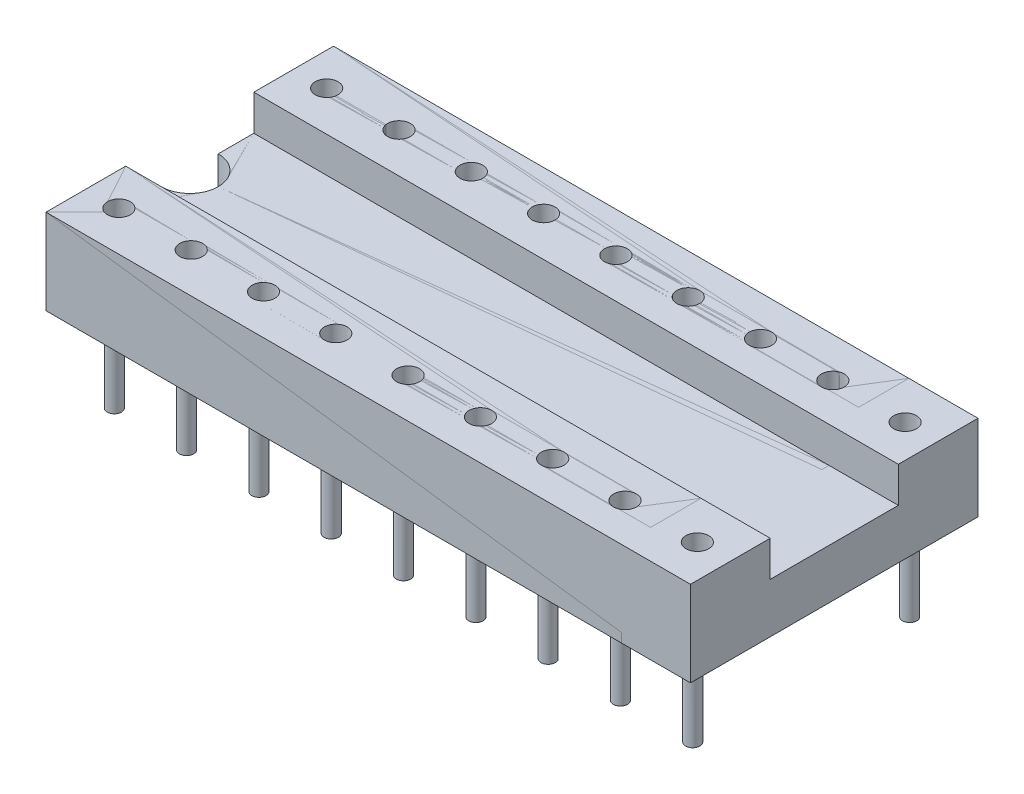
ISO-10303-21;
HEADER;
FILE_DESCRIPTION(('STEP AP214'),'2;1');
FILE_NAME('part.step','',(''),(''),'','','');
FILE_SCHEMA(('AUTOMOTIVE_DESIGN { 1 0 10303 214 1 1 1 1 }'));
ENDSEC;
DATA;
#1=APPLICATION_CONTEXT('core data for automotive mechanical design processes');
#2=APPLICATION_PROTOCOL_DEFINITION('international standard','automotive_design',2000,#1);
#3=PRODUCT_CONTEXT('',#1,'mechanical');
#4=PRODUCT('Part','Part','',(#3));
#5=PRODUCT_RELATED_PRODUCT_CATEGORY('part','',(#4));
#6=PRODUCT_DEFINITION_FORMATION('','',#4);
#7=PRODUCT_DEFINITION_CONTEXT('part definition',#1,'design');
#8=PRODUCT_DEFINITION('design','',#6,#7);
#9=PRODUCT_DEFINITION_SHAPE('','',#8);
#10=(LENGTH_UNIT() NAMED_UNIT(*) SI_UNIT(.MILLI.,.METRE.));
#11=(NAMED_UNIT(*) PLANE_ANGLE_UNIT() SI_UNIT($,.RADIAN.));
#12=(NAMED_UNIT(*) SI_UNIT($,.STERADIAN.) SOLID_ANGLE_UNIT());
#13=UNCERTAINTY_MEASURE_WITH_UNIT(LENGTH_MEASURE(1.E-05),#10,'distance_accuracy_value','');
#14=(GEOMETRIC_REPRESENTATION_CONTEXT(3) GLOBAL_UNCERTAINTY_ASSIGNED_CONTEXT((#13)) GLOBAL_UNIT_ASSIGNED_CONTEXT((#10,
#11,#12)) REPRESENTATION_CONTEXT('',''));
#15=CARTESIAN_POINT('',(0.,0.,0.));
#16=DIRECTION('',(0.,0.,1.));
#17=DIRECTION('',(1.,0.,0.));
#18=AXIS2_PLACEMENT_3D('',#15,#16,#17);
#19=CARTESIAN_POINT('',(22.64,0.,5.05));
#20=DIRECTION('',(0.,1.,0.));
#21=DIRECTION('',(0.,0.,1.));
#22=AXIS2_PLACEMENT_3D('',#19,#20,#21);
#23=PLANE('',#22);
#24=CARTESIAN_POINT('',(18.94,0.,3.81));
#25=DIRECTION('',(0.,1.,0.));
#26=DIRECTION('',(0.,0.,1.));
#27=AXIS2_PLACEMENT_3D('',#24,#25,#26);
#28=CIRCLE('',#27,0.25);
#29=CARTESIAN_POINT('',(18.94,0.,4.06));
#30=VERTEX_POINT('',#29);
#31=EDGE_CURVE('P0_E182',#30,#30,#28,.F.);
#32=ORIENTED_EDGE('',*,*,#31,.F.);
#33=EDGE_LOOP('',(#32));
#34=FACE_BOUND('',#33,.T.);
#35=CARTESIAN_POINT('',(16.4,0.,3.81));
#36=DIRECTION('',(0.,1.,0.));
#37=DIRECTION('',(0.,0.,1.));
#38=AXIS2_PLACEMENT_3D('',#35,#36,#37);
#39=CIRCLE('',#38,0.25);
#40=CARTESIAN_POINT('',(16.4,0.,4.06));
#41=VERTEX_POINT('',#40);
#42=EDGE_CURVE('P0_E176',#41,#41,#39,.F.);
#43=ORIENTED_EDGE('',*,*,#42,.F.);
#44=EDGE_LOOP('',(#43));
#45=FACE_BOUND('',#44,.T.);
#46=CARTESIAN_POINT('',(13.86,0.,3.81));
#47=DIRECTION('',(0.,1.,0.));
#48=DIRECTION('',(0.,0.,1.));
#49=AXIS2_PLACEMENT_3D('',#46,#47,#48);
#50=CIRCLE('',#49,0.25);
#51=CARTESIAN_POINT('',(13.86,0.,4.06));
#52=VERTEX_POINT('',#51);
#53=EDGE_CURVE('P0_E170',#52,#52,#50,.F.);
#54=ORIENTED_EDGE('',*,*,#53,.F.);
#55=EDGE_LOOP('',(#54));
#56=FACE_BOUND('',#55,.T.);
#57=CARTESIAN_POINT('',(11.32,0.,3.81));
#58=DIRECTION('',(0.,1.,0.));
#59=DIRECTION('',(0.,0.,1.));
#60=AXIS2_PLACEMENT_3D('',#57,#58,#59);
#61=CIRCLE('',#60,0.25);
#62=CARTESIAN_POINT('',(11.32,0.,4.06));
#63=VERTEX_POINT('',#62);
#64=EDGE_CURVE('P0_E164',#63,#63,#61,.F.);
#65=ORIENTED_EDGE('',*,*,#64,.F.);
#66=EDGE_LOOP('',(#65));
#67=FACE_BOUND('',#66,.T.);
#68=CARTESIAN_POINT('',(8.78,0.,3.81));
#69=DIRECTION('',(0.,1.,0.));
#70=DIRECTION('',(0.,0.,1.));
#71=AXIS2_PLACEMENT_3D('',#68,#69,#70);
#72=CIRCLE('',#71,0.25);
#73=CARTESIAN_POINT('',(8.78,0.,4.06));
#74=VERTEX_POINT('',#73);
#75=EDGE_CURVE('P0_E158',#74,#74,#72,.F.);
#76=ORIENTED_EDGE('',*,*,#75,.F.);
#77=EDGE_LOOP('',(#76));
#78=FACE_BOUND('',#77,.T.);
#79=CARTESIAN_POINT('',(6.24,0.,3.81));
#80=DIRECTION('',(0.,1.,0.));
#81=DIRECTION('',(0.,0.,1.));
#82=AXIS2_PLACEMENT_3D('',#79,#80,#81);
#83=CIRCLE('',#82,0.25);
#84=CARTESIAN_POINT('',(6.24,0.,4.06));
#85=VERTEX_POINT('',#84);
#86=EDGE_CURVE('P0_E152',#85,#85,#83,.F.);
#87=ORIENTED_EDGE('',*,*,#86,.F.);
#88=EDGE_LOOP('',(#87));
#89=FACE_BOUND('',#88,.T.);
#90=CARTESIAN_POINT('',(3.7,0.,3.81));
#91=DIRECTION('',(0.,1.,0.));
#92=DIRECTION('',(0.,0.,1.));
#93=AXIS2_PLACEMENT_3D('',#90,#91,#92);
#94=CIRCLE('',#93,0.25);
#95=CARTESIAN_POINT('',(3.7,0.,4.06));
#96=VERTEX_POINT('',#95);
#97=EDGE_CURVE('P0_E146',#96,#96,#94,.F.);
#98=ORIENTED_EDGE('',*,*,#97,.F.);
#99=EDGE_LOOP('',(#98));
#100=FACE_BOUND('',#99,.T.);
#101=CARTESIAN_POINT('',(1.16,0.,3.81));
#102=DIRECTION('',(0.,1.,0.));
#103=DIRECTION('',(0.,0.,1.));
#104=AXIS2_PLACEMENT_3D('',#101,#102,#103);
#105=CIRCLE('',#104,0.25);
#106=CARTESIAN_POINT('',(1.16,0.,4.06));
#107=VERTEX_POINT('',#106);
#108=EDGE_CURVE('P0_E140',#107,#107,#105,.F.);
#109=ORIENTED_EDGE('',*,*,#108,.F.);
#110=EDGE_LOOP('',(#109));
#111=FACE_BOUND('',#110,.T.);
#112=DIRECTION('',(-1.,0.,0.));
#113=VECTOR('',#112,1.);
#114=CARTESIAN_POINT('',(22.64,0.,-5.05));
#115=LINE('',#114,#113);
#116=CARTESIAN_POINT('',(20.21,0.,-5.05));
#117=VERTEX_POINT('',#116);
#118=CARTESIAN_POINT('',(0.,0.,-5.05));
#119=VERTEX_POINT('',#118);
#120=EDGE_CURVE('P0_E125',#117,#119,#115,.T.);
#121=ORIENTED_EDGE('',*,*,#120,.F.);
#122=DIRECTION('',(0.,0.,1.));
#123=VECTOR('',#122,1.);
#124=CARTESIAN_POINT('',(20.21,0.,5.05));
#125=LINE('',#124,#123);
#126=CARTESIAN_POINT('',(20.21,0.,5.05));
#127=VERTEX_POINT('',#126);
#128=EDGE_CURVE('P0_E105',#117,#127,#125,.T.);
#129=ORIENTED_EDGE('',*,*,#128,.T.);
#130=DIRECTION('',(-1.,0.,0.));
#131=VECTOR('',#130,1.);
#132=CARTESIAN_POINT('',(22.64,0.,5.05));
#133=LINE('',#132,#131);
#134=CARTESIAN_POINT('',(0.,0.,5.05));
#135=VERTEX_POINT('',#134);
#136=EDGE_CURVE('P0_E127',#127,#135,#133,.T.);
#137=ORIENTED_EDGE('',*,*,#136,.T.);
#138=DIRECTION('',(0.,0.,-1.));
#139=VECTOR('',#138,1.);
#140=CARTESIAN_POINT('',(0.,0.,5.05));
#141=LINE('',#140,#139);
#142=CARTESIAN_POINT('',(0.,0.,1.));
#143=VERTEX_POINT('',#142);
#144=EDGE_CURVE('P0_E401',#135,#143,#141,.T.);
#145=ORIENTED_EDGE('',*,*,#144,.T.);
#146=CARTESIAN_POINT('',(0.,0.,0.));
#147=DIRECTION('',(0.,1.,0.));
#148=DIRECTION('',(0.,0.,1.));
#149=AXIS2_PLACEMENT_3D('',#146,#147,#148);
#150=CIRCLE('',#149,1.);
#151=CARTESIAN_POINT('',(0.,0.,-1.));
#152=VERTEX_POINT('',#151);
#153=EDGE_CURVE('P0_E50',#143,#152,#150,.T.);
#154=ORIENTED_EDGE('',*,*,#153,.T.);
#155=EDGE_CURVE('P0_E400',#152,#119,#141,.T.);
#156=ORIENTED_EDGE('',*,*,#155,.T.);
#157=EDGE_LOOP('',(#121,#129,#137,#145,#154,#156));
#158=FACE_BOUND('',#157,.T.);
#159=CARTESIAN_POINT('',(1.16,0.,-3.81));
#160=DIRECTION('',(0.,1.,0.));
#161=DIRECTION('',(0.,0.,1.));
#162=AXIS2_PLACEMENT_3D('',#159,#160,#161);
#163=CIRCLE('',#162,0.25);
#164=CARTESIAN_POINT('',(1.16,0.,-3.56));
#165=VERTEX_POINT('',#164);
#166=EDGE_CURVE('P0_E143',#165,#165,#163,.F.);
#167=ORIENTED_EDGE('',*,*,#166,.F.);
#168=EDGE_LOOP('',(#167));
#169=FACE_BOUND('',#168,.T.);
#170=CARTESIAN_POINT('',(3.7,0.,-3.81));
#171=DIRECTION('',(0.,1.,0.));
#172=DIRECTION('',(0.,0.,1.));
#173=AXIS2_PLACEMENT_3D('',#170,#171,#172);
#174=CIRCLE('',#173,0.25);
#175=CARTESIAN_POINT('',(3.7,0.,-3.56));
#176=VERTEX_POINT('',#175);
#177=EDGE_CURVE('P0_E149',#176,#176,#174,.F.);
#178=ORIENTED_EDGE('',*,*,#177,.F.);
#179=EDGE_LOOP('',(#178));
#180=FACE_BOUND('',#179,.T.);
#181=CARTESIAN_POINT('',(6.24,0.,-3.81));
#182=DIRECTION('',(0.,1.,0.));
#183=DIRECTION('',(0.,0.,1.));
#184=AXIS2_PLACEMENT_3D('',#181,#182,#183);
#185=CIRCLE('',#184,0.25);
#186=CARTESIAN_POINT('',(6.24,0.,-3.56));
#187=VERTEX_POINT('',#186);
#188=EDGE_CURVE('P0_E155',#187,#187,#185,.F.);
#189=ORIENTED_EDGE('',*,*,#188,.F.);
#190=EDGE_LOOP('',(#189));
#191=FACE_BOUND('',#190,.T.);
#192=CARTESIAN_POINT('',(8.78,0.,-3.81));
#193=DIRECTION('',(0.,1.,0.));
#194=DIRECTION('',(0.,0.,1.));
#195=AXIS2_PLACEMENT_3D('',#192,#193,#194);
#196=CIRCLE('',#195,0.25);
#197=CARTESIAN_POINT('',(8.78,0.,-3.56));
#198=VERTEX_POINT('',#197);
#199=EDGE_CURVE('P0_E161',#198,#198,#196,.F.);
#200=ORIENTED_EDGE('',*,*,#199,.F.);
#201=EDGE_LOOP('',(#200));
#202=FACE_BOUND('',#201,.T.);
#203=CARTESIAN_POINT('',(11.32,0.,-3.81));
#204=DIRECTION('',(0.,1.,0.));
#205=DIRECTION('',(0.,0.,1.));
#206=AXIS2_PLACEMENT_3D('',#203,#204,#205);
#207=CIRCLE('',#206,0.25);
#208=CARTESIAN_POINT('',(11.32,0.,-3.56));
#209=VERTEX_POINT('',#208);
#210=EDGE_CURVE('P0_E167',#209,#209,#207,.F.);
#211=ORIENTED_EDGE('',*,*,#210,.F.);
#212=EDGE_LOOP('',(#211));
#213=FACE_BOUND('',#212,.T.);
#214=CARTESIAN_POINT('',(13.86,0.,-3.81));
#215=DIRECTION('',(0.,1.,0.));
#216=DIRECTION('',(0.,0.,1.));
#217=AXIS2_PLACEMENT_3D('',#214,#215,#216);
#218=CIRCLE('',#217,0.25);
#219=CARTESIAN_POINT('',(13.86,0.,-3.56));
#220=VERTEX_POINT('',#219);
#221=EDGE_CURVE('P0_E173',#220,#220,#218,.F.);
#222=ORIENTED_EDGE('',*,*,#221,.F.);
#223=EDGE_LOOP('',(#222));
#224=FACE_BOUND('',#223,.T.);
#225=CARTESIAN_POINT('',(16.4,0.,-3.81));
#226=DIRECTION('',(0.,1.,0.));
#227=DIRECTION('',(0.,0.,1.));
#228=AXIS2_PLACEMENT_3D('',#225,#226,#227);
#229=CIRCLE('',#228,0.25);
#230=CARTESIAN_POINT('',(16.4,0.,-3.56));
#231=VERTEX_POINT('',#230);
#232=EDGE_CURVE('P0_E179',#231,#231,#229,.F.);
#233=ORIENTED_EDGE('',*,*,#232,.F.);
#234=EDGE_LOOP('',(#233));
#235=FACE_BOUND('',#234,.T.);
#236=CARTESIAN_POINT('',(18.94,0.,-3.81));
#237=DIRECTION('',(0.,1.,0.));
#238=DIRECTION('',(0.,0.,1.));
#239=AXIS2_PLACEMENT_3D('',#236,#237,#238);
#240=CIRCLE('',#239,0.25);
#241=CARTESIAN_POINT('',(18.94,0.,-3.56));
#242=VERTEX_POINT('',#241);
#243=EDGE_CURVE('P0_E36',#242,#242,#240,.F.);
#244=ORIENTED_EDGE('',*,*,#243,.F.);
#245=EDGE_LOOP('',(#244));
#246=FACE_BOUND('',#245,.T.);
#247=ADVANCED_FACE('P0_F28',(#34,#45,#56,#67,#78,#89,#100,#111,#158,#169,#180,#191,#202,#213,
#224,#235,#246),#23,.F.);
#248=CARTESIAN_POINT('',(0.,1.75,5.05));
#249=DIRECTION('',(1.,0.,0.));
#250=DIRECTION('',(0.,0.,-1.));
#251=AXIS2_PLACEMENT_3D('',#248,#249,#250);
#252=PLANE('',#251);
#253=ORIENTED_EDGE('',*,*,#155,.F.);
#254=DIRECTION('',(0.,1.,0.));
#255=VECTOR('',#254,1.);
#256=CARTESIAN_POINT('',(0.,0.,-1.));
#257=LINE('',#256,#255);
#258=CARTESIAN_POINT('',(0.,1.75,-1.));
#259=VERTEX_POINT('',#258);
#260=EDGE_CURVE('P0_E386',#152,#259,#257,.T.);
#261=ORIENTED_EDGE('',*,*,#260,.T.);
#262=DIRECTION('',(0.,0.,1.));
#263=VECTOR('',#262,1.);
#264=CARTESIAN_POINT('',(0.,1.75,-2.25));
#265=LINE('',#264,#263);
#266=CARTESIAN_POINT('',(0.,1.75,-2.25));
#267=VERTEX_POINT('',#266);
#268=EDGE_CURVE('P0_E392',#267,#259,#265,.T.);
#269=ORIENTED_EDGE('',*,*,#268,.F.);
#270=DIRECTION('',(0.,-1.,0.));
#271=VECTOR('',#270,1.);
#272=CARTESIAN_POINT('',(0.,3.,-2.25));
#273=LINE('',#272,#271);
#274=CARTESIAN_POINT('',(0.,3.,-2.25));
#275=VERTEX_POINT('',#274);
#276=EDGE_CURVE('P0_E407',#275,#267,#273,.T.);
#277=ORIENTED_EDGE('',*,*,#276,.F.);
#278=DIRECTION('',(0.,0.,1.));
#279=VECTOR('',#278,1.);
#280=CARTESIAN_POINT('',(0.,3.,-5.05));
#281=LINE('',#280,#279);
#282=CARTESIAN_POINT('',(0.,3.,-5.05));
#283=VERTEX_POINT('',#282);
#284=EDGE_CURVE('P0_E405',#283,#275,#281,.T.);
#285=ORIENTED_EDGE('',*,*,#284,.F.);
#286=DIRECTION('',(0.,1.,0.));
#287=VECTOR('',#286,1.);
#288=CARTESIAN_POINT('',(0.,0.,-5.05));
#289=LINE('',#288,#287);
#290=EDGE_CURVE('P0_E123',#119,#283,#289,.T.);
#291=ORIENTED_EDGE('',*,*,#290,.F.);
#292=EDGE_LOOP('',(#253,#261,#269,#277,#285,#291));
#293=FACE_BOUND('',#292,.T.);
#294=ADVANCED_FACE('P0_F190',(#293),#252,.F.);
#295=CARTESIAN_POINT('',(22.64,1.75,-2.25));
#296=DIRECTION('',(0.,-1.,0.));
#297=DIRECTION('',(0.,0.,-1.));
#298=AXIS2_PLACEMENT_3D('',#295,#296,#297);
#299=PLANE('',#298);
#300=DIRECTION('',(-1.,0.,0.));
#301=VECTOR('',#300,1.);
#302=CARTESIAN_POINT('',(22.64,1.75,2.25));
#303=LINE('',#302,#301);
#304=CARTESIAN_POINT('',(20.21,1.75,2.25));
#305=VERTEX_POINT('',#304);
#306=CARTESIAN_POINT('',(0.,1.75,2.25));
#307=VERTEX_POINT('',#306);
#308=EDGE_CURVE('P0_E138',#305,#307,#303,.T.);
#309=ORIENTED_EDGE('',*,*,#308,.F.);
#310=DIRECTION('',(0.,0.,-1.));
#311=VECTOR('',#310,1.);
#312=CARTESIAN_POINT('',(20.21,1.75,-2.25));
#313=LINE('',#312,#311);
#314=CARTESIAN_POINT('',(20.21,1.75,-2.25));
#315=VERTEX_POINT('',#314);
#316=EDGE_CURVE('P0_E118',#305,#315,#313,.T.);
#317=ORIENTED_EDGE('',*,*,#316,.T.);
#318=DIRECTION('',(-1.,0.,0.));
#319=VECTOR('',#318,1.);
#320=CARTESIAN_POINT('',(22.64,1.75,-2.25));
#321=LINE('',#320,#319);
#322=EDGE_CURVE('P0_E129',#315,#267,#321,.T.);
#323=ORIENTED_EDGE('',*,*,#322,.T.);
#324=ORIENTED_EDGE('',*,*,#268,.T.);
#325=CARTESIAN_POINT('',(0.,1.75,0.));
#326=DIRECTION('',(0.,1.,0.));
#327=DIRECTION('',(0.,0.,1.));
#328=AXIS2_PLACEMENT_3D('',#325,#326,#327);
#329=CIRCLE('',#328,1.);
#330=CARTESIAN_POINT('',(0.,1.75,1.));
#331=VERTEX_POINT('',#330);
#332=EDGE_CURVE('P0_E383',#331,#259,#329,.T.);
#333=ORIENTED_EDGE('',*,*,#332,.F.);
#334=EDGE_CURVE('P0_E389',#331,#307,#265,.T.);
#335=ORIENTED_EDGE('',*,*,#334,.T.);
#336=EDGE_LOOP('',(#309,#317,#323,#324,#333,#335));
#337=FACE_BOUND('',#336,.T.);
#338=ADVANCED_FACE('P0_F30',(#337),#299,.F.);
#339=CARTESIAN_POINT('',(22.64,1.75,2.25));
#340=DIRECTION('',(0.,0.,1.));
#341=DIRECTION('',(0.,-1.,0.));
#342=AXIS2_PLACEMENT_3D('',#339,#340,#341);
#343=PLANE('',#342);
#344=DIRECTION('',(-1.,0.,0.));
#345=VECTOR('',#344,1.);
#346=CARTESIAN_POINT('',(22.64,3.,2.25));
#347=LINE('',#346,#345);
#348=CARTESIAN_POINT('',(20.21,3.,2.25));
#349=VERTEX_POINT('',#348);
#350=CARTESIAN_POINT('',(0.,3.,2.25));
#351=VERTEX_POINT('',#350);
#352=EDGE_CURVE('P0_E136',#349,#351,#347,.T.);
#353=ORIENTED_EDGE('',*,*,#352,.F.);
#354=DIRECTION('',(0.,-1.,0.));
#355=VECTOR('',#354,1.);
#356=CARTESIAN_POINT('',(20.21,1.75,2.25));
#357=LINE('',#356,#355);
#358=EDGE_CURVE('P0_E109',#349,#305,#357,.T.);
#359=ORIENTED_EDGE('',*,*,#358,.T.);
#360=ORIENTED_EDGE('',*,*,#308,.T.);
#361=DIRECTION('',(0.,1.,0.));
#362=VECTOR('',#361,1.);
#363=CARTESIAN_POINT('',(0.,1.75,2.25));
#364=LINE('',#363,#362);
#365=EDGE_CURVE('P0_E223',#307,#351,#364,.T.);
#366=ORIENTED_EDGE('',*,*,#365,.T.);
#367=EDGE_LOOP('',(#353,#359,#360,#366));
#368=FACE_BOUND('',#367,.T.);
#369=ADVANCED_FACE('P0_F211',(#368),#343,.F.);
#370=CARTESIAN_POINT('',(22.64,3.,2.25));
#371=DIRECTION('',(0.,-1.,0.));
#372=DIRECTION('',(0.,0.,-1.));
#373=AXIS2_PLACEMENT_3D('',#370,#371,#372);
#374=PLANE('',#373);
#375=CARTESIAN_POINT('',(18.94,3.,3.64999999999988));
#376=DIRECTION('',(0.,1.,0.));
#377=DIRECTION('',(0.,0.,1.));
#378=AXIS2_PLACEMENT_3D('',#375,#376,#377);
#379=CIRCLE('',#378,0.4);
#380=CARTESIAN_POINT('',(18.94,3.,4.04999999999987));
#381=VERTEX_POINT('',#380);
#382=EDGE_CURVE('P0_E293',#381,#381,#379,.T.);
#383=ORIENTED_EDGE('',*,*,#382,.F.);
#384=EDGE_LOOP('',(#383));
#385=FACE_BOUND('',#384,.T.);
#386=CARTESIAN_POINT('',(16.4,3.,3.6499999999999));
#387=DIRECTION('',(0.,1.,0.));
#388=DIRECTION('',(0.,0.,1.));
#389=AXIS2_PLACEMENT_3D('',#386,#387,#388);
#390=CIRCLE('',#389,0.4);
#391=CARTESIAN_POINT('',(16.4,3.,4.0499999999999));
#392=VERTEX_POINT('',#391);
#393=EDGE_CURVE('P0_E305',#392,#392,#390,.T.);
#394=ORIENTED_EDGE('',*,*,#393,.F.);
#395=EDGE_LOOP('',(#394));
#396=FACE_BOUND('',#395,.T.);
#397=CARTESIAN_POINT('',(13.86,3.,3.64999999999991));
#398=DIRECTION('',(0.,1.,0.));
#399=DIRECTION('',(0.,0.,1.));
#400=AXIS2_PLACEMENT_3D('',#397,#398,#399);
#401=CIRCLE('',#400,0.4);
#402=CARTESIAN_POINT('',(13.86,3.,4.04999999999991));
#403=VERTEX_POINT('',#402);
#404=EDGE_CURVE('P0_E317',#403,#403,#401,.T.);
#405=ORIENTED_EDGE('',*,*,#404,.F.);
#406=EDGE_LOOP('',(#405));
#407=FACE_BOUND('',#406,.T.);
#408=CARTESIAN_POINT('',(11.32,3.,3.64999999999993));
#409=DIRECTION('',(0.,1.,0.));
#410=DIRECTION('',(0.,0.,1.));
#411=AXIS2_PLACEMENT_3D('',#408,#409,#410);
#412=CIRCLE('',#411,0.4);
#413=CARTESIAN_POINT('',(11.32,3.,4.04999999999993));
#414=VERTEX_POINT('',#413);
#415=EDGE_CURVE('P0_E329',#414,#414,#412,.T.);
#416=ORIENTED_EDGE('',*,*,#415,.F.);
#417=EDGE_LOOP('',(#416));
#418=FACE_BOUND('',#417,.T.);
#419=CARTESIAN_POINT('',(8.78,3.,3.64999999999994));
#420=DIRECTION('',(0.,1.,0.));
#421=DIRECTION('',(0.,0.,1.));
#422=AXIS2_PLACEMENT_3D('',#419,#420,#421);
#423=CIRCLE('',#422,0.4);
#424=CARTESIAN_POINT('',(8.78,3.,4.04999999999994));
#425=VERTEX_POINT('',#424);
#426=EDGE_CURVE('P0_E341',#425,#425,#423,.T.);
#427=ORIENTED_EDGE('',*,*,#426,.F.);
#428=EDGE_LOOP('',(#427));
#429=FACE_BOUND('',#428,.T.);
#430=CARTESIAN_POINT('',(6.24,3.,3.65));
#431=DIRECTION('',(0.,1.,0.));
#432=DIRECTION('',(0.,0.,1.));
#433=AXIS2_PLACEMENT_3D('',#430,#431,#432);
#434=CIRCLE('',#433,0.4);
#435=CARTESIAN_POINT('',(6.24,3.,4.05));
#436=VERTEX_POINT('',#435);
#437=EDGE_CURVE('P0_E353',#436,#436,#434,.T.);
#438=ORIENTED_EDGE('',*,*,#437,.F.);
#439=EDGE_LOOP('',(#438));
#440=FACE_BOUND('',#439,.T.);
#441=CARTESIAN_POINT('',(3.7,3.,3.65));
#442=DIRECTION('',(0.,1.,0.));
#443=DIRECTION('',(0.,0.,1.));
#444=AXIS2_PLACEMENT_3D('',#441,#442,#443);
#445=CIRCLE('',#444,0.4);
#446=CARTESIAN_POINT('',(3.7,3.,4.05));
#447=VERTEX_POINT('',#446);
#448=EDGE_CURVE('P0_E365',#447,#447,#445,.T.);
#449=ORIENTED_EDGE('',*,*,#448,.F.);
#450=EDGE_LOOP('',(#449));
#451=FACE_BOUND('',#450,.T.);
#452=CARTESIAN_POINT('',(1.16,3.,3.65));
#453=DIRECTION('',(0.,1.,0.));
#454=DIRECTION('',(0.,0.,1.));
#455=AXIS2_PLACEMENT_3D('',#452,#453,#454);
#456=CIRCLE('',#455,0.4);
#457=CARTESIAN_POINT('',(1.16,3.,4.05));
#458=VERTEX_POINT('',#457);
#459=EDGE_CURVE('P0_E377',#458,#458,#456,.T.);
#460=ORIENTED_EDGE('',*,*,#459,.F.);
#461=EDGE_LOOP('',(#460));
#462=FACE_BOUND('',#461,.T.);
#463=DIRECTION('',(-1.,0.,0.));
#464=VECTOR('',#463,1.);
#465=CARTESIAN_POINT('',(22.64,3.,5.05));
#466=LINE('',#465,#464);
#467=CARTESIAN_POINT('',(20.21,3.,5.05));
#468=VERTEX_POINT('',#467);
#469=CARTESIAN_POINT('',(0.,3.,5.05));
#470=VERTEX_POINT('',#469);
#471=EDGE_CURVE('P0_E134',#468,#470,#466,.T.);
#472=ORIENTED_EDGE('',*,*,#471,.F.);
#473=DIRECTION('',(0.,0.,1.));
#474=VECTOR('',#473,1.);
#475=CARTESIAN_POINT('',(20.21,3.,-6.82218666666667));
#476=LINE('',#475,#474);
#477=EDGE_CURVE('P0_E119',#349,#468,#476,.T.);
#478=ORIENTED_EDGE('',*,*,#477,.F.);
#479=ORIENTED_EDGE('',*,*,#352,.T.);
#480=DIRECTION('',(0.,0.,1.));
#481=VECTOR('',#480,1.);
#482=CARTESIAN_POINT('',(0.,3.,2.25));
#483=LINE('',#482,#481);
#484=EDGE_CURVE('P0_E229',#351,#470,#483,.T.);
#485=ORIENTED_EDGE('',*,*,#484,.T.);
#486=EDGE_LOOP('',(#472,#478,#479,#485));
#487=FACE_BOUND('',#486,.T.);
#488=ADVANCED_FACE('P0_F208',(#385,#396,#407,#418,#429,#440,#451,#462,#487),#374,.F.);
#489=CARTESIAN_POINT('',(22.64,3.,5.05));
#490=DIRECTION('',(0.,0.,-1.));
#491=DIRECTION('',(-1.,0.,0.));
#492=AXIS2_PLACEMENT_3D('',#489,#490,#491);
#493=PLANE('',#492);
#494=ORIENTED_EDGE('',*,*,#136,.F.);
#495=DIRECTION('',(0.,1.,0.));
#496=VECTOR('',#495,1.);
#497=CARTESIAN_POINT('',(20.21,3.,5.05));
#498=LINE('',#497,#496);
#499=EDGE_CURVE('P0_E237',#127,#468,#498,.T.);
#500=ORIENTED_EDGE('',*,*,#499,.T.);
#501=ORIENTED_EDGE('',*,*,#471,.T.);
#502=DIRECTION('',(0.,-1.,0.));
#503=VECTOR('',#502,1.);
#504=CARTESIAN_POINT('',(0.,3.,5.05));
#505=LINE('',#504,#503);
#506=EDGE_CURVE('P0_E397',#470,#135,#505,.T.);
#507=ORIENTED_EDGE('',*,*,#506,.T.);
#508=EDGE_LOOP('',(#494,#500,#501,#507));
#509=FACE_BOUND('',#508,.T.);
#510=ADVANCED_FACE('P0_F205',(#509),#493,.F.);
#511=CARTESIAN_POINT('',(22.64,0.,-5.05));
#512=DIRECTION('',(0.,0.,1.));
#513=DIRECTION('',(0.,-1.,0.));
#514=AXIS2_PLACEMENT_3D('',#511,#512,#513);
#515=PLANE('',#514);
#516=DIRECTION('',(-1.,0.,0.));
#517=VECTOR('',#516,1.);
#518=CARTESIAN_POINT('',(22.64,3.,-5.05));
#519=LINE('',#518,#517);
#520=CARTESIAN_POINT('',(20.21,3.,-5.05));
#521=VERTEX_POINT('',#520);
#522=EDGE_CURVE('P0_E115',#521,#283,#519,.T.);
#523=ORIENTED_EDGE('',*,*,#522,.F.);
#524=DIRECTION('',(0.,-1.,0.));
#525=VECTOR('',#524,1.);
#526=CARTESIAN_POINT('',(20.21,0.,-5.05));
#527=LINE('',#526,#525);
#528=EDGE_CURVE('P0_E102',#521,#117,#527,.T.);
#529=ORIENTED_EDGE('',*,*,#528,.T.);
#530=ORIENTED_EDGE('',*,*,#120,.T.);
#531=ORIENTED_EDGE('',*,*,#290,.T.);
#532=EDGE_LOOP('',(#523,#529,#530,#531));
#533=FACE_BOUND('',#532,.T.);
#534=ADVANCED_FACE('P0_F121',(#533),#515,.F.);
#535=CARTESIAN_POINT('',(22.64,3.,-5.05));
#536=DIRECTION('',(0.,-1.,0.));
#537=DIRECTION('',(0.,0.,-1.));
#538=AXIS2_PLACEMENT_3D('',#535,#536,#537);
#539=PLANE('',#538);
#540=CARTESIAN_POINT('',(18.94,3.,-3.65000000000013));
#541=DIRECTION('',(0.,1.,0.));
#542=DIRECTION('',(0.,0.,-1.));
#543=AXIS2_PLACEMENT_3D('',#540,#541,#542);
#544=CIRCLE('',#543,0.4);
#545=CARTESIAN_POINT('',(18.94,3.,-4.05000000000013));
#546=VERTEX_POINT('',#545);
#547=EDGE_CURVE('P0_E287',#546,#546,#544,.T.);
#548=ORIENTED_EDGE('',*,*,#547,.F.);
#549=EDGE_LOOP('',(#548));
#550=FACE_BOUND('',#549,.T.);
#551=CARTESIAN_POINT('',(16.4,3.,-3.65000000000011));
#552=DIRECTION('',(0.,1.,0.));
#553=DIRECTION('',(0.,0.,-1.));
#554=AXIS2_PLACEMENT_3D('',#551,#552,#553);
#555=CIRCLE('',#554,0.4);
#556=CARTESIAN_POINT('',(16.4,3.,-4.0500000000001));
#557=VERTEX_POINT('',#556);
#558=EDGE_CURVE('P0_E299',#557,#557,#555,.T.);
#559=ORIENTED_EDGE('',*,*,#558,.F.);
#560=EDGE_LOOP('',(#559));
#561=FACE_BOUND('',#560,.T.);
#562=CARTESIAN_POINT('',(13.86,3.,-3.65000000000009));
#563=DIRECTION('',(0.,1.,0.));
#564=DIRECTION('',(0.,0.,-1.));
#565=AXIS2_PLACEMENT_3D('',#562,#563,#564);
#566=CIRCLE('',#565,0.4);
#567=CARTESIAN_POINT('',(13.86,3.,-4.05000000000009));
#568=VERTEX_POINT('',#567);
#569=EDGE_CURVE('P0_E311',#568,#568,#566,.T.);
#570=ORIENTED_EDGE('',*,*,#569,.F.);
#571=EDGE_LOOP('',(#570));
#572=FACE_BOUND('',#571,.T.);
#573=CARTESIAN_POINT('',(11.32,3.,-3.65000000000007));
#574=DIRECTION('',(0.,1.,0.));
#575=DIRECTION('',(0.,0.,-1.));
#576=AXIS2_PLACEMENT_3D('',#573,#574,#575);
#577=CIRCLE('',#576,0.4);
#578=CARTESIAN_POINT('',(11.32,3.,-4.05000000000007));
#579=VERTEX_POINT('',#578);
#580=EDGE_CURVE('P0_E323',#579,#579,#577,.T.);
#581=ORIENTED_EDGE('',*,*,#580,.F.);
#582=EDGE_LOOP('',(#581));
#583=FACE_BOUND('',#582,.T.);
#584=CARTESIAN_POINT('',(8.78,3.,-3.65000000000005));
#585=DIRECTION('',(0.,1.,0.));
#586=DIRECTION('',(0.,0.,-1.));
#587=AXIS2_PLACEMENT_3D('',#584,#585,#586);
#588=CIRCLE('',#587,0.4);
#589=CARTESIAN_POINT('',(8.78,3.,-4.05000000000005));
#590=VERTEX_POINT('',#589);
#591=EDGE_CURVE('P0_E335',#590,#590,#588,.T.);
#592=ORIENTED_EDGE('',*,*,#591,.F.);
#593=EDGE_LOOP('',(#592));
#594=FACE_BOUND('',#593,.T.);
#595=CARTESIAN_POINT('',(6.24,3.,-3.65));
#596=DIRECTION('',(0.,1.,0.));
#597=DIRECTION('',(0.,0.,-1.));
#598=AXIS2_PLACEMENT_3D('',#595,#596,#597);
#599=CIRCLE('',#598,0.4);
#600=CARTESIAN_POINT('',(6.24,3.,-4.05));
#601=VERTEX_POINT('',#600);
#602=EDGE_CURVE('P0_E347',#601,#601,#599,.T.);
#603=ORIENTED_EDGE('',*,*,#602,.F.);
#604=EDGE_LOOP('',(#603));
#605=FACE_BOUND('',#604,.T.);
#606=CARTESIAN_POINT('',(3.7,3.,-3.65));
#607=DIRECTION('',(0.,1.,0.));
#608=DIRECTION('',(0.,0.,-1.));
#609=AXIS2_PLACEMENT_3D('',#606,#607,#608);
#610=CIRCLE('',#609,0.4);
#611=CARTESIAN_POINT('',(3.7,3.,-4.05));
#612=VERTEX_POINT('',#611);
#613=EDGE_CURVE('P0_E359',#612,#612,#610,.T.);
#614=ORIENTED_EDGE('',*,*,#613,.F.);
#615=EDGE_LOOP('',(#614));
#616=FACE_BOUND('',#615,.T.);
#617=CARTESIAN_POINT('',(1.16,3.,-3.65));
#618=DIRECTION('',(0.,1.,0.));
#619=DIRECTION('',(0.,0.,-1.));
#620=AXIS2_PLACEMENT_3D('',#617,#618,#619);
#621=CIRCLE('',#620,0.4);
#622=CARTESIAN_POINT('',(1.16,3.,-4.05));
#623=VERTEX_POINT('',#622);
#624=EDGE_CURVE('P0_E371',#623,#623,#621,.T.);
#625=ORIENTED_EDGE('',*,*,#624,.F.);
#626=EDGE_LOOP('',(#625));
#627=FACE_BOUND('',#626,.T.);
#628=DIRECTION('',(-1.,0.,0.));
#629=VECTOR('',#628,1.);
#630=CARTESIAN_POINT('',(22.64,3.,-2.25));
#631=LINE('',#630,#629);
#632=CARTESIAN_POINT('',(20.21,3.,-2.25));
#633=VERTEX_POINT('',#632);
#634=EDGE_CURVE('P0_E117',#633,#275,#631,.T.);
#635=ORIENTED_EDGE('',*,*,#634,.F.);
#636=EDGE_CURVE('P0_E43',#521,#633,#476,.T.);
#637=ORIENTED_EDGE('',*,*,#636,.F.);
#638=ORIENTED_EDGE('',*,*,#522,.T.);
#639=ORIENTED_EDGE('',*,*,#284,.T.);
#640=EDGE_LOOP('',(#635,#637,#638,#639));
#641=FACE_BOUND('',#640,.T.);
#642=ADVANCED_FACE('P0_F113',(#550,#561,#572,#583,#594,#605,#616,#627,#641),#539,.F.);
#643=CARTESIAN_POINT('',(22.64,3.,-2.25));
#644=DIRECTION('',(0.,0.,-1.));
#645=DIRECTION('',(0.,1.,0.));
#646=AXIS2_PLACEMENT_3D('',#643,#644,#645);
#647=PLANE('',#646);
#648=ORIENTED_EDGE('',*,*,#322,.F.);
#649=DIRECTION('',(0.,1.,0.));
#650=VECTOR('',#649,1.);
#651=CARTESIAN_POINT('',(20.21,3.,-2.25));
#652=LINE('',#651,#650);
#653=EDGE_CURVE('P0_E11',#315,#633,#652,.T.);
#654=ORIENTED_EDGE('',*,*,#653,.T.);
#655=ORIENTED_EDGE('',*,*,#634,.T.);
#656=ORIENTED_EDGE('',*,*,#276,.T.);
#657=EDGE_LOOP('',(#648,#654,#655,#656));
#658=FACE_BOUND('',#657,.T.);
#659=ADVANCED_FACE('P0_F414',(#658),#647,.F.);
#660=ORIENTED_EDGE('',*,*,#334,.F.);
#661=DIRECTION('',(0.,1.,0.));
#662=VECTOR('',#661,1.);
#663=CARTESIAN_POINT('',(0.,0.,1.));
#664=LINE('',#663,#662);
#665=EDGE_CURVE('P0_E387',#143,#331,#664,.T.);
#666=ORIENTED_EDGE('',*,*,#665,.F.);
#667=ORIENTED_EDGE('',*,*,#144,.F.);
#668=ORIENTED_EDGE('',*,*,#506,.F.);
#669=ORIENTED_EDGE('',*,*,#484,.F.);
#670=ORIENTED_EDGE('',*,*,#365,.F.);
#671=EDGE_LOOP('',(#660,#666,#667,#668,#669,#670));
#672=FACE_BOUND('',#671,.T.);
#673=ADVANCED_FACE('P0_F199',(#672),#252,.F.);
#674=CARTESIAN_POINT('',(0.,0.,0.));
#675=DIRECTION('',(0.,1.,0.));
#676=DIRECTION('',(0.,0.,1.));
#677=AXIS2_PLACEMENT_3D('',#674,#675,#676);
#678=CYLINDRICAL_SURFACE('',#677,1.);
#679=ORIENTED_EDGE('',*,*,#332,.T.);
#680=ORIENTED_EDGE('',*,*,#260,.F.);
#681=ORIENTED_EDGE('',*,*,#153,.F.);
#682=ORIENTED_EDGE('',*,*,#665,.T.);
#683=EDGE_LOOP('',(#679,#680,#681,#682));
#684=FACE_BOUND('',#683,.T.);
#685=ADVANCED_FACE('P0_F417',(#684),#678,.F.);
#686=CARTESIAN_POINT('',(1.16,0.5,3.65));
#687=DIRECTION('',(0.,1.,0.));
#688=DIRECTION('',(0.,0.,1.));
#689=AXIS2_PLACEMENT_3D('',#686,#687,#688);
#690=CYLINDRICAL_SURFACE('',#689,0.4);
#691=CARTESIAN_POINT('',(1.16,0.5,3.65));
#692=DIRECTION('',(0.,1.,0.));
#693=DIRECTION('',(0.,0.,1.));
#694=AXIS2_PLACEMENT_3D('',#691,#692,#693);
#695=CIRCLE('',#694,0.4);
#696=CARTESIAN_POINT('',(1.16,0.5,4.05));
#697=VERTEX_POINT('',#696);
#698=EDGE_CURVE('P0_E380',#697,#697,#695,.T.);
#699=ORIENTED_EDGE('',*,*,#698,.F.);
#700=EDGE_LOOP('',(#699));
#701=FACE_BOUND('',#700,.T.);
#702=ORIENTED_EDGE('',*,*,#459,.T.);
#703=EDGE_LOOP('',(#702));
#704=FACE_BOUND('',#703,.T.);
#705=ADVANCED_FACE('P0_F429',(#701,#704),#690,.F.);
#706=CARTESIAN_POINT('',(1.16,0.5,3.65));
#707=DIRECTION('',(0.,1.,0.));
#708=DIRECTION('',(0.,0.,1.));
#709=AXIS2_PLACEMENT_3D('',#706,#707,#708);
#710=PLANE('',#709);
#711=ORIENTED_EDGE('',*,*,#698,.T.);
#712=EDGE_LOOP('',(#711));
#713=FACE_BOUND('',#712,.T.);
#714=ADVANCED_FACE('P0_F458',(#713),#710,.T.);
#715=CARTESIAN_POINT('',(1.16,0.5,-3.65));
#716=DIRECTION('',(0.,1.,0.));
#717=DIRECTION('',(0.,0.,1.));
#718=AXIS2_PLACEMENT_3D('',#715,#716,#717);
#719=CYLINDRICAL_SURFACE('',#718,0.4);
#720=CARTESIAN_POINT('',(1.16,0.5,-3.65));
#721=DIRECTION('',(0.,1.,0.));
#722=DIRECTION('',(0.,0.,-1.));
#723=AXIS2_PLACEMENT_3D('',#720,#721,#722);
#724=CIRCLE('',#723,0.4);
#725=CARTESIAN_POINT('',(1.16,0.5,-4.05));
#726=VERTEX_POINT('',#725);
#727=EDGE_CURVE('P0_E374',#726,#726,#724,.T.);
#728=ORIENTED_EDGE('',*,*,#727,.F.);
#729=EDGE_LOOP('',(#728));
#730=FACE_BOUND('',#729,.T.);
#731=ORIENTED_EDGE('',*,*,#624,.T.);
#732=EDGE_LOOP('',(#731));
#733=FACE_BOUND('',#732,.T.);
#734=ADVANCED_FACE('P0_F455',(#730,#733),#719,.F.);
#735=CARTESIAN_POINT('',(1.16,0.5,-3.65));
#736=DIRECTION('',(0.,-1.,0.));
#737=DIRECTION('',(0.,0.,-1.));
#738=AXIS2_PLACEMENT_3D('',#735,#736,#737);
#739=PLANE('',#738);
#740=ORIENTED_EDGE('',*,*,#727,.T.);
#741=EDGE_LOOP('',(#740));
#742=FACE_BOUND('',#741,.T.);
#743=ADVANCED_FACE('P0_F457',(#742),#739,.F.);
#744=CARTESIAN_POINT('',(3.7,0.5,3.65));
#745=DIRECTION('',(0.,1.,0.));
#746=DIRECTION('',(0.,0.,1.));
#747=AXIS2_PLACEMENT_3D('',#744,#745,#746);
#748=CYLINDRICAL_SURFACE('',#747,0.4);
#749=CARTESIAN_POINT('',(3.7,0.5,3.65));
#750=DIRECTION('',(0.,1.,0.));
#751=DIRECTION('',(0.,0.,1.));
#752=AXIS2_PLACEMENT_3D('',#749,#750,#751);
#753=CIRCLE('',#752,0.4);
#754=CARTESIAN_POINT('',(3.7,0.5,4.05));
#755=VERTEX_POINT('',#754);
#756=EDGE_CURVE('P0_E368',#755,#755,#753,.T.);
#757=ORIENTED_EDGE('',*,*,#756,.F.);
#758=EDGE_LOOP('',(#757));
#759=FACE_BOUND('',#758,.T.);
#760=ORIENTED_EDGE('',*,*,#448,.T.);
#761=EDGE_LOOP('',(#760));
#762=FACE_BOUND('',#761,.T.);
#763=ADVANCED_FACE('P0_F465',(#759,#762),#748,.F.);
#764=CARTESIAN_POINT('',(3.7,0.5,3.65));
#765=DIRECTION('',(0.,1.,0.));
#766=DIRECTION('',(0.,0.,1.));
#767=AXIS2_PLACEMENT_3D('',#764,#765,#766);
#768=PLANE('',#767);
#769=ORIENTED_EDGE('',*,*,#756,.T.);
#770=EDGE_LOOP('',(#769));
#771=FACE_BOUND('',#770,.T.);
#772=ADVANCED_FACE('P0_F777',(#771),#768,.T.);
#773=CARTESIAN_POINT('',(3.7,0.5,-3.65));
#774=DIRECTION('',(0.,1.,0.));
#775=DIRECTION('',(0.,0.,1.));
#776=AXIS2_PLACEMENT_3D('',#773,#774,#775);
#777=CYLINDRICAL_SURFACE('',#776,0.4);
#778=CARTESIAN_POINT('',(3.7,0.5,-3.65));
#779=DIRECTION('',(0.,1.,0.));
#780=DIRECTION('',(0.,0.,-1.));
#781=AXIS2_PLACEMENT_3D('',#778,#779,#780);
#782=CIRCLE('',#781,0.4);
#783=CARTESIAN_POINT('',(3.7,0.5,-4.05));
#784=VERTEX_POINT('',#783);
#785=EDGE_CURVE('P0_E362',#784,#784,#782,.T.);
#786=ORIENTED_EDGE('',*,*,#785,.F.);
#787=EDGE_LOOP('',(#786));
#788=FACE_BOUND('',#787,.T.);
#789=ORIENTED_EDGE('',*,*,#613,.T.);
#790=EDGE_LOOP('',(#789));
#791=FACE_BOUND('',#790,.T.);
#792=ADVANCED_FACE('P0_F773',(#788,#791),#777,.F.);
#793=CARTESIAN_POINT('',(3.7,0.5,-3.65));
#794=DIRECTION('',(0.,-1.,0.));
#795=DIRECTION('',(0.,0.,-1.));
#796=AXIS2_PLACEMENT_3D('',#793,#794,#795);
#797=PLANE('',#796);
#798=ORIENTED_EDGE('',*,*,#785,.T.);
#799=EDGE_LOOP('',(#798));
#800=FACE_BOUND('',#799,.T.);
#801=ADVANCED_FACE('P0_F769',(#800),#797,.F.);
#802=CARTESIAN_POINT('',(6.24,0.5,3.65));
#803=DIRECTION('',(0.,1.,0.));
#804=DIRECTION('',(0.,0.,1.));
#805=AXIS2_PLACEMENT_3D('',#802,#803,#804);
#806=CYLINDRICAL_SURFACE('',#805,0.4);
#807=CARTESIAN_POINT('',(6.24,0.5,3.65));
#808=DIRECTION('',(0.,1.,0.));
#809=DIRECTION('',(0.,0.,1.));
#810=AXIS2_PLACEMENT_3D('',#807,#808,#809);
#811=CIRCLE('',#810,0.4);
#812=CARTESIAN_POINT('',(6.24,0.5,4.05));
#813=VERTEX_POINT('',#812);
#814=EDGE_CURVE('P0_E356',#813,#813,#811,.T.);
#815=ORIENTED_EDGE('',*,*,#814,.F.);
#816=EDGE_LOOP('',(#815));
#817=FACE_BOUND('',#816,.T.);
#818=ORIENTED_EDGE('',*,*,#437,.T.);
#819=EDGE_LOOP('',(#818));
#820=FACE_BOUND('',#819,.T.);
#821=ADVANCED_FACE('P0_F765',(#817,#820),#806,.F.);
#822=CARTESIAN_POINT('',(6.24,0.5,3.65));
#823=DIRECTION('',(0.,1.,0.));
#824=DIRECTION('',(0.,0.,1.));
#825=AXIS2_PLACEMENT_3D('',#822,#823,#824);
#826=PLANE('',#825);
#827=ORIENTED_EDGE('',*,*,#814,.T.);
#828=EDGE_LOOP('',(#827));
#829=FACE_BOUND('',#828,.T.);
#830=ADVANCED_FACE('P0_F761',(#829),#826,.T.);
#831=CARTESIAN_POINT('',(6.24,0.5,-3.65));
#832=DIRECTION('',(0.,1.,0.));
#833=DIRECTION('',(0.,0.,1.));
#834=AXIS2_PLACEMENT_3D('',#831,#832,#833);
#835=CYLINDRICAL_SURFACE('',#834,0.4);
#836=CARTESIAN_POINT('',(6.24,0.5,-3.65));
#837=DIRECTION('',(0.,1.,0.));
#838=DIRECTION('',(0.,0.,-1.));
#839=AXIS2_PLACEMENT_3D('',#836,#837,#838);
#840=CIRCLE('',#839,0.4);
#841=CARTESIAN_POINT('',(6.24,0.5,-4.05));
#842=VERTEX_POINT('',#841);
#843=EDGE_CURVE('P0_E350',#842,#842,#840,.T.);
#844=ORIENTED_EDGE('',*,*,#843,.F.);
#845=EDGE_LOOP('',(#844));
#846=FACE_BOUND('',#845,.T.);
#847=ORIENTED_EDGE('',*,*,#602,.T.);
#848=EDGE_LOOP('',(#847));
#849=FACE_BOUND('',#848,.T.);
#850=ADVANCED_FACE('P0_F757',(#846,#849),#835,.F.);
#851=CARTESIAN_POINT('',(6.24,0.5,-3.65));
#852=DIRECTION('',(0.,-1.,0.));
#853=DIRECTION('',(0.,0.,-1.));
#854=AXIS2_PLACEMENT_3D('',#851,#852,#853);
#855=PLANE('',#854);
#856=ORIENTED_EDGE('',*,*,#843,.T.);
#857=EDGE_LOOP('',(#856));
#858=FACE_BOUND('',#857,.T.);
#859=ADVANCED_FACE('P0_F753',(#858),#855,.F.);
#860=CARTESIAN_POINT('',(8.78,0.5,3.64999999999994));
#861=DIRECTION('',(0.,1.,0.));
#862=DIRECTION('',(0.,0.,1.));
#863=AXIS2_PLACEMENT_3D('',#860,#861,#862);
#864=CYLINDRICAL_SURFACE('',#863,0.4);
#865=CARTESIAN_POINT('',(8.78,0.5,3.64999999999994));
#866=DIRECTION('',(0.,1.,0.));
#867=DIRECTION('',(0.,0.,1.));
#868=AXIS2_PLACEMENT_3D('',#865,#866,#867);
#869=CIRCLE('',#868,0.4);
#870=CARTESIAN_POINT('',(8.78,0.5,4.04999999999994));
#871=VERTEX_POINT('',#870);
#872=EDGE_CURVE('P0_E344',#871,#871,#869,.T.);
#873=ORIENTED_EDGE('',*,*,#872,.F.);
#874=EDGE_LOOP('',(#873));
#875=FACE_BOUND('',#874,.T.);
#876=ORIENTED_EDGE('',*,*,#426,.T.);
#877=EDGE_LOOP('',(#876));
#878=FACE_BOUND('',#877,.T.);
#879=ADVANCED_FACE('P0_F749',(#875,#878),#864,.F.);
#880=CARTESIAN_POINT('',(8.78,0.5,3.64999999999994));
#881=DIRECTION('',(0.,1.,0.));
#882=DIRECTION('',(0.,0.,1.));
#883=AXIS2_PLACEMENT_3D('',#880,#881,#882);
#884=PLANE('',#883);
#885=ORIENTED_EDGE('',*,*,#872,.T.);
#886=EDGE_LOOP('',(#885));
#887=FACE_BOUND('',#886,.T.);
#888=ADVANCED_FACE('P0_F745',(#887),#884,.T.);
#889=CARTESIAN_POINT('',(8.78,0.5,-3.65000000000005));
#890=DIRECTION('',(0.,1.,0.));
#891=DIRECTION('',(0.,0.,1.));
#892=AXIS2_PLACEMENT_3D('',#889,#890,#891);
#893=CYLINDRICAL_SURFACE('',#892,0.4);
#894=CARTESIAN_POINT('',(8.78,0.5,-3.65000000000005));
#895=DIRECTION('',(0.,1.,0.));
#896=DIRECTION('',(0.,0.,-1.));
#897=AXIS2_PLACEMENT_3D('',#894,#895,#896);
#898=CIRCLE('',#897,0.4);
#899=CARTESIAN_POINT('',(8.78,0.5,-4.05000000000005));
#900=VERTEX_POINT('',#899);
#901=EDGE_CURVE('P0_E338',#900,#900,#898,.T.);
#902=ORIENTED_EDGE('',*,*,#901,.F.);
#903=EDGE_LOOP('',(#902));
#904=FACE_BOUND('',#903,.T.);
#905=ORIENTED_EDGE('',*,*,#591,.T.);
#906=EDGE_LOOP('',(#905));
#907=FACE_BOUND('',#906,.T.);
#908=ADVANCED_FACE('P0_F741',(#904,#907),#893,.F.);
#909=CARTESIAN_POINT('',(8.78,0.5,-3.65000000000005));
#910=DIRECTION('',(0.,-1.,0.));
#911=DIRECTION('',(0.,0.,-1.));
#912=AXIS2_PLACEMENT_3D('',#909,#910,#911);
#913=PLANE('',#912);
#914=ORIENTED_EDGE('',*,*,#901,.T.);
#915=EDGE_LOOP('',(#914));
#916=FACE_BOUND('',#915,.T.);
#917=ADVANCED_FACE('P0_F737',(#916),#913,.F.);
#918=CARTESIAN_POINT('',(11.32,0.5,3.64999999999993));
#919=DIRECTION('',(0.,1.,0.));
#920=DIRECTION('',(0.,0.,1.));
#921=AXIS2_PLACEMENT_3D('',#918,#919,#920);
#922=CYLINDRICAL_SURFACE('',#921,0.4);
#923=CARTESIAN_POINT('',(11.32,0.5,3.64999999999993));
#924=DIRECTION('',(0.,1.,0.));
#925=DIRECTION('',(0.,0.,1.));
#926=AXIS2_PLACEMENT_3D('',#923,#924,#925);
#927=CIRCLE('',#926,0.4);
#928=CARTESIAN_POINT('',(11.32,0.5,4.04999999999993));
#929=VERTEX_POINT('',#928);
#930=EDGE_CURVE('P0_E332',#929,#929,#927,.T.);
#931=ORIENTED_EDGE('',*,*,#930,.F.);
#932=EDGE_LOOP('',(#931));
#933=FACE_BOUND('',#932,.T.);
#934=ORIENTED_EDGE('',*,*,#415,.T.);
#935=EDGE_LOOP('',(#934));
#936=FACE_BOUND('',#935,.T.);
#937=ADVANCED_FACE('P0_F733',(#933,#936),#922,.F.);
#938=CARTESIAN_POINT('',(11.32,0.5,3.64999999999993));
#939=DIRECTION('',(0.,1.,0.));
#940=DIRECTION('',(0.,0.,1.));
#941=AXIS2_PLACEMENT_3D('',#938,#939,#940);
#942=PLANE('',#941);
#943=ORIENTED_EDGE('',*,*,#930,.T.);
#944=EDGE_LOOP('',(#943));
#945=FACE_BOUND('',#944,.T.);
#946=ADVANCED_FACE('P0_F729',(#945),#942,.T.);
#947=CARTESIAN_POINT('',(11.32,0.5,-3.65000000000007));
#948=DIRECTION('',(0.,1.,0.));
#949=DIRECTION('',(0.,0.,1.));
#950=AXIS2_PLACEMENT_3D('',#947,#948,#949);
#951=CYLINDRICAL_SURFACE('',#950,0.4);
#952=CARTESIAN_POINT('',(11.32,0.5,-3.65000000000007));
#953=DIRECTION('',(0.,1.,0.));
#954=DIRECTION('',(0.,0.,-1.));
#955=AXIS2_PLACEMENT_3D('',#952,#953,#954);
#956=CIRCLE('',#955,0.4);
#957=CARTESIAN_POINT('',(11.32,0.5,-4.05000000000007));
#958=VERTEX_POINT('',#957);
#959=EDGE_CURVE('P0_E326',#958,#958,#956,.T.);
#960=ORIENTED_EDGE('',*,*,#959,.F.);
#961=EDGE_LOOP('',(#960));
#962=FACE_BOUND('',#961,.T.);
#963=ORIENTED_EDGE('',*,*,#580,.T.);
#964=EDGE_LOOP('',(#963));
#965=FACE_BOUND('',#964,.T.);
#966=ADVANCED_FACE('P0_F725',(#962,#965),#951,.F.);
#967=CARTESIAN_POINT('',(11.32,0.5,-3.65000000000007));
#968=DIRECTION('',(0.,-1.,0.));
#969=DIRECTION('',(0.,0.,-1.));
#970=AXIS2_PLACEMENT_3D('',#967,#968,#969);
#971=PLANE('',#970);
#972=ORIENTED_EDGE('',*,*,#959,.T.);
#973=EDGE_LOOP('',(#972));
#974=FACE_BOUND('',#973,.T.);
#975=ADVANCED_FACE('P0_F721',(#974),#971,.F.);
#976=CARTESIAN_POINT('',(13.86,0.5,3.64999999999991));
#977=DIRECTION('',(0.,1.,0.));
#978=DIRECTION('',(0.,0.,1.));
#979=AXIS2_PLACEMENT_3D('',#976,#977,#978);
#980=CYLINDRICAL_SURFACE('',#979,0.4);
#981=CARTESIAN_POINT('',(13.86,0.5,3.64999999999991));
#982=DIRECTION('',(0.,1.,0.));
#983=DIRECTION('',(0.,0.,1.));
#984=AXIS2_PLACEMENT_3D('',#981,#982,#983);
#985=CIRCLE('',#984,0.4);
#986=CARTESIAN_POINT('',(13.86,0.5,4.04999999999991));
#987=VERTEX_POINT('',#986);
#988=EDGE_CURVE('P0_E320',#987,#987,#985,.T.);
#989=ORIENTED_EDGE('',*,*,#988,.F.);
#990=EDGE_LOOP('',(#989));
#991=FACE_BOUND('',#990,.T.);
#992=ORIENTED_EDGE('',*,*,#404,.T.);
#993=EDGE_LOOP('',(#992));
#994=FACE_BOUND('',#993,.T.);
#995=ADVANCED_FACE('P0_F717',(#991,#994),#980,.F.);
#996=CARTESIAN_POINT('',(13.86,0.5,3.64999999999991));
#997=DIRECTION('',(0.,1.,0.));
#998=DIRECTION('',(0.,0.,1.));
#999=AXIS2_PLACEMENT_3D('',#996,#997,#998);
#1000=PLANE('',#999);
#1001=ORIENTED_EDGE('',*,*,#988,.T.);
#1002=EDGE_LOOP('',(#1001));
#1003=FACE_BOUND('',#1002,.T.);
#1004=ADVANCED_FACE('P0_F713',(#1003),#1000,.T.);
#1005=CARTESIAN_POINT('',(13.86,0.5,-3.65000000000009));
#1006=DIRECTION('',(0.,1.,0.));
#1007=DIRECTION('',(0.,0.,1.));
#1008=AXIS2_PLACEMENT_3D('',#1005,#1006,#1007);
#1009=CYLINDRICAL_SURFACE('',#1008,0.4);
#1010=CARTESIAN_POINT('',(13.86,0.5,-3.65000000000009));
#1011=DIRECTION('',(0.,1.,0.));
#1012=DIRECTION('',(0.,0.,-1.));
#1013=AXIS2_PLACEMENT_3D('',#1010,#1011,#1012);
#1014=CIRCLE('',#1013,0.4);
#1015=CARTESIAN_POINT('',(13.86,0.5,-4.05000000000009));
#1016=VERTEX_POINT('',#1015);
#1017=EDGE_CURVE('P0_E314',#1016,#1016,#1014,.T.);
#1018=ORIENTED_EDGE('',*,*,#1017,.F.);
#1019=EDGE_LOOP('',(#1018));
#1020=FACE_BOUND('',#1019,.T.);
#1021=ORIENTED_EDGE('',*,*,#569,.T.);
#1022=EDGE_LOOP('',(#1021));
#1023=FACE_BOUND('',#1022,.T.);
#1024=ADVANCED_FACE('P0_F709',(#1020,#1023),#1009,.F.);
#1025=CARTESIAN_POINT('',(13.86,0.5,-3.65000000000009));
#1026=DIRECTION('',(0.,-1.,0.));
#1027=DIRECTION('',(0.,0.,-1.));
#1028=AXIS2_PLACEMENT_3D('',#1025,#1026,#1027);
#1029=PLANE('',#1028);
#1030=ORIENTED_EDGE('',*,*,#1017,.T.);
#1031=EDGE_LOOP('',(#1030));
#1032=FACE_BOUND('',#1031,.T.);
#1033=ADVANCED_FACE('P0_F705',(#1032),#1029,.F.);
#1034=CARTESIAN_POINT('',(16.4,0.5,3.6499999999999));
#1035=DIRECTION('',(0.,1.,0.));
#1036=DIRECTION('',(0.,0.,1.));
#1037=AXIS2_PLACEMENT_3D('',#1034,#1035,#1036);
#1038=CYLINDRICAL_SURFACE('',#1037,0.4);
#1039=CARTESIAN_POINT('',(16.4,0.5,3.6499999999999));
#1040=DIRECTION('',(0.,1.,0.));
#1041=DIRECTION('',(0.,0.,1.));
#1042=AXIS2_PLACEMENT_3D('',#1039,#1040,#1041);
#1043=CIRCLE('',#1042,0.4);
#1044=CARTESIAN_POINT('',(16.4,0.5,4.0499999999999));
#1045=VERTEX_POINT('',#1044);
#1046=EDGE_CURVE('P0_E308',#1045,#1045,#1043,.T.);
#1047=ORIENTED_EDGE('',*,*,#1046,.F.);
#1048=EDGE_LOOP('',(#1047));
#1049=FACE_BOUND('',#1048,.T.);
#1050=ORIENTED_EDGE('',*,*,#393,.T.);
#1051=EDGE_LOOP('',(#1050));
#1052=FACE_BOUND('',#1051,.T.);
#1053=ADVANCED_FACE('P0_F701',(#1049,#1052),#1038,.F.);
#1054=CARTESIAN_POINT('',(16.4,0.5,3.6499999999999));
#1055=DIRECTION('',(0.,1.,0.));
#1056=DIRECTION('',(0.,0.,1.));
#1057=AXIS2_PLACEMENT_3D('',#1054,#1055,#1056);
#1058=PLANE('',#1057);
#1059=ORIENTED_EDGE('',*,*,#1046,.T.);
#1060=EDGE_LOOP('',(#1059));
#1061=FACE_BOUND('',#1060,.T.);
#1062=ADVANCED_FACE('P0_F697',(#1061),#1058,.T.);
#1063=CARTESIAN_POINT('',(16.4,0.5,-3.65000000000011));
#1064=DIRECTION('',(0.,1.,0.));
#1065=DIRECTION('',(0.,0.,1.));
#1066=AXIS2_PLACEMENT_3D('',#1063,#1064,#1065);
#1067=CYLINDRICAL_SURFACE('',#1066,0.4);
#1068=CARTESIAN_POINT('',(16.4,0.5,-3.65000000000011));
#1069=DIRECTION('',(0.,1.,0.));
#1070=DIRECTION('',(0.,0.,-1.));
#1071=AXIS2_PLACEMENT_3D('',#1068,#1069,#1070);
#1072=CIRCLE('',#1071,0.4);
#1073=CARTESIAN_POINT('',(16.4,0.5,-4.0500000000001));
#1074=VERTEX_POINT('',#1073);
#1075=EDGE_CURVE('P0_E302',#1074,#1074,#1072,.T.);
#1076=ORIENTED_EDGE('',*,*,#1075,.F.);
#1077=EDGE_LOOP('',(#1076));
#1078=FACE_BOUND('',#1077,.T.);
#1079=ORIENTED_EDGE('',*,*,#558,.T.);
#1080=EDGE_LOOP('',(#1079));
#1081=FACE_BOUND('',#1080,.T.);
#1082=ADVANCED_FACE('P0_F693',(#1078,#1081),#1067,.F.);
#1083=CARTESIAN_POINT('',(16.4,0.5,-3.65000000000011));
#1084=DIRECTION('',(0.,-1.,0.));
#1085=DIRECTION('',(0.,0.,-1.));
#1086=AXIS2_PLACEMENT_3D('',#1083,#1084,#1085);
#1087=PLANE('',#1086);
#1088=ORIENTED_EDGE('',*,*,#1075,.T.);
#1089=EDGE_LOOP('',(#1088));
#1090=FACE_BOUND('',#1089,.T.);
#1091=ADVANCED_FACE('P0_F689',(#1090),#1087,.F.);
#1092=CARTESIAN_POINT('',(18.94,0.5,3.64999999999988));
#1093=DIRECTION('',(0.,1.,0.));
#1094=DIRECTION('',(0.,0.,1.));
#1095=AXIS2_PLACEMENT_3D('',#1092,#1093,#1094);
#1096=CYLINDRICAL_SURFACE('',#1095,0.4);
#1097=CARTESIAN_POINT('',(18.94,0.5,3.64999999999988));
#1098=DIRECTION('',(0.,1.,0.));
#1099=DIRECTION('',(0.,0.,1.));
#1100=AXIS2_PLACEMENT_3D('',#1097,#1098,#1099);
#1101=CIRCLE('',#1100,0.4);
#1102=CARTESIAN_POINT('',(18.94,0.5,4.04999999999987));
#1103=VERTEX_POINT('',#1102);
#1104=EDGE_CURVE('P0_E296',#1103,#1103,#1101,.T.);
#1105=ORIENTED_EDGE('',*,*,#1104,.F.);
#1106=EDGE_LOOP('',(#1105));
#1107=FACE_BOUND('',#1106,.T.);
#1108=ORIENTED_EDGE('',*,*,#382,.T.);
#1109=EDGE_LOOP('',(#1108));
#1110=FACE_BOUND('',#1109,.T.);
#1111=ADVANCED_FACE('P0_F685',(#1107,#1110),#1096,.F.);
#1112=CARTESIAN_POINT('',(18.94,0.5,3.64999999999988));
#1113=DIRECTION('',(0.,1.,0.));
#1114=DIRECTION('',(0.,0.,1.));
#1115=AXIS2_PLACEMENT_3D('',#1112,#1113,#1114);
#1116=PLANE('',#1115);
#1117=ORIENTED_EDGE('',*,*,#1104,.T.);
#1118=EDGE_LOOP('',(#1117));
#1119=FACE_BOUND('',#1118,.T.);
#1120=ADVANCED_FACE('P0_F681',(#1119),#1116,.T.);
#1121=CARTESIAN_POINT('',(18.94,0.5,-3.65000000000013));
#1122=DIRECTION('',(0.,1.,0.));
#1123=DIRECTION('',(0.,0.,1.));
#1124=AXIS2_PLACEMENT_3D('',#1121,#1122,#1123);
#1125=CYLINDRICAL_SURFACE('',#1124,0.4);
#1126=CARTESIAN_POINT('',(18.94,0.5,-3.65000000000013));
#1127=DIRECTION('',(0.,1.,0.));
#1128=DIRECTION('',(0.,0.,-1.));
#1129=AXIS2_PLACEMENT_3D('',#1126,#1127,#1128);
#1130=CIRCLE('',#1129,0.4);
#1131=CARTESIAN_POINT('',(18.94,0.5,-4.05000000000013));
#1132=VERTEX_POINT('',#1131);
#1133=EDGE_CURVE('P0_E290',#1132,#1132,#1130,.T.);
#1134=ORIENTED_EDGE('',*,*,#1133,.F.);
#1135=EDGE_LOOP('',(#1134));
#1136=FACE_BOUND('',#1135,.T.);
#1137=ORIENTED_EDGE('',*,*,#547,.T.);
#1138=EDGE_LOOP('',(#1137));
#1139=FACE_BOUND('',#1138,.T.);
#1140=ADVANCED_FACE('P0_F677',(#1136,#1139),#1125,.F.);
#1141=CARTESIAN_POINT('',(18.94,0.5,-3.65000000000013));
#1142=DIRECTION('',(0.,-1.,0.));
#1143=DIRECTION('',(0.,0.,-1.));
#1144=AXIS2_PLACEMENT_3D('',#1141,#1142,#1143);
#1145=PLANE('',#1144);
#1146=ORIENTED_EDGE('',*,*,#1133,.T.);
#1147=EDGE_LOOP('',(#1146));
#1148=FACE_BOUND('',#1147,.T.);
#1149=ADVANCED_FACE('P0_F673',(#1148),#1145,.F.);
#1150=CARTESIAN_POINT('',(1.16,-3.,3.81));
#1151=DIRECTION('',(0.,1.,0.));
#1152=DIRECTION('',(0.,0.,1.));
#1153=AXIS2_PLACEMENT_3D('',#1150,#1151,#1152);
#1154=CYLINDRICAL_SURFACE('',#1153,0.25);
#1155=CARTESIAN_POINT('',(1.16,-3.,3.81));
#1156=DIRECTION('',(0.,-1.,0.));
#1157=DIRECTION('',(0.,0.,-1.));
#1158=AXIS2_PLACEMENT_3D('',#1155,#1156,#1157);
#1159=CIRCLE('',#1158,0.25);
#1160=CARTESIAN_POINT('',(1.16,-3.,3.56));
#1161=VERTEX_POINT('',#1160);
#1162=EDGE_CURVE('P0_E284',#1161,#1161,#1159,.T.);
#1163=ORIENTED_EDGE('',*,*,#1162,.F.);
#1164=EDGE_LOOP('',(#1163));
#1165=FACE_BOUND('',#1164,.T.);
#1166=ORIENTED_EDGE('',*,*,#108,.T.);
#1167=EDGE_LOOP('',(#1166));
#1168=FACE_BOUND('',#1167,.T.);
#1169=ADVANCED_FACE('P0_F669',(#1165,#1168),#1154,.T.);
#1170=CARTESIAN_POINT('',(1.16,-3.,3.81));
#1171=DIRECTION('',(0.,-1.,0.));
#1172=DIRECTION('',(0.,0.,-1.));
#1173=AXIS2_PLACEMENT_3D('',#1170,#1171,#1172);
#1174=PLANE('',#1173);
#1175=ORIENTED_EDGE('',*,*,#1162,.T.);
#1176=EDGE_LOOP('',(#1175));
#1177=FACE_BOUND('',#1176,.T.);
#1178=ADVANCED_FACE('P0_F665',(#1177),#1174,.T.);
#1179=CARTESIAN_POINT('',(1.16,-3.,-3.81));
#1180=DIRECTION('',(0.,1.,0.));
#1181=DIRECTION('',(0.,0.,1.));
#1182=AXIS2_PLACEMENT_3D('',#1179,#1180,#1181);
#1183=CYLINDRICAL_SURFACE('',#1182,0.25);
#1184=CARTESIAN_POINT('',(1.16,-3.,-3.81));
#1185=DIRECTION('',(0.,-1.,0.));
#1186=DIRECTION('',(0.,0.,1.));
#1187=AXIS2_PLACEMENT_3D('',#1184,#1185,#1186);
#1188=CIRCLE('',#1187,0.25);
#1189=CARTESIAN_POINT('',(1.16,-3.,-3.56));
#1190=VERTEX_POINT('',#1189);
#1191=EDGE_CURVE('P0_E281',#1190,#1190,#1188,.T.);
#1192=ORIENTED_EDGE('',*,*,#1191,.F.);
#1193=EDGE_LOOP('',(#1192));
#1194=FACE_BOUND('',#1193,.T.);
#1195=ORIENTED_EDGE('',*,*,#166,.T.);
#1196=EDGE_LOOP('',(#1195));
#1197=FACE_BOUND('',#1196,.T.);
#1198=ADVANCED_FACE('P0_F661',(#1194,#1197),#1183,.T.);
#1199=CARTESIAN_POINT('',(1.16,-3.,-3.81));
#1200=DIRECTION('',(0.,1.,0.));
#1201=DIRECTION('',(0.,0.,1.));
#1202=AXIS2_PLACEMENT_3D('',#1199,#1200,#1201);
#1203=PLANE('',#1202);
#1204=ORIENTED_EDGE('',*,*,#1191,.T.);
#1205=EDGE_LOOP('',(#1204));
#1206=FACE_BOUND('',#1205,.T.);
#1207=ADVANCED_FACE('P0_F657',(#1206),#1203,.F.);
#1208=CARTESIAN_POINT('',(3.7,-3.,3.81));
#1209=DIRECTION('',(0.,1.,0.));
#1210=DIRECTION('',(0.,0.,1.));
#1211=AXIS2_PLACEMENT_3D('',#1208,#1209,#1210);
#1212=CYLINDRICAL_SURFACE('',#1211,0.25);
#1213=CARTESIAN_POINT('',(3.7,-3.,3.81));
#1214=DIRECTION('',(0.,-1.,0.));
#1215=DIRECTION('',(0.,0.,-1.));
#1216=AXIS2_PLACEMENT_3D('',#1213,#1214,#1215);
#1217=CIRCLE('',#1216,0.25);
#1218=CARTESIAN_POINT('',(3.7,-3.,3.56));
#1219=VERTEX_POINT('',#1218);
#1220=EDGE_CURVE('P0_E278',#1219,#1219,#1217,.T.);
#1221=ORIENTED_EDGE('',*,*,#1220,.F.);
#1222=EDGE_LOOP('',(#1221));
#1223=FACE_BOUND('',#1222,.T.);
#1224=ORIENTED_EDGE('',*,*,#97,.T.);
#1225=EDGE_LOOP('',(#1224));
#1226=FACE_BOUND('',#1225,.T.);
#1227=ADVANCED_FACE('P0_F653',(#1223,#1226),#1212,.T.);
#1228=CARTESIAN_POINT('',(3.7,-3.,3.81));
#1229=DIRECTION('',(0.,-1.,0.));
#1230=DIRECTION('',(0.,0.,-1.));
#1231=AXIS2_PLACEMENT_3D('',#1228,#1229,#1230);
#1232=PLANE('',#1231);
#1233=ORIENTED_EDGE('',*,*,#1220,.T.);
#1234=EDGE_LOOP('',(#1233));
#1235=FACE_BOUND('',#1234,.T.);
#1236=ADVANCED_FACE('P0_F649',(#1235),#1232,.T.);
#1237=CARTESIAN_POINT('',(3.7,-3.,-3.81));
#1238=DIRECTION('',(0.,1.,0.));
#1239=DIRECTION('',(0.,0.,1.));
#1240=AXIS2_PLACEMENT_3D('',#1237,#1238,#1239);
#1241=CYLINDRICAL_SURFACE('',#1240,0.25);
#1242=CARTESIAN_POINT('',(3.7,-3.,-3.81));
#1243=DIRECTION('',(0.,-1.,0.));
#1244=DIRECTION('',(0.,0.,1.));
#1245=AXIS2_PLACEMENT_3D('',#1242,#1243,#1244);
#1246=CIRCLE('',#1245,0.25);
#1247=CARTESIAN_POINT('',(3.7,-3.,-3.56));
#1248=VERTEX_POINT('',#1247);
#1249=EDGE_CURVE('P0_E275',#1248,#1248,#1246,.T.);
#1250=ORIENTED_EDGE('',*,*,#1249,.F.);
#1251=EDGE_LOOP('',(#1250));
#1252=FACE_BOUND('',#1251,.T.);
#1253=ORIENTED_EDGE('',*,*,#177,.T.);
#1254=EDGE_LOOP('',(#1253));
#1255=FACE_BOUND('',#1254,.T.);
#1256=ADVANCED_FACE('P0_F645',(#1252,#1255),#1241,.T.);
#1257=CARTESIAN_POINT('',(3.7,-3.,-3.81));
#1258=DIRECTION('',(0.,1.,0.));
#1259=DIRECTION('',(0.,0.,1.));
#1260=AXIS2_PLACEMENT_3D('',#1257,#1258,#1259);
#1261=PLANE('',#1260);
#1262=ORIENTED_EDGE('',*,*,#1249,.T.);
#1263=EDGE_LOOP('',(#1262));
#1264=FACE_BOUND('',#1263,.T.);
#1265=ADVANCED_FACE('P0_F641',(#1264),#1261,.F.);
#1266=CARTESIAN_POINT('',(6.24,-3.,3.81));
#1267=DIRECTION('',(0.,1.,0.));
#1268=DIRECTION('',(0.,0.,1.));
#1269=AXIS2_PLACEMENT_3D('',#1266,#1267,#1268);
#1270=CYLINDRICAL_SURFACE('',#1269,0.25);
#1271=CARTESIAN_POINT('',(6.24,-3.,3.81));
#1272=DIRECTION('',(0.,-1.,0.));
#1273=DIRECTION('',(0.,0.,-1.));
#1274=AXIS2_PLACEMENT_3D('',#1271,#1272,#1273);
#1275=CIRCLE('',#1274,0.25);
#1276=CARTESIAN_POINT('',(6.24,-3.,3.56));
#1277=VERTEX_POINT('',#1276);
#1278=EDGE_CURVE('P0_E272',#1277,#1277,#1275,.T.);
#1279=ORIENTED_EDGE('',*,*,#1278,.F.);
#1280=EDGE_LOOP('',(#1279));
#1281=FACE_BOUND('',#1280,.T.);
#1282=ORIENTED_EDGE('',*,*,#86,.T.);
#1283=EDGE_LOOP('',(#1282));
#1284=FACE_BOUND('',#1283,.T.);
#1285=ADVANCED_FACE('P0_F637',(#1281,#1284),#1270,.T.);
#1286=CARTESIAN_POINT('',(6.24,-3.,3.81));
#1287=DIRECTION('',(0.,-1.,0.));
#1288=DIRECTION('',(0.,0.,-1.));
#1289=AXIS2_PLACEMENT_3D('',#1286,#1287,#1288);
#1290=PLANE('',#1289);
#1291=ORIENTED_EDGE('',*,*,#1278,.T.);
#1292=EDGE_LOOP('',(#1291));
#1293=FACE_BOUND('',#1292,.T.);
#1294=ADVANCED_FACE('P0_F633',(#1293),#1290,.T.);
#1295=CARTESIAN_POINT('',(6.24,-3.,-3.81));
#1296=DIRECTION('',(0.,1.,0.));
#1297=DIRECTION('',(0.,0.,1.));
#1298=AXIS2_PLACEMENT_3D('',#1295,#1296,#1297);
#1299=CYLINDRICAL_SURFACE('',#1298,0.25);
#1300=CARTESIAN_POINT('',(6.24,-3.,-3.81));
#1301=DIRECTION('',(0.,-1.,0.));
#1302=DIRECTION('',(0.,0.,1.));
#1303=AXIS2_PLACEMENT_3D('',#1300,#1301,#1302);
#1304=CIRCLE('',#1303,0.25);
#1305=CARTESIAN_POINT('',(6.24,-3.,-3.56));
#1306=VERTEX_POINT('',#1305);
#1307=EDGE_CURVE('P0_E269',#1306,#1306,#1304,.T.);
#1308=ORIENTED_EDGE('',*,*,#1307,.F.);
#1309=EDGE_LOOP('',(#1308));
#1310=FACE_BOUND('',#1309,.T.);
#1311=ORIENTED_EDGE('',*,*,#188,.T.);
#1312=EDGE_LOOP('',(#1311));
#1313=FACE_BOUND('',#1312,.T.);
#1314=ADVANCED_FACE('P0_F629',(#1310,#1313),#1299,.T.);
#1315=CARTESIAN_POINT('',(6.24,-3.,-3.81));
#1316=DIRECTION('',(0.,1.,0.));
#1317=DIRECTION('',(0.,0.,1.));
#1318=AXIS2_PLACEMENT_3D('',#1315,#1316,#1317);
#1319=PLANE('',#1318);
#1320=ORIENTED_EDGE('',*,*,#1307,.T.);
#1321=EDGE_LOOP('',(#1320));
#1322=FACE_BOUND('',#1321,.T.);
#1323=ADVANCED_FACE('P0_F625',(#1322),#1319,.F.);
#1324=CARTESIAN_POINT('',(8.78,-3.,3.81));
#1325=DIRECTION('',(0.,1.,0.));
#1326=DIRECTION('',(0.,0.,1.));
#1327=AXIS2_PLACEMENT_3D('',#1324,#1325,#1326);
#1328=CYLINDRICAL_SURFACE('',#1327,0.25);
#1329=CARTESIAN_POINT('',(8.78,-3.,3.81));
#1330=DIRECTION('',(0.,-1.,0.));
#1331=DIRECTION('',(0.,0.,-1.));
#1332=AXIS2_PLACEMENT_3D('',#1329,#1330,#1331);
#1333=CIRCLE('',#1332,0.25);
#1334=CARTESIAN_POINT('',(8.78,-3.,3.56));
#1335=VERTEX_POINT('',#1334);
#1336=EDGE_CURVE('P0_E266',#1335,#1335,#1333,.T.);
#1337=ORIENTED_EDGE('',*,*,#1336,.F.);
#1338=EDGE_LOOP('',(#1337));
#1339=FACE_BOUND('',#1338,.T.);
#1340=ORIENTED_EDGE('',*,*,#75,.T.);
#1341=EDGE_LOOP('',(#1340));
#1342=FACE_BOUND('',#1341,.T.);
#1343=ADVANCED_FACE('P0_F621',(#1339,#1342),#1328,.T.);
#1344=CARTESIAN_POINT('',(8.78,-3.,3.81));
#1345=DIRECTION('',(0.,-1.,0.));
#1346=DIRECTION('',(0.,0.,-1.));
#1347=AXIS2_PLACEMENT_3D('',#1344,#1345,#1346);
#1348=PLANE('',#1347);
#1349=ORIENTED_EDGE('',*,*,#1336,.T.);
#1350=EDGE_LOOP('',(#1349));
#1351=FACE_BOUND('',#1350,.T.);
#1352=ADVANCED_FACE('P0_F617',(#1351),#1348,.T.);
#1353=CARTESIAN_POINT('',(8.78,-3.,-3.81));
#1354=DIRECTION('',(0.,1.,0.));
#1355=DIRECTION('',(0.,0.,1.));
#1356=AXIS2_PLACEMENT_3D('',#1353,#1354,#1355);
#1357=CYLINDRICAL_SURFACE('',#1356,0.25);
#1358=CARTESIAN_POINT('',(8.78,-3.,-3.81));
#1359=DIRECTION('',(0.,-1.,0.));
#1360=DIRECTION('',(0.,0.,1.));
#1361=AXIS2_PLACEMENT_3D('',#1358,#1359,#1360);
#1362=CIRCLE('',#1361,0.25);
#1363=CARTESIAN_POINT('',(8.78,-3.,-3.56));
#1364=VERTEX_POINT('',#1363);
#1365=EDGE_CURVE('P0_E263',#1364,#1364,#1362,.T.);
#1366=ORIENTED_EDGE('',*,*,#1365,.F.);
#1367=EDGE_LOOP('',(#1366));
#1368=FACE_BOUND('',#1367,.T.);
#1369=ORIENTED_EDGE('',*,*,#199,.T.);
#1370=EDGE_LOOP('',(#1369));
#1371=FACE_BOUND('',#1370,.T.);
#1372=ADVANCED_FACE('P0_F613',(#1368,#1371),#1357,.T.);
#1373=CARTESIAN_POINT('',(8.78,-3.,-3.81));
#1374=DIRECTION('',(0.,1.,0.));
#1375=DIRECTION('',(0.,0.,1.));
#1376=AXIS2_PLACEMENT_3D('',#1373,#1374,#1375);
#1377=PLANE('',#1376);
#1378=ORIENTED_EDGE('',*,*,#1365,.T.);
#1379=EDGE_LOOP('',(#1378));
#1380=FACE_BOUND('',#1379,.T.);
#1381=ADVANCED_FACE('P0_F609',(#1380),#1377,.F.);
#1382=CARTESIAN_POINT('',(11.32,-3.,3.81));
#1383=DIRECTION('',(0.,1.,0.));
#1384=DIRECTION('',(0.,0.,1.));
#1385=AXIS2_PLACEMENT_3D('',#1382,#1383,#1384);
#1386=CYLINDRICAL_SURFACE('',#1385,0.25);
#1387=CARTESIAN_POINT('',(11.32,-3.,3.81));
#1388=DIRECTION('',(0.,-1.,0.));
#1389=DIRECTION('',(0.,0.,-1.));
#1390=AXIS2_PLACEMENT_3D('',#1387,#1388,#1389);
#1391=CIRCLE('',#1390,0.25);
#1392=CARTESIAN_POINT('',(11.32,-3.,3.56));
#1393=VERTEX_POINT('',#1392);
#1394=EDGE_CURVE('P0_E260',#1393,#1393,#1391,.T.);
#1395=ORIENTED_EDGE('',*,*,#1394,.F.);
#1396=EDGE_LOOP('',(#1395));
#1397=FACE_BOUND('',#1396,.T.);
#1398=ORIENTED_EDGE('',*,*,#64,.T.);
#1399=EDGE_LOOP('',(#1398));
#1400=FACE_BOUND('',#1399,.T.);
#1401=ADVANCED_FACE('P0_F605',(#1397,#1400),#1386,.T.);
#1402=CARTESIAN_POINT('',(11.32,-3.,3.81));
#1403=DIRECTION('',(0.,-1.,0.));
#1404=DIRECTION('',(0.,0.,-1.));
#1405=AXIS2_PLACEMENT_3D('',#1402,#1403,#1404);
#1406=PLANE('',#1405);
#1407=ORIENTED_EDGE('',*,*,#1394,.T.);
#1408=EDGE_LOOP('',(#1407));
#1409=FACE_BOUND('',#1408,.T.);
#1410=ADVANCED_FACE('P0_F601',(#1409),#1406,.T.);
#1411=CARTESIAN_POINT('',(11.32,-3.,-3.81));
#1412=DIRECTION('',(0.,1.,0.));
#1413=DIRECTION('',(0.,0.,1.));
#1414=AXIS2_PLACEMENT_3D('',#1411,#1412,#1413);
#1415=CYLINDRICAL_SURFACE('',#1414,0.25);
#1416=CARTESIAN_POINT('',(11.32,-3.,-3.81));
#1417=DIRECTION('',(0.,-1.,0.));
#1418=DIRECTION('',(0.,0.,1.));
#1419=AXIS2_PLACEMENT_3D('',#1416,#1417,#1418);
#1420=CIRCLE('',#1419,0.25);
#1421=CARTESIAN_POINT('',(11.32,-3.,-3.56));
#1422=VERTEX_POINT('',#1421);
#1423=EDGE_CURVE('P0_E257',#1422,#1422,#1420,.T.);
#1424=ORIENTED_EDGE('',*,*,#1423,.F.);
#1425=EDGE_LOOP('',(#1424));
#1426=FACE_BOUND('',#1425,.T.);
#1427=ORIENTED_EDGE('',*,*,#210,.T.);
#1428=EDGE_LOOP('',(#1427));
#1429=FACE_BOUND('',#1428,.T.);
#1430=ADVANCED_FACE('P0_F597',(#1426,#1429),#1415,.T.);
#1431=CARTESIAN_POINT('',(11.32,-3.,-3.81));
#1432=DIRECTION('',(0.,1.,0.));
#1433=DIRECTION('',(0.,0.,1.));
#1434=AXIS2_PLACEMENT_3D('',#1431,#1432,#1433);
#1435=PLANE('',#1434);
#1436=ORIENTED_EDGE('',*,*,#1423,.T.);
#1437=EDGE_LOOP('',(#1436));
#1438=FACE_BOUND('',#1437,.T.);
#1439=ADVANCED_FACE('P0_F593',(#1438),#1435,.F.);
#1440=CARTESIAN_POINT('',(13.86,-3.,3.81));
#1441=DIRECTION('',(0.,1.,0.));
#1442=DIRECTION('',(0.,0.,1.));
#1443=AXIS2_PLACEMENT_3D('',#1440,#1441,#1442);
#1444=CYLINDRICAL_SURFACE('',#1443,0.25);
#1445=CARTESIAN_POINT('',(13.86,-3.,3.81));
#1446=DIRECTION('',(0.,-1.,0.));
#1447=DIRECTION('',(0.,0.,-1.));
#1448=AXIS2_PLACEMENT_3D('',#1445,#1446,#1447);
#1449=CIRCLE('',#1448,0.25);
#1450=CARTESIAN_POINT('',(13.86,-3.,3.56));
#1451=VERTEX_POINT('',#1450);
#1452=EDGE_CURVE('P0_E254',#1451,#1451,#1449,.T.);
#1453=ORIENTED_EDGE('',*,*,#1452,.F.);
#1454=EDGE_LOOP('',(#1453));
#1455=FACE_BOUND('',#1454,.T.);
#1456=ORIENTED_EDGE('',*,*,#53,.T.);
#1457=EDGE_LOOP('',(#1456));
#1458=FACE_BOUND('',#1457,.T.);
#1459=ADVANCED_FACE('P0_F589',(#1455,#1458),#1444,.T.);
#1460=CARTESIAN_POINT('',(13.86,-3.,3.81));
#1461=DIRECTION('',(0.,-1.,0.));
#1462=DIRECTION('',(0.,0.,-1.));
#1463=AXIS2_PLACEMENT_3D('',#1460,#1461,#1462);
#1464=PLANE('',#1463);
#1465=ORIENTED_EDGE('',*,*,#1452,.T.);
#1466=EDGE_LOOP('',(#1465));
#1467=FACE_BOUND('',#1466,.T.);
#1468=ADVANCED_FACE('P0_F585',(#1467),#1464,.T.);
#1469=CARTESIAN_POINT('',(13.86,-3.,-3.81));
#1470=DIRECTION('',(0.,1.,0.));
#1471=DIRECTION('',(0.,0.,1.));
#1472=AXIS2_PLACEMENT_3D('',#1469,#1470,#1471);
#1473=CYLINDRICAL_SURFACE('',#1472,0.25);
#1474=CARTESIAN_POINT('',(13.86,-3.,-3.81));
#1475=DIRECTION('',(0.,-1.,0.));
#1476=DIRECTION('',(0.,0.,1.));
#1477=AXIS2_PLACEMENT_3D('',#1474,#1475,#1476);
#1478=CIRCLE('',#1477,0.25);
#1479=CARTESIAN_POINT('',(13.86,-3.,-3.56));
#1480=VERTEX_POINT('',#1479);
#1481=EDGE_CURVE('P0_E251',#1480,#1480,#1478,.T.);
#1482=ORIENTED_EDGE('',*,*,#1481,.F.);
#1483=EDGE_LOOP('',(#1482));
#1484=FACE_BOUND('',#1483,.T.);
#1485=ORIENTED_EDGE('',*,*,#221,.T.);
#1486=EDGE_LOOP('',(#1485));
#1487=FACE_BOUND('',#1486,.T.);
#1488=ADVANCED_FACE('P0_F581',(#1484,#1487),#1473,.T.);
#1489=CARTESIAN_POINT('',(13.86,-3.,-3.81));
#1490=DIRECTION('',(0.,1.,0.));
#1491=DIRECTION('',(0.,0.,1.));
#1492=AXIS2_PLACEMENT_3D('',#1489,#1490,#1491);
#1493=PLANE('',#1492);
#1494=ORIENTED_EDGE('',*,*,#1481,.T.);
#1495=EDGE_LOOP('',(#1494));
#1496=FACE_BOUND('',#1495,.T.);
#1497=ADVANCED_FACE('P0_F577',(#1496),#1493,.F.);
#1498=CARTESIAN_POINT('',(16.4,-3.,3.81));
#1499=DIRECTION('',(0.,1.,0.));
#1500=DIRECTION('',(0.,0.,1.));
#1501=AXIS2_PLACEMENT_3D('',#1498,#1499,#1500);
#1502=CYLINDRICAL_SURFACE('',#1501,0.25);
#1503=CARTESIAN_POINT('',(16.4,-3.,3.81));
#1504=DIRECTION('',(0.,-1.,0.));
#1505=DIRECTION('',(0.,0.,-1.));
#1506=AXIS2_PLACEMENT_3D('',#1503,#1504,#1505);
#1507=CIRCLE('',#1506,0.25);
#1508=CARTESIAN_POINT('',(16.4,-3.,3.56));
#1509=VERTEX_POINT('',#1508);
#1510=EDGE_CURVE('P0_E248',#1509,#1509,#1507,.T.);
#1511=ORIENTED_EDGE('',*,*,#1510,.F.);
#1512=EDGE_LOOP('',(#1511));
#1513=FACE_BOUND('',#1512,.T.);
#1514=ORIENTED_EDGE('',*,*,#42,.T.);
#1515=EDGE_LOOP('',(#1514));
#1516=FACE_BOUND('',#1515,.T.);
#1517=ADVANCED_FACE('P0_F573',(#1513,#1516),#1502,.T.);
#1518=CARTESIAN_POINT('',(16.4,-3.,3.81));
#1519=DIRECTION('',(0.,-1.,0.));
#1520=DIRECTION('',(0.,0.,-1.));
#1521=AXIS2_PLACEMENT_3D('',#1518,#1519,#1520);
#1522=PLANE('',#1521);
#1523=ORIENTED_EDGE('',*,*,#1510,.T.);
#1524=EDGE_LOOP('',(#1523));
#1525=FACE_BOUND('',#1524,.T.);
#1526=ADVANCED_FACE('P0_F569',(#1525),#1522,.T.);
#1527=CARTESIAN_POINT('',(16.4,-3.,-3.81));
#1528=DIRECTION('',(0.,1.,0.));
#1529=DIRECTION('',(0.,0.,1.));
#1530=AXIS2_PLACEMENT_3D('',#1527,#1528,#1529);
#1531=CYLINDRICAL_SURFACE('',#1530,0.25);
#1532=CARTESIAN_POINT('',(16.4,-3.,-3.81));
#1533=DIRECTION('',(0.,-1.,0.));
#1534=DIRECTION('',(0.,0.,1.));
#1535=AXIS2_PLACEMENT_3D('',#1532,#1533,#1534);
#1536=CIRCLE('',#1535,0.25);
#1537=CARTESIAN_POINT('',(16.4,-3.,-3.56));
#1538=VERTEX_POINT('',#1537);
#1539=EDGE_CURVE('P0_E245',#1538,#1538,#1536,.T.);
#1540=ORIENTED_EDGE('',*,*,#1539,.F.);
#1541=EDGE_LOOP('',(#1540));
#1542=FACE_BOUND('',#1541,.T.);
#1543=ORIENTED_EDGE('',*,*,#232,.T.);
#1544=EDGE_LOOP('',(#1543));
#1545=FACE_BOUND('',#1544,.T.);
#1546=ADVANCED_FACE('P0_F565',(#1542,#1545),#1531,.T.);
#1547=CARTESIAN_POINT('',(16.4,-3.,-3.81));
#1548=DIRECTION('',(0.,1.,0.));
#1549=DIRECTION('',(0.,0.,1.));
#1550=AXIS2_PLACEMENT_3D('',#1547,#1548,#1549);
#1551=PLANE('',#1550);
#1552=ORIENTED_EDGE('',*,*,#1539,.T.);
#1553=EDGE_LOOP('',(#1552));
#1554=FACE_BOUND('',#1553,.T.);
#1555=ADVANCED_FACE('P0_F561',(#1554),#1551,.F.);
#1556=CARTESIAN_POINT('',(18.94,-3.,3.81));
#1557=DIRECTION('',(0.,1.,0.));
#1558=DIRECTION('',(0.,0.,1.));
#1559=AXIS2_PLACEMENT_3D('',#1556,#1557,#1558);
#1560=CYLINDRICAL_SURFACE('',#1559,0.25);
#1561=CARTESIAN_POINT('',(18.94,-3.,3.81));
#1562=DIRECTION('',(0.,-1.,0.));
#1563=DIRECTION('',(0.,0.,-1.));
#1564=AXIS2_PLACEMENT_3D('',#1561,#1562,#1563);
#1565=CIRCLE('',#1564,0.25);
#1566=CARTESIAN_POINT('',(18.94,-3.,3.56));
#1567=VERTEX_POINT('',#1566);
#1568=EDGE_CURVE('P0_E242',#1567,#1567,#1565,.T.);
#1569=ORIENTED_EDGE('',*,*,#1568,.F.);
#1570=EDGE_LOOP('',(#1569));
#1571=FACE_BOUND('',#1570,.T.);
#1572=ORIENTED_EDGE('',*,*,#31,.T.);
#1573=EDGE_LOOP('',(#1572));
#1574=FACE_BOUND('',#1573,.T.);
#1575=ADVANCED_FACE('P0_F557',(#1571,#1574),#1560,.T.);
#1576=CARTESIAN_POINT('',(18.94,-3.,3.81));
#1577=DIRECTION('',(0.,-1.,0.));
#1578=DIRECTION('',(0.,0.,-1.));
#1579=AXIS2_PLACEMENT_3D('',#1576,#1577,#1578);
#1580=PLANE('',#1579);
#1581=ORIENTED_EDGE('',*,*,#1568,.T.);
#1582=EDGE_LOOP('',(#1581));
#1583=FACE_BOUND('',#1582,.T.);
#1584=ADVANCED_FACE('P0_F553',(#1583),#1580,.T.);
#1585=CARTESIAN_POINT('',(18.94,-3.,-3.81));
#1586=DIRECTION('',(0.,1.,0.));
#1587=DIRECTION('',(0.,0.,1.));
#1588=AXIS2_PLACEMENT_3D('',#1585,#1586,#1587);
#1589=CYLINDRICAL_SURFACE('',#1588,0.25);
#1590=CARTESIAN_POINT('',(18.94,-3.,-3.81));
#1591=DIRECTION('',(0.,-1.,0.));
#1592=DIRECTION('',(0.,0.,1.));
#1593=AXIS2_PLACEMENT_3D('',#1590,#1591,#1592);
#1594=CIRCLE('',#1593,0.25);
#1595=CARTESIAN_POINT('',(18.94,-3.,-3.56));
#1596=VERTEX_POINT('',#1595);
#1597=EDGE_CURVE('P0_E239',#1596,#1596,#1594,.T.);
#1598=ORIENTED_EDGE('',*,*,#1597,.F.);
#1599=EDGE_LOOP('',(#1598));
#1600=FACE_BOUND('',#1599,.T.);
#1601=ORIENTED_EDGE('',*,*,#243,.T.);
#1602=EDGE_LOOP('',(#1601));
#1603=FACE_BOUND('',#1602,.T.);
#1604=ADVANCED_FACE('P0_F187',(#1600,#1603),#1589,.T.);
#1605=CARTESIAN_POINT('',(18.94,-3.,-3.81));
#1606=DIRECTION('',(0.,1.,0.));
#1607=DIRECTION('',(0.,0.,1.));
#1608=AXIS2_PLACEMENT_3D('',#1605,#1606,#1607);
#1609=PLANE('',#1608);
#1610=ORIENTED_EDGE('',*,*,#1597,.T.);
#1611=EDGE_LOOP('',(#1610));
#1612=FACE_BOUND('',#1611,.T.);
#1613=ADVANCED_FACE('P0_F544',(#1612),#1609,.F.);
#1614=CARTESIAN_POINT('',(20.21,-3.,-6.82218666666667));
#1615=DIRECTION('',(-1.,0.,0.));
#1616=DIRECTION('',(0.,0.,1.));
#1617=AXIS2_PLACEMENT_3D('',#1614,#1615,#1616);
#1618=PLANE('',#1617);
#1619=ORIENTED_EDGE('',*,*,#128,.F.);
#1620=ORIENTED_EDGE('',*,*,#528,.F.);
#1621=ORIENTED_EDGE('',*,*,#636,.T.);
#1622=ORIENTED_EDGE('',*,*,#653,.F.);
#1623=ORIENTED_EDGE('',*,*,#316,.F.);
#1624=ORIENTED_EDGE('',*,*,#358,.F.);
#1625=ORIENTED_EDGE('',*,*,#477,.T.);
#1626=ORIENTED_EDGE('',*,*,#499,.F.);
#1627=EDGE_LOOP('',(#1619,#1620,#1621,#1622,#1623,#1624,#1625,#1626));
#1628=FACE_BOUND('',#1627,.T.);
#1629=ADVANCED_FACE('P0_F103',(#1628),#1618,.F.);
#1630=CLOSED_SHELL('',(#247,#294,#338,#369,#488,#510,#534,#642,#659,#673,#685,#705,#714,#734,
#743,#763,#772,#792,#801,#821,#830,#850,#859,#879,#888,#908,#917,#937,#946,#966,#975,#995,#1004,
#1024,#1033,#1053,#1062,#1082,#1091,#1111,#1120,#1140,#1149,#1169,#1178,#1198,#1207,#1227,#1236,
#1256,#1265,#1285,#1294,#1314,#1323,#1343,#1352,#1372,#1381,#1401,#1410,#1430,#1439,#1459,#1468,
#1488,#1497,#1517,#1526,#1546,#1555,#1575,#1584,#1604,#1613,#1629));
#1631=MANIFOLD_SOLID_BREP('P0_B2',#1630);
#1632=CARTESIAN_POINT('',(22.64,0.,5.05));
#1633=DIRECTION('',(0.,1.,0.));
#1634=DIRECTION('',(0.,0.,1.));
#1635=AXIS2_PLACEMENT_3D('',#1632,#1633,#1634);
#1636=PLANE('',#1635);
#1637=CARTESIAN_POINT('',(21.48,0.,3.81));
#1638=DIRECTION('',(0.,1.,0.));
#1639=DIRECTION('',(0.,0.,1.));
#1640=AXIS2_PLACEMENT_3D('',#1637,#1638,#1639);
#1641=CIRCLE('',#1640,0.25);
#1642=CARTESIAN_POINT('',(21.48,0.,4.06));
#1643=VERTEX_POINT('',#1642);
#1644=EDGE_CURVE('P1_E24',#1643,#1643,#1641,.F.);
#1645=ORIENTED_EDGE('',*,*,#1644,.F.);
#1646=EDGE_LOOP('',(#1645));
#1647=FACE_BOUND('',#1646,.T.);
#1648=CARTESIAN_POINT('',(18.94,0.,3.81));
#1649=DIRECTION('',(0.,1.,0.));
#1650=DIRECTION('',(0.,0.,1.));
#1651=AXIS2_PLACEMENT_3D('',#1648,#1649,#1650);
#1652=CIRCLE('',#1651,0.25);
#1653=CARTESIAN_POINT('',(18.94,0.,4.06));
#1654=VERTEX_POINT('',#1653);
#1655=EDGE_CURVE('P1_E212',#1654,#1654,#1652,.F.);
#1656=ORIENTED_EDGE('',*,*,#1655,.F.);
#1657=EDGE_LOOP('',(#1656));
#1658=FACE_BOUND('',#1657,.T.);
#1659=CARTESIAN_POINT('',(16.4,0.,3.81));
#1660=DIRECTION('',(0.,1.,0.));
#1661=DIRECTION('',(0.,0.,1.));
#1662=AXIS2_PLACEMENT_3D('',#1659,#1660,#1661);
#1663=CIRCLE('',#1662,0.25);
#1664=CARTESIAN_POINT('',(16.4,0.,4.06));
#1665=VERTEX_POINT('',#1664);
#1666=EDGE_CURVE('P1_E206',#1665,#1665,#1663,.F.);
#1667=ORIENTED_EDGE('',*,*,#1666,.F.);
#1668=EDGE_LOOP('',(#1667));
#1669=FACE_BOUND('',#1668,.T.);
#1670=CARTESIAN_POINT('',(13.86,0.,3.81));
#1671=DIRECTION('',(0.,1.,0.));
#1672=DIRECTION('',(0.,0.,1.));
#1673=AXIS2_PLACEMENT_3D('',#1670,#1671,#1672);
#1674=CIRCLE('',#1673,0.25);
#1675=CARTESIAN_POINT('',(13.86,0.,4.06));
#1676=VERTEX_POINT('',#1675);
#1677=EDGE_CURVE('P1_E200',#1676,#1676,#1674,.F.);
#1678=ORIENTED_EDGE('',*,*,#1677,.F.);
#1679=EDGE_LOOP('',(#1678));
#1680=FACE_BOUND('',#1679,.T.);
#1681=CARTESIAN_POINT('',(11.32,0.,3.81));
#1682=DIRECTION('',(0.,1.,0.));
#1683=DIRECTION('',(0.,0.,1.));
#1684=AXIS2_PLACEMENT_3D('',#1681,#1682,#1683);
#1685=CIRCLE('',#1684,0.25);
#1686=CARTESIAN_POINT('',(11.32,0.,4.06));
#1687=VERTEX_POINT('',#1686);
#1688=EDGE_CURVE('P1_E194',#1687,#1687,#1685,.F.);
#1689=ORIENTED_EDGE('',*,*,#1688,.F.);
#1690=EDGE_LOOP('',(#1689));
#1691=FACE_BOUND('',#1690,.T.);
#1692=CARTESIAN_POINT('',(8.78,0.,3.81));
#1693=DIRECTION('',(0.,1.,0.));
#1694=DIRECTION('',(0.,0.,1.));
#1695=AXIS2_PLACEMENT_3D('',#1692,#1693,#1694);
#1696=CIRCLE('',#1695,0.25);
#1697=CARTESIAN_POINT('',(8.78,0.,4.06));
#1698=VERTEX_POINT('',#1697);
#1699=EDGE_CURVE('P1_E188',#1698,#1698,#1696,.F.);
#1700=ORIENTED_EDGE('',*,*,#1699,.F.);
#1701=EDGE_LOOP('',(#1700));
#1702=FACE_BOUND('',#1701,.T.);
#1703=CARTESIAN_POINT('',(6.24,0.,3.81));
#1704=DIRECTION('',(0.,1.,0.));
#1705=DIRECTION('',(0.,0.,1.));
#1706=AXIS2_PLACEMENT_3D('',#1703,#1704,#1705);
#1707=CIRCLE('',#1706,0.25);
#1708=CARTESIAN_POINT('',(6.24,0.,4.06));
#1709=VERTEX_POINT('',#1708);
#1710=EDGE_CURVE('P1_E182',#1709,#1709,#1707,.F.);
#1711=ORIENTED_EDGE('',*,*,#1710,.F.);
#1712=EDGE_LOOP('',(#1711));
#1713=FACE_BOUND('',#1712,.T.);
#1714=CARTESIAN_POINT('',(3.7,0.,3.81));
#1715=DIRECTION('',(0.,1.,0.));
#1716=DIRECTION('',(0.,0.,1.));
#1717=AXIS2_PLACEMENT_3D('',#1714,#1715,#1716);
#1718=CIRCLE('',#1717,0.25);
#1719=CARTESIAN_POINT('',(3.7,0.,4.06));
#1720=VERTEX_POINT('',#1719);
#1721=EDGE_CURVE('P1_E176',#1720,#1720,#1718,.F.);
#1722=ORIENTED_EDGE('',*,*,#1721,.F.);
#1723=EDGE_LOOP('',(#1722));
#1724=FACE_BOUND('',#1723,.T.);
#1725=CARTESIAN_POINT('',(1.16,0.,3.81));
#1726=DIRECTION('',(0.,1.,0.));
#1727=DIRECTION('',(0.,0.,1.));
#1728=AXIS2_PLACEMENT_3D('',#1725,#1726,#1727);
#1729=CIRCLE('',#1728,0.25);
#1730=CARTESIAN_POINT('',(1.16,0.,4.06));
#1731=VERTEX_POINT('',#1730);
#1732=EDGE_CURVE('P1_E170',#1731,#1731,#1729,.F.);
#1733=ORIENTED_EDGE('',*,*,#1732,.F.);
#1734=EDGE_LOOP('',(#1733));
#1735=FACE_BOUND('',#1734,.T.);
#1736=DIRECTION('',(0.,0.,-1.));
#1737=VECTOR('',#1736,1.);
#1738=CARTESIAN_POINT('',(0.,0.,5.05));
#1739=LINE('',#1738,#1737);
#1740=CARTESIAN_POINT('',(0.,0.,5.05));
#1741=VERTEX_POINT('',#1740);
#1742=CARTESIAN_POINT('',(0.,0.,1.));
#1743=VERTEX_POINT('',#1742);
#1744=EDGE_CURVE('P1_E124',#1741,#1743,#1739,.T.);
#1745=ORIENTED_EDGE('',*,*,#1744,.T.);
#1746=CARTESIAN_POINT('',(0.,0.,0.));
#1747=DIRECTION('',(0.,1.,0.));
#1748=DIRECTION('',(0.,0.,1.));
#1749=AXIS2_PLACEMENT_3D('',#1746,#1747,#1748);
#1750=CIRCLE('',#1749,1.);
#1751=CARTESIAN_POINT('',(0.,0.,-1.));
#1752=VERTEX_POINT('',#1751);
#1753=EDGE_CURVE('P1_E31',#1743,#1752,#1750,.T.);
#1754=ORIENTED_EDGE('',*,*,#1753,.T.);
#1755=CARTESIAN_POINT('',(0.,0.,-5.05));
#1756=VERTEX_POINT('',#1755);
#1757=EDGE_CURVE('P1_E109',#1752,#1756,#1739,.T.);
#1758=ORIENTED_EDGE('',*,*,#1757,.T.);
#1759=DIRECTION('',(-1.,0.,0.));
#1760=VECTOR('',#1759,1.);
#1761=CARTESIAN_POINT('',(22.64,0.,-5.05));
#1762=LINE('',#1761,#1760);
#1763=CARTESIAN_POINT('',(22.64,0.,-5.05));
#1764=VERTEX_POINT('',#1763);
#1765=EDGE_CURVE('P1_E155',#1764,#1756,#1762,.T.);
#1766=ORIENTED_EDGE('',*,*,#1765,.F.);
#1767=DIRECTION('',(0.,0.,-1.));
#1768=VECTOR('',#1767,1.);
#1769=CARTESIAN_POINT('',(22.64,0.,5.05));
#1770=LINE('',#1769,#1768);
#1771=CARTESIAN_POINT('',(22.64,0.,5.05));
#1772=VERTEX_POINT('',#1771);
#1773=EDGE_CURVE('P1_E141',#1772,#1764,#1770,.T.);
#1774=ORIENTED_EDGE('',*,*,#1773,.F.);
#1775=DIRECTION('',(-1.,0.,0.));
#1776=VECTOR('',#1775,1.);
#1777=CARTESIAN_POINT('',(22.64,0.,5.05));
#1778=LINE('',#1777,#1776);
#1779=EDGE_CURVE('P1_E158',#1772,#1741,#1778,.T.);
#1780=ORIENTED_EDGE('',*,*,#1779,.T.);
#1781=EDGE_LOOP('',(#1745,#1754,#1758,#1766,#1774,#1780));
#1782=FACE_BOUND('',#1781,.T.);
#1783=CARTESIAN_POINT('',(1.16,0.,-3.81));
#1784=DIRECTION('',(0.,1.,0.));
#1785=DIRECTION('',(0.,0.,1.));
#1786=AXIS2_PLACEMENT_3D('',#1783,#1784,#1785);
#1787=CIRCLE('',#1786,0.25);
#1788=CARTESIAN_POINT('',(1.16,0.,-3.56));
#1789=VERTEX_POINT('',#1788);
#1790=EDGE_CURVE('P1_E173',#1789,#1789,#1787,.F.);
#1791=ORIENTED_EDGE('',*,*,#1790,.F.);
#1792=EDGE_LOOP('',(#1791));
#1793=FACE_BOUND('',#1792,.T.);
#1794=CARTESIAN_POINT('',(3.7,0.,-3.81));
#1795=DIRECTION('',(0.,1.,0.));
#1796=DIRECTION('',(0.,0.,1.));
#1797=AXIS2_PLACEMENT_3D('',#1794,#1795,#1796);
#1798=CIRCLE('',#1797,0.25);
#1799=CARTESIAN_POINT('',(3.7,0.,-3.56));
#1800=VERTEX_POINT('',#1799);
#1801=EDGE_CURVE('P1_E179',#1800,#1800,#1798,.F.);
#1802=ORIENTED_EDGE('',*,*,#1801,.F.);
#1803=EDGE_LOOP('',(#1802));
#1804=FACE_BOUND('',#1803,.T.);
#1805=CARTESIAN_POINT('',(6.24,0.,-3.81));
#1806=DIRECTION('',(0.,1.,0.));
#1807=DIRECTION('',(0.,0.,1.));
#1808=AXIS2_PLACEMENT_3D('',#1805,#1806,#1807);
#1809=CIRCLE('',#1808,0.25);
#1810=CARTESIAN_POINT('',(6.24,0.,-3.56));
#1811=VERTEX_POINT('',#1810);
#1812=EDGE_CURVE('P1_E185',#1811,#1811,#1809,.F.);
#1813=ORIENTED_EDGE('',*,*,#1812,.F.);
#1814=EDGE_LOOP('',(#1813));
#1815=FACE_BOUND('',#1814,.T.);
#1816=CARTESIAN_POINT('',(8.78,0.,-3.81));
#1817=DIRECTION('',(0.,1.,0.));
#1818=DIRECTION('',(0.,0.,1.));
#1819=AXIS2_PLACEMENT_3D('',#1816,#1817,#1818);
#1820=CIRCLE('',#1819,0.25);
#1821=CARTESIAN_POINT('',(8.78,0.,-3.56));
#1822=VERTEX_POINT('',#1821);
#1823=EDGE_CURVE('P1_E191',#1822,#1822,#1820,.F.);
#1824=ORIENTED_EDGE('',*,*,#1823,.F.);
#1825=EDGE_LOOP('',(#1824));
#1826=FACE_BOUND('',#1825,.T.);
#1827=CARTESIAN_POINT('',(11.32,0.,-3.81));
#1828=DIRECTION('',(0.,1.,0.));
#1829=DIRECTION('',(0.,0.,1.));
#1830=AXIS2_PLACEMENT_3D('',#1827,#1828,#1829);
#1831=CIRCLE('',#1830,0.25);
#1832=CARTESIAN_POINT('',(11.32,0.,-3.56));
#1833=VERTEX_POINT('',#1832);
#1834=EDGE_CURVE('P1_E197',#1833,#1833,#1831,.F.);
#1835=ORIENTED_EDGE('',*,*,#1834,.F.);
#1836=EDGE_LOOP('',(#1835));
#1837=FACE_BOUND('',#1836,.T.);
#1838=CARTESIAN_POINT('',(13.86,0.,-3.81));
#1839=DIRECTION('',(0.,1.,0.));
#1840=DIRECTION('',(0.,0.,1.));
#1841=AXIS2_PLACEMENT_3D('',#1838,#1839,#1840);
#1842=CIRCLE('',#1841,0.25);
#1843=CARTESIAN_POINT('',(13.86,0.,-3.56));
#1844=VERTEX_POINT('',#1843);
#1845=EDGE_CURVE('P1_E203',#1844,#1844,#1842,.F.);
#1846=ORIENTED_EDGE('',*,*,#1845,.F.);
#1847=EDGE_LOOP('',(#1846));
#1848=FACE_BOUND('',#1847,.T.);
#1849=CARTESIAN_POINT('',(16.4,0.,-3.81));
#1850=DIRECTION('',(0.,1.,0.));
#1851=DIRECTION('',(0.,0.,1.));
#1852=AXIS2_PLACEMENT_3D('',#1849,#1850,#1851);
#1853=CIRCLE('',#1852,0.25);
#1854=CARTESIAN_POINT('',(16.4,0.,-3.56));
#1855=VERTEX_POINT('',#1854);
#1856=EDGE_CURVE('P1_E209',#1855,#1855,#1853,.F.);
#1857=ORIENTED_EDGE('',*,*,#1856,.F.);
#1858=EDGE_LOOP('',(#1857));
#1859=FACE_BOUND('',#1858,.T.);
#1860=CARTESIAN_POINT('',(18.94,0.,-3.81));
#1861=DIRECTION('',(0.,1.,0.));
#1862=DIRECTION('',(0.,0.,1.));
#1863=AXIS2_PLACEMENT_3D('',#1860,#1861,#1862);
#1864=CIRCLE('',#1863,0.25);
#1865=CARTESIAN_POINT('',(18.94,0.,-3.56));
#1866=VERTEX_POINT('',#1865);
#1867=EDGE_CURVE('P1_E215',#1866,#1866,#1864,.F.);
#1868=ORIENTED_EDGE('',*,*,#1867,.F.);
#1869=EDGE_LOOP('',(#1868));
#1870=FACE_BOUND('',#1869,.T.);
#1871=CARTESIAN_POINT('',(21.48,0.,-3.81));
#1872=DIRECTION('',(0.,1.,0.));
#1873=DIRECTION('',(0.,0.,1.));
#1874=AXIS2_PLACEMENT_3D('',#1871,#1872,#1873);
#1875=CIRCLE('',#1874,0.25);
#1876=CARTESIAN_POINT('',(21.48,0.,-3.56));
#1877=VERTEX_POINT('',#1876);
#1878=EDGE_CURVE('P1_E11',#1877,#1877,#1875,.F.);
#1879=ORIENTED_EDGE('',*,*,#1878,.F.);
#1880=EDGE_LOOP('',(#1879));
#1881=FACE_BOUND('',#1880,.T.);
#1882=ADVANCED_FACE('P1_F16',(#1647,#1658,#1669,#1680,#1691,#1702,#1713,#1724,#1735,#1782,#1793,
#1804,#1815,#1826,#1837,#1848,#1859,#1870,#1881),#1636,.F.);
#1883=CARTESIAN_POINT('',(0.,1.75,5.05));
#1884=DIRECTION('',(1.,0.,0.));
#1885=DIRECTION('',(0.,0.,-1.));
#1886=AXIS2_PLACEMENT_3D('',#1883,#1884,#1885);
#1887=PLANE('',#1886);
#1888=ORIENTED_EDGE('',*,*,#1757,.F.);
#1889=DIRECTION('',(0.,1.,0.));
#1890=VECTOR('',#1889,1.);
#1891=CARTESIAN_POINT('',(0.,0.,-1.));
#1892=LINE('',#1891,#1890);
#1893=CARTESIAN_POINT('',(0.,1.75,-1.));
#1894=VERTEX_POINT('',#1893);
#1895=EDGE_CURVE('P1_E95',#1752,#1894,#1892,.T.);
#1896=ORIENTED_EDGE('',*,*,#1895,.T.);
#1897=DIRECTION('',(0.,0.,1.));
#1898=VECTOR('',#1897,1.);
#1899=CARTESIAN_POINT('',(0.,1.75,-2.25));
#1900=LINE('',#1899,#1898);
#1901=CARTESIAN_POINT('',(0.,1.75,-2.25));
#1902=VERTEX_POINT('',#1901);
#1903=EDGE_CURVE('P1_E107',#1902,#1894,#1900,.T.);
#1904=ORIENTED_EDGE('',*,*,#1903,.F.);
#1905=DIRECTION('',(0.,-1.,0.));
#1906=VECTOR('',#1905,1.);
#1907=CARTESIAN_POINT('',(0.,3.,-2.25));
#1908=LINE('',#1907,#1906);
#1909=CARTESIAN_POINT('',(0.,3.,-2.25));
#1910=VERTEX_POINT('',#1909);
#1911=EDGE_CURVE('P1_E131',#1910,#1902,#1908,.T.);
#1912=ORIENTED_EDGE('',*,*,#1911,.F.);
#1913=DIRECTION('',(0.,0.,1.));
#1914=VECTOR('',#1913,1.);
#1915=CARTESIAN_POINT('',(0.,3.,-5.05));
#1916=LINE('',#1915,#1914);
#1917=CARTESIAN_POINT('',(0.,3.,-5.05));
#1918=VERTEX_POINT('',#1917);
#1919=EDGE_CURVE('P1_E129',#1918,#1910,#1916,.T.);
#1920=ORIENTED_EDGE('',*,*,#1919,.F.);
#1921=DIRECTION('',(0.,1.,0.));
#1922=VECTOR('',#1921,1.);
#1923=CARTESIAN_POINT('',(0.,0.,-5.05));
#1924=LINE('',#1923,#1922);
#1925=EDGE_CURVE('P1_E127',#1756,#1918,#1924,.T.);
#1926=ORIENTED_EDGE('',*,*,#1925,.F.);
#1927=EDGE_LOOP('',(#1888,#1896,#1904,#1912,#1920,#1926));
#1928=FACE_BOUND('',#1927,.T.);
#1929=ADVANCED_FACE('P1_F105',(#1928),#1887,.F.);
#1930=CARTESIAN_POINT('',(22.64,1.75,-2.25));
#1931=DIRECTION('',(0.,-1.,0.));
#1932=DIRECTION('',(0.,0.,-1.));
#1933=AXIS2_PLACEMENT_3D('',#1930,#1931,#1932);
#1934=PLANE('',#1933);
#1935=ORIENTED_EDGE('',*,*,#1903,.T.);
#1936=CARTESIAN_POINT('',(0.,1.75,0.));
#1937=DIRECTION('',(0.,1.,0.));
#1938=DIRECTION('',(0.,0.,1.));
#1939=AXIS2_PLACEMENT_3D('',#1936,#1937,#1938);
#1940=CIRCLE('',#1939,1.);
#1941=CARTESIAN_POINT('',(0.,1.75,1.));
#1942=VERTEX_POINT('',#1941);
#1943=EDGE_CURVE('P1_E92',#1942,#1894,#1940,.T.);
#1944=ORIENTED_EDGE('',*,*,#1943,.F.);
#1945=CARTESIAN_POINT('',(0.,1.75,2.25));
#1946=VERTEX_POINT('',#1945);
#1947=EDGE_CURVE('P1_E115',#1942,#1946,#1900,.T.);
#1948=ORIENTED_EDGE('',*,*,#1947,.T.);
#1949=DIRECTION('',(-1.,0.,0.));
#1950=VECTOR('',#1949,1.);
#1951=CARTESIAN_POINT('',(22.64,1.75,2.25));
#1952=LINE('',#1951,#1950);
#1953=CARTESIAN_POINT('',(22.64,1.75,2.25));
#1954=VERTEX_POINT('',#1953);
#1955=EDGE_CURVE('P1_E167',#1954,#1946,#1952,.T.);
#1956=ORIENTED_EDGE('',*,*,#1955,.F.);
#1957=DIRECTION('',(0.,0.,1.));
#1958=VECTOR('',#1957,1.);
#1959=CARTESIAN_POINT('',(22.64,1.75,-2.25));
#1960=LINE('',#1959,#1958);
#1961=CARTESIAN_POINT('',(22.64,1.75,-2.25));
#1962=VERTEX_POINT('',#1961);
#1963=EDGE_CURVE('P1_E133',#1962,#1954,#1960,.T.);
#1964=ORIENTED_EDGE('',*,*,#1963,.F.);
#1965=DIRECTION('',(-1.,0.,0.));
#1966=VECTOR('',#1965,1.);
#1967=CARTESIAN_POINT('',(22.64,1.75,-2.25));
#1968=LINE('',#1967,#1966);
#1969=EDGE_CURVE('P1_E113',#1962,#1902,#1968,.T.);
#1970=ORIENTED_EDGE('',*,*,#1969,.T.);
#1971=EDGE_LOOP('',(#1935,#1944,#1948,#1956,#1964,#1970));
#1972=FACE_BOUND('',#1971,.T.);
#1973=ADVANCED_FACE('P1_F18',(#1972),#1934,.F.);
#1974=CARTESIAN_POINT('',(22.64,1.75,2.25));
#1975=DIRECTION('',(0.,0.,1.));
#1976=DIRECTION('',(0.,-1.,0.));
#1977=AXIS2_PLACEMENT_3D('',#1974,#1975,#1976);
#1978=PLANE('',#1977);
#1979=DIRECTION('',(0.,1.,0.));
#1980=VECTOR('',#1979,1.);
#1981=CARTESIAN_POINT('',(0.,1.75,2.25));
#1982=LINE('',#1981,#1980);
#1983=CARTESIAN_POINT('',(0.,3.,2.25));
#1984=VERTEX_POINT('',#1983);
#1985=EDGE_CURVE('P1_E114',#1946,#1984,#1982,.T.);
#1986=ORIENTED_EDGE('',*,*,#1985,.T.);
#1987=DIRECTION('',(-1.,0.,0.));
#1988=VECTOR('',#1987,1.);
#1989=CARTESIAN_POINT('',(22.64,3.,2.25));
#1990=LINE('',#1989,#1988);
#1991=CARTESIAN_POINT('',(22.64,3.,2.25));
#1992=VERTEX_POINT('',#1991);
#1993=EDGE_CURVE('P1_E164',#1992,#1984,#1990,.T.);
#1994=ORIENTED_EDGE('',*,*,#1993,.F.);
#1995=DIRECTION('',(0.,1.,0.));
#1996=VECTOR('',#1995,1.);
#1997=CARTESIAN_POINT('',(22.64,1.75,2.25));
#1998=LINE('',#1997,#1996);
#1999=EDGE_CURVE('P1_E135',#1954,#1992,#1998,.T.);
#2000=ORIENTED_EDGE('',*,*,#1999,.F.);
#2001=ORIENTED_EDGE('',*,*,#1955,.T.);
#2002=EDGE_LOOP('',(#1986,#1994,#2000,#2001));
#2003=FACE_BOUND('',#2002,.T.);
#2004=ADVANCED_FACE('P1_F581',(#2003),#1978,.F.);
#2005=CARTESIAN_POINT('',(22.64,3.,2.25));
#2006=DIRECTION('',(0.,-1.,0.));
#2007=DIRECTION('',(0.,0.,-1.));
#2008=AXIS2_PLACEMENT_3D('',#2005,#2006,#2007);
#2009=PLANE('',#2008);
#2010=CARTESIAN_POINT('',(21.48,3.,3.64999999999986));
#2011=DIRECTION('',(0.,1.,0.));
#2012=DIRECTION('',(0.,0.,1.));
#2013=AXIS2_PLACEMENT_3D('',#2010,#2011,#2012);
#2014=CIRCLE('',#2013,0.4);
#2015=CARTESIAN_POINT('',(21.48,3.,4.04999999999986));
#2016=VERTEX_POINT('',#2015);
#2017=EDGE_CURVE('P1_E703',#2016,#2016,#2014,.T.);
#2018=ORIENTED_EDGE('',*,*,#2017,.F.);
#2019=EDGE_LOOP('',(#2018));
#2020=FACE_BOUND('',#2019,.T.);
#2021=CARTESIAN_POINT('',(18.94,3.,3.64999999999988));
#2022=DIRECTION('',(0.,1.,0.));
#2023=DIRECTION('',(0.,0.,1.));
#2024=AXIS2_PLACEMENT_3D('',#2021,#2022,#2023);
#2025=CIRCLE('',#2024,0.4);
#2026=CARTESIAN_POINT('',(18.94,3.,4.04999999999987));
#2027=VERTEX_POINT('',#2026);
#2028=EDGE_CURVE('P1_E691',#2027,#2027,#2025,.T.);
#2029=ORIENTED_EDGE('',*,*,#2028,.F.);
#2030=EDGE_LOOP('',(#2029));
#2031=FACE_BOUND('',#2030,.T.);
#2032=CARTESIAN_POINT('',(16.4,3.,3.6499999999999));
#2033=DIRECTION('',(0.,1.,0.));
#2034=DIRECTION('',(0.,0.,1.));
#2035=AXIS2_PLACEMENT_3D('',#2032,#2033,#2034);
#2036=CIRCLE('',#2035,0.4);
#2037=CARTESIAN_POINT('',(16.4,3.,4.0499999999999));
#2038=VERTEX_POINT('',#2037);
#2039=EDGE_CURVE('P1_E679',#2038,#2038,#2036,.T.);
#2040=ORIENTED_EDGE('',*,*,#2039,.F.);
#2041=EDGE_LOOP('',(#2040));
#2042=FACE_BOUND('',#2041,.T.);
#2043=CARTESIAN_POINT('',(13.86,3.,3.64999999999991));
#2044=DIRECTION('',(0.,1.,0.));
#2045=DIRECTION('',(0.,0.,1.));
#2046=AXIS2_PLACEMENT_3D('',#2043,#2044,#2045);
#2047=CIRCLE('',#2046,0.4);
#2048=CARTESIAN_POINT('',(13.86,3.,4.04999999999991));
#2049=VERTEX_POINT('',#2048);
#2050=EDGE_CURVE('P1_E667',#2049,#2049,#2047,.T.);
#2051=ORIENTED_EDGE('',*,*,#2050,.F.);
#2052=EDGE_LOOP('',(#2051));
#2053=FACE_BOUND('',#2052,.T.);
#2054=CARTESIAN_POINT('',(11.32,3.,3.64999999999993));
#2055=DIRECTION('',(0.,1.,0.));
#2056=DIRECTION('',(0.,0.,1.));
#2057=AXIS2_PLACEMENT_3D('',#2054,#2055,#2056);
#2058=CIRCLE('',#2057,0.4);
#2059=CARTESIAN_POINT('',(11.32,3.,4.04999999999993));
#2060=VERTEX_POINT('',#2059);
#2061=EDGE_CURVE('P1_E655',#2060,#2060,#2058,.T.);
#2062=ORIENTED_EDGE('',*,*,#2061,.F.);
#2063=EDGE_LOOP('',(#2062));
#2064=FACE_BOUND('',#2063,.T.);
#2065=CARTESIAN_POINT('',(8.78,3.,3.64999999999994));
#2066=DIRECTION('',(0.,1.,0.));
#2067=DIRECTION('',(0.,0.,1.));
#2068=AXIS2_PLACEMENT_3D('',#2065,#2066,#2067);
#2069=CIRCLE('',#2068,0.4);
#2070=CARTESIAN_POINT('',(8.78,3.,4.04999999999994));
#2071=VERTEX_POINT('',#2070);
#2072=EDGE_CURVE('P1_E643',#2071,#2071,#2069,.T.);
#2073=ORIENTED_EDGE('',*,*,#2072,.F.);
#2074=EDGE_LOOP('',(#2073));
#2075=FACE_BOUND('',#2074,.T.);
#2076=CARTESIAN_POINT('',(6.24,3.,3.65));
#2077=DIRECTION('',(0.,1.,0.));
#2078=DIRECTION('',(0.,0.,1.));
#2079=AXIS2_PLACEMENT_3D('',#2076,#2077,#2078);
#2080=CIRCLE('',#2079,0.4);
#2081=CARTESIAN_POINT('',(6.24,3.,4.05));
#2082=VERTEX_POINT('',#2081);
#2083=EDGE_CURVE('P1_E631',#2082,#2082,#2080,.T.);
#2084=ORIENTED_EDGE('',*,*,#2083,.F.);
#2085=EDGE_LOOP('',(#2084));
#2086=FACE_BOUND('',#2085,.T.);
#2087=CARTESIAN_POINT('',(3.7,3.,3.65));
#2088=DIRECTION('',(0.,1.,0.));
#2089=DIRECTION('',(0.,0.,1.));
#2090=AXIS2_PLACEMENT_3D('',#2087,#2088,#2089);
#2091=CIRCLE('',#2090,0.4);
#2092=CARTESIAN_POINT('',(3.7,3.,4.05));
#2093=VERTEX_POINT('',#2092);
#2094=EDGE_CURVE('P1_E619',#2093,#2093,#2091,.T.);
#2095=ORIENTED_EDGE('',*,*,#2094,.F.);
#2096=EDGE_LOOP('',(#2095));
#2097=FACE_BOUND('',#2096,.T.);
#2098=CARTESIAN_POINT('',(1.16,3.,3.65));
#2099=DIRECTION('',(0.,1.,0.));
#2100=DIRECTION('',(0.,0.,1.));
#2101=AXIS2_PLACEMENT_3D('',#2098,#2099,#2100);
#2102=CIRCLE('',#2101,0.4);
#2103=CARTESIAN_POINT('',(1.16,3.,4.05));
#2104=VERTEX_POINT('',#2103);
#2105=EDGE_CURVE('P1_E607',#2104,#2104,#2102,.T.);
#2106=ORIENTED_EDGE('',*,*,#2105,.F.);
#2107=EDGE_LOOP('',(#2106));
#2108=FACE_BOUND('',#2107,.T.);
#2109=DIRECTION('',(0.,0.,1.));
#2110=VECTOR('',#2109,1.);
#2111=CARTESIAN_POINT('',(0.,3.,2.25));
#2112=LINE('',#2111,#2110);
#2113=CARTESIAN_POINT('',(0.,3.,5.05));
#2114=VERTEX_POINT('',#2113);
#2115=EDGE_CURVE('P1_E117',#1984,#2114,#2112,.T.);
#2116=ORIENTED_EDGE('',*,*,#2115,.T.);
#2117=DIRECTION('',(-1.,0.,0.));
#2118=VECTOR('',#2117,1.);
#2119=CARTESIAN_POINT('',(22.64,3.,5.05));
#2120=LINE('',#2119,#2118);
#2121=CARTESIAN_POINT('',(22.64,3.,5.05));
#2122=VERTEX_POINT('',#2121);
#2123=EDGE_CURVE('P1_E161',#2122,#2114,#2120,.T.);
#2124=ORIENTED_EDGE('',*,*,#2123,.F.);
#2125=DIRECTION('',(0.,0.,1.));
#2126=VECTOR('',#2125,1.);
#2127=CARTESIAN_POINT('',(22.64,3.,2.25));
#2128=LINE('',#2127,#2126);
#2129=EDGE_CURVE('P1_E137',#1992,#2122,#2128,.T.);
#2130=ORIENTED_EDGE('',*,*,#2129,.F.);
#2131=ORIENTED_EDGE('',*,*,#1993,.T.);
#2132=EDGE_LOOP('',(#2116,#2124,#2130,#2131));
#2133=FACE_BOUND('',#2132,.T.);
#2134=ADVANCED_FACE('P1_F578',(#2020,#2031,#2042,#2053,#2064,#2075,#2086,#2097,#2108,#2133),
#2009,.F.);
#2135=CARTESIAN_POINT('',(22.64,3.,5.05));
#2136=DIRECTION('',(0.,0.,-1.));
#2137=DIRECTION('',(-1.,0.,0.));
#2138=AXIS2_PLACEMENT_3D('',#2135,#2136,#2137);
#2139=PLANE('',#2138);
#2140=DIRECTION('',(0.,-1.,0.));
#2141=VECTOR('',#2140,1.);
#2142=CARTESIAN_POINT('',(0.,3.,5.05));
#2143=LINE('',#2142,#2141);
#2144=EDGE_CURVE('P1_E122',#2114,#1741,#2143,.T.);
#2145=ORIENTED_EDGE('',*,*,#2144,.T.);
#2146=ORIENTED_EDGE('',*,*,#1779,.F.);
#2147=DIRECTION('',(0.,-1.,0.));
#2148=VECTOR('',#2147,1.);
#2149=CARTESIAN_POINT('',(22.64,3.,5.05));
#2150=LINE('',#2149,#2148);
#2151=EDGE_CURVE('P1_E139',#2122,#1772,#2150,.T.);
#2152=ORIENTED_EDGE('',*,*,#2151,.F.);
#2153=ORIENTED_EDGE('',*,*,#2123,.T.);
#2154=EDGE_LOOP('',(#2145,#2146,#2152,#2153));
#2155=FACE_BOUND('',#2154,.T.);
#2156=ADVANCED_FACE('P1_F573',(#2155),#2139,.F.);
#2157=CARTESIAN_POINT('',(22.64,0.,-5.05));
#2158=DIRECTION('',(0.,0.,1.));
#2159=DIRECTION('',(0.,-1.,0.));
#2160=AXIS2_PLACEMENT_3D('',#2157,#2158,#2159);
#2161=PLANE('',#2160);
#2162=ORIENTED_EDGE('',*,*,#1925,.T.);
#2163=DIRECTION('',(-1.,0.,0.));
#2164=VECTOR('',#2163,1.);
#2165=CARTESIAN_POINT('',(22.64,3.,-5.05));
#2166=LINE('',#2165,#2164);
#2167=CARTESIAN_POINT('',(22.64,3.,-5.05));
#2168=VERTEX_POINT('',#2167);
#2169=EDGE_CURVE('P1_E152',#2168,#1918,#2166,.T.);
#2170=ORIENTED_EDGE('',*,*,#2169,.F.);
#2171=DIRECTION('',(0.,1.,0.));
#2172=VECTOR('',#2171,1.);
#2173=CARTESIAN_POINT('',(22.64,0.,-5.05));
#2174=LINE('',#2173,#2172);
#2175=EDGE_CURVE('P1_E143',#1764,#2168,#2174,.T.);
#2176=ORIENTED_EDGE('',*,*,#2175,.F.);
#2177=ORIENTED_EDGE('',*,*,#1765,.T.);
#2178=EDGE_LOOP('',(#2162,#2170,#2176,#2177));
#2179=FACE_BOUND('',#2178,.T.);
#2180=ADVANCED_FACE('P1_F570',(#2179),#2161,.F.);
#2181=CARTESIAN_POINT('',(22.64,3.,-5.05));
#2182=DIRECTION('',(0.,-1.,0.));
#2183=DIRECTION('',(0.,0.,-1.));
#2184=AXIS2_PLACEMENT_3D('',#2181,#2182,#2183);
#2185=PLANE('',#2184);
#2186=CARTESIAN_POINT('',(21.48,3.,-3.65000000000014));
#2187=DIRECTION('',(0.,1.,0.));
#2188=DIRECTION('',(0.,0.,-1.));
#2189=AXIS2_PLACEMENT_3D('',#2186,#2187,#2188);
#2190=CIRCLE('',#2189,0.4);
#2191=CARTESIAN_POINT('',(21.48,3.,-4.05000000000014));
#2192=VERTEX_POINT('',#2191);
#2193=EDGE_CURVE('P1_E709',#2192,#2192,#2190,.T.);
#2194=ORIENTED_EDGE('',*,*,#2193,.F.);
#2195=EDGE_LOOP('',(#2194));
#2196=FACE_BOUND('',#2195,.T.);
#2197=CARTESIAN_POINT('',(18.94,3.,-3.65000000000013));
#2198=DIRECTION('',(0.,1.,0.));
#2199=DIRECTION('',(0.,0.,-1.));
#2200=AXIS2_PLACEMENT_3D('',#2197,#2198,#2199);
#2201=CIRCLE('',#2200,0.4);
#2202=CARTESIAN_POINT('',(18.94,3.,-4.05000000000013));
#2203=VERTEX_POINT('',#2202);
#2204=EDGE_CURVE('P1_E697',#2203,#2203,#2201,.T.);
#2205=ORIENTED_EDGE('',*,*,#2204,.F.);
#2206=EDGE_LOOP('',(#2205));
#2207=FACE_BOUND('',#2206,.T.);
#2208=CARTESIAN_POINT('',(16.4,3.,-3.65000000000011));
#2209=DIRECTION('',(0.,1.,0.));
#2210=DIRECTION('',(0.,0.,-1.));
#2211=AXIS2_PLACEMENT_3D('',#2208,#2209,#2210);
#2212=CIRCLE('',#2211,0.4);
#2213=CARTESIAN_POINT('',(16.4,3.,-4.0500000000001));
#2214=VERTEX_POINT('',#2213);
#2215=EDGE_CURVE('P1_E685',#2214,#2214,#2212,.T.);
#2216=ORIENTED_EDGE('',*,*,#2215,.F.);
#2217=EDGE_LOOP('',(#2216));
#2218=FACE_BOUND('',#2217,.T.);
#2219=CARTESIAN_POINT('',(13.86,3.,-3.65000000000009));
#2220=DIRECTION('',(0.,1.,0.));
#2221=DIRECTION('',(0.,0.,-1.));
#2222=AXIS2_PLACEMENT_3D('',#2219,#2220,#2221);
#2223=CIRCLE('',#2222,0.4);
#2224=CARTESIAN_POINT('',(13.86,3.,-4.05000000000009));
#2225=VERTEX_POINT('',#2224);
#2226=EDGE_CURVE('P1_E673',#2225,#2225,#2223,.T.);
#2227=ORIENTED_EDGE('',*,*,#2226,.F.);
#2228=EDGE_LOOP('',(#2227));
#2229=FACE_BOUND('',#2228,.T.);
#2230=CARTESIAN_POINT('',(11.32,3.,-3.65000000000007));
#2231=DIRECTION('',(0.,1.,0.));
#2232=DIRECTION('',(0.,0.,-1.));
#2233=AXIS2_PLACEMENT_3D('',#2230,#2231,#2232);
#2234=CIRCLE('',#2233,0.4);
#2235=CARTESIAN_POINT('',(11.32,3.,-4.05000000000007));
#2236=VERTEX_POINT('',#2235);
#2237=EDGE_CURVE('P1_E661',#2236,#2236,#2234,.T.);
#2238=ORIENTED_EDGE('',*,*,#2237,.F.);
#2239=EDGE_LOOP('',(#2238));
#2240=FACE_BOUND('',#2239,.T.);
#2241=CARTESIAN_POINT('',(8.78,3.,-3.65000000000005));
#2242=DIRECTION('',(0.,1.,0.));
#2243=DIRECTION('',(0.,0.,-1.));
#2244=AXIS2_PLACEMENT_3D('',#2241,#2242,#2243);
#2245=CIRCLE('',#2244,0.4);
#2246=CARTESIAN_POINT('',(8.78,3.,-4.05000000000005));
#2247=VERTEX_POINT('',#2246);
#2248=EDGE_CURVE('P1_E649',#2247,#2247,#2245,.T.);
#2249=ORIENTED_EDGE('',*,*,#2248,.F.);
#2250=EDGE_LOOP('',(#2249));
#2251=FACE_BOUND('',#2250,.T.);
#2252=CARTESIAN_POINT('',(6.24,3.,-3.65));
#2253=DIRECTION('',(0.,1.,0.));
#2254=DIRECTION('',(0.,0.,-1.));
#2255=AXIS2_PLACEMENT_3D('',#2252,#2253,#2254);
#2256=CIRCLE('',#2255,0.4);
#2257=CARTESIAN_POINT('',(6.24,3.,-4.05));
#2258=VERTEX_POINT('',#2257);
#2259=EDGE_CURVE('P1_E637',#2258,#2258,#2256,.T.);
#2260=ORIENTED_EDGE('',*,*,#2259,.F.);
#2261=EDGE_LOOP('',(#2260));
#2262=FACE_BOUND('',#2261,.T.);
#2263=CARTESIAN_POINT('',(3.7,3.,-3.65));
#2264=DIRECTION('',(0.,1.,0.));
#2265=DIRECTION('',(0.,0.,-1.));
#2266=AXIS2_PLACEMENT_3D('',#2263,#2264,#2265);
#2267=CIRCLE('',#2266,0.4);
#2268=CARTESIAN_POINT('',(3.7,3.,-4.05));
#2269=VERTEX_POINT('',#2268);
#2270=EDGE_CURVE('P1_E625',#2269,#2269,#2267,.T.);
#2271=ORIENTED_EDGE('',*,*,#2270,.F.);
#2272=EDGE_LOOP('',(#2271));
#2273=FACE_BOUND('',#2272,.T.);
#2274=CARTESIAN_POINT('',(1.16,3.,-3.65));
#2275=DIRECTION('',(0.,1.,0.));
#2276=DIRECTION('',(0.,0.,-1.));
#2277=AXIS2_PLACEMENT_3D('',#2274,#2275,#2276);
#2278=CIRCLE('',#2277,0.4);
#2279=CARTESIAN_POINT('',(1.16,3.,-4.05));
#2280=VERTEX_POINT('',#2279);
#2281=EDGE_CURVE('P1_E613',#2280,#2280,#2278,.T.);
#2282=ORIENTED_EDGE('',*,*,#2281,.F.);
#2283=EDGE_LOOP('',(#2282));
#2284=FACE_BOUND('',#2283,.T.);
#2285=ORIENTED_EDGE('',*,*,#1919,.T.);
#2286=DIRECTION('',(-1.,0.,0.));
#2287=VECTOR('',#2286,1.);
#2288=CARTESIAN_POINT('',(22.64,3.,-2.25));
#2289=LINE('',#2288,#2287);
#2290=CARTESIAN_POINT('',(22.64,3.,-2.25));
#2291=VERTEX_POINT('',#2290);
#2292=EDGE_CURVE('P1_E149',#2291,#1910,#2289,.T.);
#2293=ORIENTED_EDGE('',*,*,#2292,.F.);
#2294=DIRECTION('',(0.,0.,1.));
#2295=VECTOR('',#2294,1.);
#2296=CARTESIAN_POINT('',(22.64,3.,-5.05));
#2297=LINE('',#2296,#2295);
#2298=EDGE_CURVE('P1_E145',#2168,#2291,#2297,.T.);
#2299=ORIENTED_EDGE('',*,*,#2298,.F.);
#2300=ORIENTED_EDGE('',*,*,#2169,.T.);
#2301=EDGE_LOOP('',(#2285,#2293,#2299,#2300));
#2302=FACE_BOUND('',#2301,.T.);
#2303=ADVANCED_FACE('P1_F566',(#2196,#2207,#2218,#2229,#2240,#2251,#2262,#2273,#2284,#2302),
#2185,.F.);
#2304=CARTESIAN_POINT('',(22.64,3.,-2.25));
#2305=DIRECTION('',(0.,0.,-1.));
#2306=DIRECTION('',(0.,1.,0.));
#2307=AXIS2_PLACEMENT_3D('',#2304,#2305,#2306);
#2308=PLANE('',#2307);
#2309=ORIENTED_EDGE('',*,*,#1911,.T.);
#2310=ORIENTED_EDGE('',*,*,#1969,.F.);
#2311=DIRECTION('',(0.,-1.,0.));
#2312=VECTOR('',#2311,1.);
#2313=CARTESIAN_POINT('',(22.64,3.,-2.25));
#2314=LINE('',#2313,#2312);
#2315=EDGE_CURVE('P1_E39',#2291,#1962,#2314,.T.);
#2316=ORIENTED_EDGE('',*,*,#2315,.F.);
#2317=ORIENTED_EDGE('',*,*,#2292,.T.);
#2318=EDGE_LOOP('',(#2309,#2310,#2316,#2317));
#2319=FACE_BOUND('',#2318,.T.);
#2320=ADVANCED_FACE('P1_F563',(#2319),#2308,.F.);
#2321=CARTESIAN_POINT('',(22.64,1.75,5.05));
#2322=DIRECTION('',(1.,0.,0.));
#2323=DIRECTION('',(0.,0.,-1.));
#2324=AXIS2_PLACEMENT_3D('',#2321,#2322,#2323);
#2325=PLANE('',#2324);
#2326=ORIENTED_EDGE('',*,*,#1963,.T.);
#2327=ORIENTED_EDGE('',*,*,#1999,.T.);
#2328=ORIENTED_EDGE('',*,*,#2129,.T.);
#2329=ORIENTED_EDGE('',*,*,#2151,.T.);
#2330=ORIENTED_EDGE('',*,*,#1773,.T.);
#2331=ORIENTED_EDGE('',*,*,#2175,.T.);
#2332=ORIENTED_EDGE('',*,*,#2298,.T.);
#2333=ORIENTED_EDGE('',*,*,#2315,.T.);
#2334=EDGE_LOOP('',(#2326,#2327,#2328,#2329,#2330,#2331,#2332,#2333));
#2335=FACE_BOUND('',#2334,.T.);
#2336=ADVANCED_FACE('P1_F559',(#2335),#2325,.T.);
#2337=ORIENTED_EDGE('',*,*,#1947,.F.);
#2338=DIRECTION('',(0.,1.,0.));
#2339=VECTOR('',#2338,1.);
#2340=CARTESIAN_POINT('',(0.,0.,1.));
#2341=LINE('',#2340,#2339);
#2342=EDGE_CURVE('P1_E96',#1743,#1942,#2341,.T.);
#2343=ORIENTED_EDGE('',*,*,#2342,.F.);
#2344=ORIENTED_EDGE('',*,*,#1744,.F.);
#2345=ORIENTED_EDGE('',*,*,#2144,.F.);
#2346=ORIENTED_EDGE('',*,*,#2115,.F.);
#2347=ORIENTED_EDGE('',*,*,#1985,.F.);
#2348=EDGE_LOOP('',(#2337,#2343,#2344,#2345,#2346,#2347));
#2349=FACE_BOUND('',#2348,.T.);
#2350=ADVANCED_FACE('P1_F556',(#2349),#1887,.F.);
#2351=CARTESIAN_POINT('',(0.,0.,0.));
#2352=DIRECTION('',(0.,1.,0.));
#2353=DIRECTION('',(0.,0.,1.));
#2354=AXIS2_PLACEMENT_3D('',#2351,#2352,#2353);
#2355=CYLINDRICAL_SURFACE('',#2354,1.);
#2356=ORIENTED_EDGE('',*,*,#1943,.T.);
#2357=ORIENTED_EDGE('',*,*,#1895,.F.);
#2358=ORIENTED_EDGE('',*,*,#1753,.F.);
#2359=ORIENTED_EDGE('',*,*,#2342,.T.);
#2360=EDGE_LOOP('',(#2356,#2357,#2358,#2359));
#2361=FACE_BOUND('',#2360,.T.);
#2362=ADVANCED_FACE('P1_F94',(#2361),#2355,.F.);
#2363=CARTESIAN_POINT('',(1.16,0.5,3.65));
#2364=DIRECTION('',(0.,1.,0.));
#2365=DIRECTION('',(0.,0.,1.));
#2366=AXIS2_PLACEMENT_3D('',#2363,#2364,#2365);
#2367=CYLINDRICAL_SURFACE('',#2366,0.4);
#2368=CARTESIAN_POINT('',(1.16,0.5,3.65));
#2369=DIRECTION('',(0.,1.,0.));
#2370=DIRECTION('',(0.,0.,1.));
#2371=AXIS2_PLACEMENT_3D('',#2368,#2369,#2370);
#2372=CIRCLE('',#2371,0.4);
#2373=CARTESIAN_POINT('',(1.16,0.5,4.05));
#2374=VERTEX_POINT('',#2373);
#2375=EDGE_CURVE('P1_E100',#2374,#2374,#2372,.T.);
#2376=ORIENTED_EDGE('',*,*,#2375,.F.);
#2377=EDGE_LOOP('',(#2376));
#2378=FACE_BOUND('',#2377,.T.);
#2379=ORIENTED_EDGE('',*,*,#2105,.T.);
#2380=EDGE_LOOP('',(#2379));
#2381=FACE_BOUND('',#2380,.T.);
#2382=ADVANCED_FACE('P1_F549',(#2378,#2381),#2367,.F.);
#2383=CARTESIAN_POINT('',(1.16,0.5,3.65));
#2384=DIRECTION('',(0.,1.,0.));
#2385=DIRECTION('',(0.,0.,1.));
#2386=AXIS2_PLACEMENT_3D('',#2383,#2384,#2385);
#2387=PLANE('',#2386);
#2388=ORIENTED_EDGE('',*,*,#2375,.T.);
#2389=EDGE_LOOP('',(#2388));
#2390=FACE_BOUND('',#2389,.T.);
#2391=ADVANCED_FACE('P1_F545',(#2390),#2387,.T.);
#2392=CARTESIAN_POINT('',(1.16,0.5,-3.65));
#2393=DIRECTION('',(0.,1.,0.));
#2394=DIRECTION('',(0.,0.,1.));
#2395=AXIS2_PLACEMENT_3D('',#2392,#2393,#2394);
#2396=CYLINDRICAL_SURFACE('',#2395,0.4);
#2397=CARTESIAN_POINT('',(1.16,0.5,-3.65));
#2398=DIRECTION('',(0.,1.,0.));
#2399=DIRECTION('',(0.,0.,-1.));
#2400=AXIS2_PLACEMENT_3D('',#2397,#2398,#2399);
#2401=CIRCLE('',#2400,0.4);
#2402=CARTESIAN_POINT('',(1.16,0.5,-4.05));
#2403=VERTEX_POINT('',#2402);
#2404=EDGE_CURVE('P1_E610',#2403,#2403,#2401,.T.);
#2405=ORIENTED_EDGE('',*,*,#2404,.F.);
#2406=EDGE_LOOP('',(#2405));
#2407=FACE_BOUND('',#2406,.T.);
#2408=ORIENTED_EDGE('',*,*,#2281,.T.);
#2409=EDGE_LOOP('',(#2408));
#2410=FACE_BOUND('',#2409,.T.);
#2411=ADVANCED_FACE('P1_F541',(#2407,#2410),#2396,.F.);
#2412=CARTESIAN_POINT('',(1.16,0.5,-3.65));
#2413=DIRECTION('',(0.,-1.,0.));
#2414=DIRECTION('',(0.,0.,-1.));
#2415=AXIS2_PLACEMENT_3D('',#2412,#2413,#2414);
#2416=PLANE('',#2415);
#2417=ORIENTED_EDGE('',*,*,#2404,.T.);
#2418=EDGE_LOOP('',(#2417));
#2419=FACE_BOUND('',#2418,.T.);
#2420=ADVANCED_FACE('P1_F537',(#2419),#2416,.F.);
#2421=CARTESIAN_POINT('',(3.7,0.5,3.65));
#2422=DIRECTION('',(0.,1.,0.));
#2423=DIRECTION('',(0.,0.,1.));
#2424=AXIS2_PLACEMENT_3D('',#2421,#2422,#2423);
#2425=CYLINDRICAL_SURFACE('',#2424,0.4);
#2426=CARTESIAN_POINT('',(3.7,0.5,3.65));
#2427=DIRECTION('',(0.,1.,0.));
#2428=DIRECTION('',(0.,0.,1.));
#2429=AXIS2_PLACEMENT_3D('',#2426,#2427,#2428);
#2430=CIRCLE('',#2429,0.4);
#2431=CARTESIAN_POINT('',(3.7,0.5,4.05));
#2432=VERTEX_POINT('',#2431);
#2433=EDGE_CURVE('P1_E616',#2432,#2432,#2430,.T.);
#2434=ORIENTED_EDGE('',*,*,#2433,.F.);
#2435=EDGE_LOOP('',(#2434));
#2436=FACE_BOUND('',#2435,.T.);
#2437=ORIENTED_EDGE('',*,*,#2094,.T.);
#2438=EDGE_LOOP('',(#2437));
#2439=FACE_BOUND('',#2438,.T.);
#2440=ADVANCED_FACE('P1_F533',(#2436,#2439),#2425,.F.);
#2441=CARTESIAN_POINT('',(3.7,0.5,3.65));
#2442=DIRECTION('',(0.,1.,0.));
#2443=DIRECTION('',(0.,0.,1.));
#2444=AXIS2_PLACEMENT_3D('',#2441,#2442,#2443);
#2445=PLANE('',#2444);
#2446=ORIENTED_EDGE('',*,*,#2433,.T.);
#2447=EDGE_LOOP('',(#2446));
#2448=FACE_BOUND('',#2447,.T.);
#2449=ADVANCED_FACE('P1_F529',(#2448),#2445,.T.);
#2450=CARTESIAN_POINT('',(3.7,0.5,-3.65));
#2451=DIRECTION('',(0.,1.,0.));
#2452=DIRECTION('',(0.,0.,1.));
#2453=AXIS2_PLACEMENT_3D('',#2450,#2451,#2452);
#2454=CYLINDRICAL_SURFACE('',#2453,0.4);
#2455=CARTESIAN_POINT('',(3.7,0.5,-3.65));
#2456=DIRECTION('',(0.,1.,0.));
#2457=DIRECTION('',(0.,0.,-1.));
#2458=AXIS2_PLACEMENT_3D('',#2455,#2456,#2457);
#2459=CIRCLE('',#2458,0.4);
#2460=CARTESIAN_POINT('',(3.7,0.5,-4.05));
#2461=VERTEX_POINT('',#2460);
#2462=EDGE_CURVE('P1_E622',#2461,#2461,#2459,.T.);
#2463=ORIENTED_EDGE('',*,*,#2462,.F.);
#2464=EDGE_LOOP('',(#2463));
#2465=FACE_BOUND('',#2464,.T.);
#2466=ORIENTED_EDGE('',*,*,#2270,.T.);
#2467=EDGE_LOOP('',(#2466));
#2468=FACE_BOUND('',#2467,.T.);
#2469=ADVANCED_FACE('P1_F525',(#2465,#2468),#2454,.F.);
#2470=CARTESIAN_POINT('',(3.7,0.5,-3.65));
#2471=DIRECTION('',(0.,-1.,0.));
#2472=DIRECTION('',(0.,0.,-1.));
#2473=AXIS2_PLACEMENT_3D('',#2470,#2471,#2472);
#2474=PLANE('',#2473);
#2475=ORIENTED_EDGE('',*,*,#2462,.T.);
#2476=EDGE_LOOP('',(#2475));
#2477=FACE_BOUND('',#2476,.T.);
#2478=ADVANCED_FACE('P1_F521',(#2477),#2474,.F.);
#2479=CARTESIAN_POINT('',(6.24,0.5,3.65));
#2480=DIRECTION('',(0.,1.,0.));
#2481=DIRECTION('',(0.,0.,1.));
#2482=AXIS2_PLACEMENT_3D('',#2479,#2480,#2481);
#2483=CYLINDRICAL_SURFACE('',#2482,0.4);
#2484=CARTESIAN_POINT('',(6.24,0.5,3.65));
#2485=DIRECTION('',(0.,1.,0.));
#2486=DIRECTION('',(0.,0.,1.));
#2487=AXIS2_PLACEMENT_3D('',#2484,#2485,#2486);
#2488=CIRCLE('',#2487,0.4);
#2489=CARTESIAN_POINT('',(6.24,0.5,4.05));
#2490=VERTEX_POINT('',#2489);
#2491=EDGE_CURVE('P1_E628',#2490,#2490,#2488,.T.);
#2492=ORIENTED_EDGE('',*,*,#2491,.F.);
#2493=EDGE_LOOP('',(#2492));
#2494=FACE_BOUND('',#2493,.T.);
#2495=ORIENTED_EDGE('',*,*,#2083,.T.);
#2496=EDGE_LOOP('',(#2495));
#2497=FACE_BOUND('',#2496,.T.);
#2498=ADVANCED_FACE('P1_F517',(#2494,#2497),#2483,.F.);
#2499=CARTESIAN_POINT('',(6.24,0.5,3.65));
#2500=DIRECTION('',(0.,1.,0.));
#2501=DIRECTION('',(0.,0.,1.));
#2502=AXIS2_PLACEMENT_3D('',#2499,#2500,#2501);
#2503=PLANE('',#2502);
#2504=ORIENTED_EDGE('',*,*,#2491,.T.);
#2505=EDGE_LOOP('',(#2504));
#2506=FACE_BOUND('',#2505,.T.);
#2507=ADVANCED_FACE('P1_F513',(#2506),#2503,.T.);
#2508=CARTESIAN_POINT('',(6.24,0.5,-3.65));
#2509=DIRECTION('',(0.,1.,0.));
#2510=DIRECTION('',(0.,0.,1.));
#2511=AXIS2_PLACEMENT_3D('',#2508,#2509,#2510);
#2512=CYLINDRICAL_SURFACE('',#2511,0.4);
#2513=CARTESIAN_POINT('',(6.24,0.5,-3.65));
#2514=DIRECTION('',(0.,1.,0.));
#2515=DIRECTION('',(0.,0.,-1.));
#2516=AXIS2_PLACEMENT_3D('',#2513,#2514,#2515);
#2517=CIRCLE('',#2516,0.4);
#2518=CARTESIAN_POINT('',(6.24,0.5,-4.05));
#2519=VERTEX_POINT('',#2518);
#2520=EDGE_CURVE('P1_E634',#2519,#2519,#2517,.T.);
#2521=ORIENTED_EDGE('',*,*,#2520,.F.);
#2522=EDGE_LOOP('',(#2521));
#2523=FACE_BOUND('',#2522,.T.);
#2524=ORIENTED_EDGE('',*,*,#2259,.T.);
#2525=EDGE_LOOP('',(#2524));
#2526=FACE_BOUND('',#2525,.T.);
#2527=ADVANCED_FACE('P1_F509',(#2523,#2526),#2512,.F.);
#2528=CARTESIAN_POINT('',(6.24,0.5,-3.65));
#2529=DIRECTION('',(0.,-1.,0.));
#2530=DIRECTION('',(0.,0.,-1.));
#2531=AXIS2_PLACEMENT_3D('',#2528,#2529,#2530);
#2532=PLANE('',#2531);
#2533=ORIENTED_EDGE('',*,*,#2520,.T.);
#2534=EDGE_LOOP('',(#2533));
#2535=FACE_BOUND('',#2534,.T.);
#2536=ADVANCED_FACE('P1_F505',(#2535),#2532,.F.);
#2537=CARTESIAN_POINT('',(8.78,0.5,3.64999999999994));
#2538=DIRECTION('',(0.,1.,0.));
#2539=DIRECTION('',(0.,0.,1.));
#2540=AXIS2_PLACEMENT_3D('',#2537,#2538,#2539);
#2541=CYLINDRICAL_SURFACE('',#2540,0.4);
#2542=CARTESIAN_POINT('',(8.78,0.5,3.64999999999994));
#2543=DIRECTION('',(0.,1.,0.));
#2544=DIRECTION('',(0.,0.,1.));
#2545=AXIS2_PLACEMENT_3D('',#2542,#2543,#2544);
#2546=CIRCLE('',#2545,0.4);
#2547=CARTESIAN_POINT('',(8.78,0.5,4.04999999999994));
#2548=VERTEX_POINT('',#2547);
#2549=EDGE_CURVE('P1_E640',#2548,#2548,#2546,.T.);
#2550=ORIENTED_EDGE('',*,*,#2549,.F.);
#2551=EDGE_LOOP('',(#2550));
#2552=FACE_BOUND('',#2551,.T.);
#2553=ORIENTED_EDGE('',*,*,#2072,.T.);
#2554=EDGE_LOOP('',(#2553));
#2555=FACE_BOUND('',#2554,.T.);
#2556=ADVANCED_FACE('P1_F501',(#2552,#2555),#2541,.F.);
#2557=CARTESIAN_POINT('',(8.78,0.5,3.64999999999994));
#2558=DIRECTION('',(0.,1.,0.));
#2559=DIRECTION('',(0.,0.,1.));
#2560=AXIS2_PLACEMENT_3D('',#2557,#2558,#2559);
#2561=PLANE('',#2560);
#2562=ORIENTED_EDGE('',*,*,#2549,.T.);
#2563=EDGE_LOOP('',(#2562));
#2564=FACE_BOUND('',#2563,.T.);
#2565=ADVANCED_FACE('P1_F497',(#2564),#2561,.T.);
#2566=CARTESIAN_POINT('',(8.78,0.5,-3.65000000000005));
#2567=DIRECTION('',(0.,1.,0.));
#2568=DIRECTION('',(0.,0.,1.));
#2569=AXIS2_PLACEMENT_3D('',#2566,#2567,#2568);
#2570=CYLINDRICAL_SURFACE('',#2569,0.4);
#2571=CARTESIAN_POINT('',(8.78,0.5,-3.65000000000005));
#2572=DIRECTION('',(0.,1.,0.));
#2573=DIRECTION('',(0.,0.,-1.));
#2574=AXIS2_PLACEMENT_3D('',#2571,#2572,#2573);
#2575=CIRCLE('',#2574,0.4);
#2576=CARTESIAN_POINT('',(8.78,0.5,-4.05000000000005));
#2577=VERTEX_POINT('',#2576);
#2578=EDGE_CURVE('P1_E646',#2577,#2577,#2575,.T.);
#2579=ORIENTED_EDGE('',*,*,#2578,.F.);
#2580=EDGE_LOOP('',(#2579));
#2581=FACE_BOUND('',#2580,.T.);
#2582=ORIENTED_EDGE('',*,*,#2248,.T.);
#2583=EDGE_LOOP('',(#2582));
#2584=FACE_BOUND('',#2583,.T.);
#2585=ADVANCED_FACE('P1_F493',(#2581,#2584),#2570,.F.);
#2586=CARTESIAN_POINT('',(8.78,0.5,-3.65000000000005));
#2587=DIRECTION('',(0.,-1.,0.));
#2588=DIRECTION('',(0.,0.,-1.));
#2589=AXIS2_PLACEMENT_3D('',#2586,#2587,#2588);
#2590=PLANE('',#2589);
#2591=ORIENTED_EDGE('',*,*,#2578,.T.);
#2592=EDGE_LOOP('',(#2591));
#2593=FACE_BOUND('',#2592,.T.);
#2594=ADVANCED_FACE('P1_F489',(#2593),#2590,.F.);
#2595=CARTESIAN_POINT('',(11.32,0.5,3.64999999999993));
#2596=DIRECTION('',(0.,1.,0.));
#2597=DIRECTION('',(0.,0.,1.));
#2598=AXIS2_PLACEMENT_3D('',#2595,#2596,#2597);
#2599=CYLINDRICAL_SURFACE('',#2598,0.4);
#2600=CARTESIAN_POINT('',(11.32,0.5,3.64999999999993));
#2601=DIRECTION('',(0.,1.,0.));
#2602=DIRECTION('',(0.,0.,1.));
#2603=AXIS2_PLACEMENT_3D('',#2600,#2601,#2602);
#2604=CIRCLE('',#2603,0.4);
#2605=CARTESIAN_POINT('',(11.32,0.5,4.04999999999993));
#2606=VERTEX_POINT('',#2605);
#2607=EDGE_CURVE('P1_E652',#2606,#2606,#2604,.T.);
#2608=ORIENTED_EDGE('',*,*,#2607,.F.);
#2609=EDGE_LOOP('',(#2608));
#2610=FACE_BOUND('',#2609,.T.);
#2611=ORIENTED_EDGE('',*,*,#2061,.T.);
#2612=EDGE_LOOP('',(#2611));
#2613=FACE_BOUND('',#2612,.T.);
#2614=ADVANCED_FACE('P1_F485',(#2610,#2613),#2599,.F.);
#2615=CARTESIAN_POINT('',(11.32,0.5,3.64999999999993));
#2616=DIRECTION('',(0.,1.,0.));
#2617=DIRECTION('',(0.,0.,1.));
#2618=AXIS2_PLACEMENT_3D('',#2615,#2616,#2617);
#2619=PLANE('',#2618);
#2620=ORIENTED_EDGE('',*,*,#2607,.T.);
#2621=EDGE_LOOP('',(#2620));
#2622=FACE_BOUND('',#2621,.T.);
#2623=ADVANCED_FACE('P1_F481',(#2622),#2619,.T.);
#2624=CARTESIAN_POINT('',(11.32,0.5,-3.65000000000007));
#2625=DIRECTION('',(0.,1.,0.));
#2626=DIRECTION('',(0.,0.,1.));
#2627=AXIS2_PLACEMENT_3D('',#2624,#2625,#2626);
#2628=CYLINDRICAL_SURFACE('',#2627,0.4);
#2629=CARTESIAN_POINT('',(11.32,0.5,-3.65000000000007));
#2630=DIRECTION('',(0.,1.,0.));
#2631=DIRECTION('',(0.,0.,-1.));
#2632=AXIS2_PLACEMENT_3D('',#2629,#2630,#2631);
#2633=CIRCLE('',#2632,0.4);
#2634=CARTESIAN_POINT('',(11.32,0.5,-4.05000000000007));
#2635=VERTEX_POINT('',#2634);
#2636=EDGE_CURVE('P1_E658',#2635,#2635,#2633,.T.);
#2637=ORIENTED_EDGE('',*,*,#2636,.F.);
#2638=EDGE_LOOP('',(#2637));
#2639=FACE_BOUND('',#2638,.T.);
#2640=ORIENTED_EDGE('',*,*,#2237,.T.);
#2641=EDGE_LOOP('',(#2640));
#2642=FACE_BOUND('',#2641,.T.);
#2643=ADVANCED_FACE('P1_F477',(#2639,#2642),#2628,.F.);
#2644=CARTESIAN_POINT('',(11.32,0.5,-3.65000000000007));
#2645=DIRECTION('',(0.,-1.,0.));
#2646=DIRECTION('',(0.,0.,-1.));
#2647=AXIS2_PLACEMENT_3D('',#2644,#2645,#2646);
#2648=PLANE('',#2647);
#2649=ORIENTED_EDGE('',*,*,#2636,.T.);
#2650=EDGE_LOOP('',(#2649));
#2651=FACE_BOUND('',#2650,.T.);
#2652=ADVANCED_FACE('P1_F473',(#2651),#2648,.F.);
#2653=CARTESIAN_POINT('',(13.86,0.5,3.64999999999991));
#2654=DIRECTION('',(0.,1.,0.));
#2655=DIRECTION('',(0.,0.,1.));
#2656=AXIS2_PLACEMENT_3D('',#2653,#2654,#2655);
#2657=CYLINDRICAL_SURFACE('',#2656,0.4);
#2658=CARTESIAN_POINT('',(13.86,0.5,3.64999999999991));
#2659=DIRECTION('',(0.,1.,0.));
#2660=DIRECTION('',(0.,0.,1.));
#2661=AXIS2_PLACEMENT_3D('',#2658,#2659,#2660);
#2662=CIRCLE('',#2661,0.4);
#2663=CARTESIAN_POINT('',(13.86,0.5,4.04999999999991));
#2664=VERTEX_POINT('',#2663);
#2665=EDGE_CURVE('P1_E664',#2664,#2664,#2662,.T.);
#2666=ORIENTED_EDGE('',*,*,#2665,.F.);
#2667=EDGE_LOOP('',(#2666));
#2668=FACE_BOUND('',#2667,.T.);
#2669=ORIENTED_EDGE('',*,*,#2050,.T.);
#2670=EDGE_LOOP('',(#2669));
#2671=FACE_BOUND('',#2670,.T.);
#2672=ADVANCED_FACE('P1_F469',(#2668,#2671),#2657,.F.);
#2673=CARTESIAN_POINT('',(13.86,0.5,3.64999999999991));
#2674=DIRECTION('',(0.,1.,0.));
#2675=DIRECTION('',(0.,0.,1.));
#2676=AXIS2_PLACEMENT_3D('',#2673,#2674,#2675);
#2677=PLANE('',#2676);
#2678=ORIENTED_EDGE('',*,*,#2665,.T.);
#2679=EDGE_LOOP('',(#2678));
#2680=FACE_BOUND('',#2679,.T.);
#2681=ADVANCED_FACE('P1_F465',(#2680),#2677,.T.);
#2682=CARTESIAN_POINT('',(13.86,0.5,-3.65000000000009));
#2683=DIRECTION('',(0.,1.,0.));
#2684=DIRECTION('',(0.,0.,1.));
#2685=AXIS2_PLACEMENT_3D('',#2682,#2683,#2684);
#2686=CYLINDRICAL_SURFACE('',#2685,0.4);
#2687=CARTESIAN_POINT('',(13.86,0.5,-3.65000000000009));
#2688=DIRECTION('',(0.,1.,0.));
#2689=DIRECTION('',(0.,0.,-1.));
#2690=AXIS2_PLACEMENT_3D('',#2687,#2688,#2689);
#2691=CIRCLE('',#2690,0.4);
#2692=CARTESIAN_POINT('',(13.86,0.5,-4.05000000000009));
#2693=VERTEX_POINT('',#2692);
#2694=EDGE_CURVE('P1_E670',#2693,#2693,#2691,.T.);
#2695=ORIENTED_EDGE('',*,*,#2694,.F.);
#2696=EDGE_LOOP('',(#2695));
#2697=FACE_BOUND('',#2696,.T.);
#2698=ORIENTED_EDGE('',*,*,#2226,.T.);
#2699=EDGE_LOOP('',(#2698));
#2700=FACE_BOUND('',#2699,.T.);
#2701=ADVANCED_FACE('P1_F461',(#2697,#2700),#2686,.F.);
#2702=CARTESIAN_POINT('',(13.86,0.5,-3.65000000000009));
#2703=DIRECTION('',(0.,-1.,0.));
#2704=DIRECTION('',(0.,0.,-1.));
#2705=AXIS2_PLACEMENT_3D('',#2702,#2703,#2704);
#2706=PLANE('',#2705);
#2707=ORIENTED_EDGE('',*,*,#2694,.T.);
#2708=EDGE_LOOP('',(#2707));
#2709=FACE_BOUND('',#2708,.T.);
#2710=ADVANCED_FACE('P1_F457',(#2709),#2706,.F.);
#2711=CARTESIAN_POINT('',(16.4,0.5,3.6499999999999));
#2712=DIRECTION('',(0.,1.,0.));
#2713=DIRECTION('',(0.,0.,1.));
#2714=AXIS2_PLACEMENT_3D('',#2711,#2712,#2713);
#2715=CYLINDRICAL_SURFACE('',#2714,0.4);
#2716=CARTESIAN_POINT('',(16.4,0.5,3.6499999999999));
#2717=DIRECTION('',(0.,1.,0.));
#2718=DIRECTION('',(0.,0.,1.));
#2719=AXIS2_PLACEMENT_3D('',#2716,#2717,#2718);
#2720=CIRCLE('',#2719,0.4);
#2721=CARTESIAN_POINT('',(16.4,0.5,4.0499999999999));
#2722=VERTEX_POINT('',#2721);
#2723=EDGE_CURVE('P1_E676',#2722,#2722,#2720,.T.);
#2724=ORIENTED_EDGE('',*,*,#2723,.F.);
#2725=EDGE_LOOP('',(#2724));
#2726=FACE_BOUND('',#2725,.T.);
#2727=ORIENTED_EDGE('',*,*,#2039,.T.);
#2728=EDGE_LOOP('',(#2727));
#2729=FACE_BOUND('',#2728,.T.);
#2730=ADVANCED_FACE('P1_F453',(#2726,#2729),#2715,.F.);
#2731=CARTESIAN_POINT('',(16.4,0.5,3.6499999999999));
#2732=DIRECTION('',(0.,1.,0.));
#2733=DIRECTION('',(0.,0.,1.));
#2734=AXIS2_PLACEMENT_3D('',#2731,#2732,#2733);
#2735=PLANE('',#2734);
#2736=ORIENTED_EDGE('',*,*,#2723,.T.);
#2737=EDGE_LOOP('',(#2736));
#2738=FACE_BOUND('',#2737,.T.);
#2739=ADVANCED_FACE('P1_F449',(#2738),#2735,.T.);
#2740=CARTESIAN_POINT('',(16.4,0.5,-3.65000000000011));
#2741=DIRECTION('',(0.,1.,0.));
#2742=DIRECTION('',(0.,0.,1.));
#2743=AXIS2_PLACEMENT_3D('',#2740,#2741,#2742);
#2744=CYLINDRICAL_SURFACE('',#2743,0.4);
#2745=CARTESIAN_POINT('',(16.4,0.5,-3.65000000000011));
#2746=DIRECTION('',(0.,1.,0.));
#2747=DIRECTION('',(0.,0.,-1.));
#2748=AXIS2_PLACEMENT_3D('',#2745,#2746,#2747);
#2749=CIRCLE('',#2748,0.4);
#2750=CARTESIAN_POINT('',(16.4,0.5,-4.0500000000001));
#2751=VERTEX_POINT('',#2750);
#2752=EDGE_CURVE('P1_E682',#2751,#2751,#2749,.T.);
#2753=ORIENTED_EDGE('',*,*,#2752,.F.);
#2754=EDGE_LOOP('',(#2753));
#2755=FACE_BOUND('',#2754,.T.);
#2756=ORIENTED_EDGE('',*,*,#2215,.T.);
#2757=EDGE_LOOP('',(#2756));
#2758=FACE_BOUND('',#2757,.T.);
#2759=ADVANCED_FACE('P1_F445',(#2755,#2758),#2744,.F.);
#2760=CARTESIAN_POINT('',(16.4,0.5,-3.65000000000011));
#2761=DIRECTION('',(0.,-1.,0.));
#2762=DIRECTION('',(0.,0.,-1.));
#2763=AXIS2_PLACEMENT_3D('',#2760,#2761,#2762);
#2764=PLANE('',#2763);
#2765=ORIENTED_EDGE('',*,*,#2752,.T.);
#2766=EDGE_LOOP('',(#2765));
#2767=FACE_BOUND('',#2766,.T.);
#2768=ADVANCED_FACE('P1_F441',(#2767),#2764,.F.);
#2769=CARTESIAN_POINT('',(18.94,0.5,3.64999999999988));
#2770=DIRECTION('',(0.,1.,0.));
#2771=DIRECTION('',(0.,0.,1.));
#2772=AXIS2_PLACEMENT_3D('',#2769,#2770,#2771);
#2773=CYLINDRICAL_SURFACE('',#2772,0.4);
#2774=CARTESIAN_POINT('',(18.94,0.5,3.64999999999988));
#2775=DIRECTION('',(0.,1.,0.));
#2776=DIRECTION('',(0.,0.,1.));
#2777=AXIS2_PLACEMENT_3D('',#2774,#2775,#2776);
#2778=CIRCLE('',#2777,0.4);
#2779=CARTESIAN_POINT('',(18.94,0.5,4.04999999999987));
#2780=VERTEX_POINT('',#2779);
#2781=EDGE_CURVE('P1_E688',#2780,#2780,#2778,.T.);
#2782=ORIENTED_EDGE('',*,*,#2781,.F.);
#2783=EDGE_LOOP('',(#2782));
#2784=FACE_BOUND('',#2783,.T.);
#2785=ORIENTED_EDGE('',*,*,#2028,.T.);
#2786=EDGE_LOOP('',(#2785));
#2787=FACE_BOUND('',#2786,.T.);
#2788=ADVANCED_FACE('P1_F437',(#2784,#2787),#2773,.F.);
#2789=CARTESIAN_POINT('',(18.94,0.5,3.64999999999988));
#2790=DIRECTION('',(0.,1.,0.));
#2791=DIRECTION('',(0.,0.,1.));
#2792=AXIS2_PLACEMENT_3D('',#2789,#2790,#2791);
#2793=PLANE('',#2792);
#2794=ORIENTED_EDGE('',*,*,#2781,.T.);
#2795=EDGE_LOOP('',(#2794));
#2796=FACE_BOUND('',#2795,.T.);
#2797=ADVANCED_FACE('P1_F433',(#2796),#2793,.T.);
#2798=CARTESIAN_POINT('',(18.94,0.5,-3.65000000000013));
#2799=DIRECTION('',(0.,1.,0.));
#2800=DIRECTION('',(0.,0.,1.));
#2801=AXIS2_PLACEMENT_3D('',#2798,#2799,#2800);
#2802=CYLINDRICAL_SURFACE('',#2801,0.4);
#2803=CARTESIAN_POINT('',(18.94,0.5,-3.65000000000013));
#2804=DIRECTION('',(0.,1.,0.));
#2805=DIRECTION('',(0.,0.,-1.));
#2806=AXIS2_PLACEMENT_3D('',#2803,#2804,#2805);
#2807=CIRCLE('',#2806,0.4);
#2808=CARTESIAN_POINT('',(18.94,0.5,-4.05000000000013));
#2809=VERTEX_POINT('',#2808);
#2810=EDGE_CURVE('P1_E694',#2809,#2809,#2807,.T.);
#2811=ORIENTED_EDGE('',*,*,#2810,.F.);
#2812=EDGE_LOOP('',(#2811));
#2813=FACE_BOUND('',#2812,.T.);
#2814=ORIENTED_EDGE('',*,*,#2204,.T.);
#2815=EDGE_LOOP('',(#2814));
#2816=FACE_BOUND('',#2815,.T.);
#2817=ADVANCED_FACE('P1_F429',(#2813,#2816),#2802,.F.);
#2818=CARTESIAN_POINT('',(18.94,0.5,-3.65000000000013));
#2819=DIRECTION('',(0.,-1.,0.));
#2820=DIRECTION('',(0.,0.,-1.));
#2821=AXIS2_PLACEMENT_3D('',#2818,#2819,#2820);
#2822=PLANE('',#2821);
#2823=ORIENTED_EDGE('',*,*,#2810,.T.);
#2824=EDGE_LOOP('',(#2823));
#2825=FACE_BOUND('',#2824,.T.);
#2826=ADVANCED_FACE('P1_F425',(#2825),#2822,.F.);
#2827=CARTESIAN_POINT('',(21.48,0.5,3.64999999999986));
#2828=DIRECTION('',(0.,1.,0.));
#2829=DIRECTION('',(0.,0.,1.));
#2830=AXIS2_PLACEMENT_3D('',#2827,#2828,#2829);
#2831=CYLINDRICAL_SURFACE('',#2830,0.4);
#2832=CARTESIAN_POINT('',(21.48,0.5,3.64999999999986));
#2833=DIRECTION('',(0.,1.,0.));
#2834=DIRECTION('',(0.,0.,1.));
#2835=AXIS2_PLACEMENT_3D('',#2832,#2833,#2834);
#2836=CIRCLE('',#2835,0.4);
#2837=CARTESIAN_POINT('',(21.48,0.5,4.04999999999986));
#2838=VERTEX_POINT('',#2837);
#2839=EDGE_CURVE('P1_E700',#2838,#2838,#2836,.T.);
#2840=ORIENTED_EDGE('',*,*,#2839,.F.);
#2841=EDGE_LOOP('',(#2840));
#2842=FACE_BOUND('',#2841,.T.);
#2843=ORIENTED_EDGE('',*,*,#2017,.T.);
#2844=EDGE_LOOP('',(#2843));
#2845=FACE_BOUND('',#2844,.T.);
#2846=ADVANCED_FACE('P1_F421',(#2842,#2845),#2831,.F.);
#2847=CARTESIAN_POINT('',(21.48,0.5,3.64999999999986));
#2848=DIRECTION('',(0.,1.,0.));
#2849=DIRECTION('',(0.,0.,1.));
#2850=AXIS2_PLACEMENT_3D('',#2847,#2848,#2849);
#2851=PLANE('',#2850);
#2852=ORIENTED_EDGE('',*,*,#2839,.T.);
#2853=EDGE_LOOP('',(#2852));
#2854=FACE_BOUND('',#2853,.T.);
#2855=ADVANCED_FACE('P1_F417',(#2854),#2851,.T.);
#2856=CARTESIAN_POINT('',(21.48,0.5,-3.65000000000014));
#2857=DIRECTION('',(0.,1.,0.));
#2858=DIRECTION('',(0.,0.,1.));
#2859=AXIS2_PLACEMENT_3D('',#2856,#2857,#2858);
#2860=CYLINDRICAL_SURFACE('',#2859,0.4);
#2861=CARTESIAN_POINT('',(21.48,0.5,-3.65000000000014));
#2862=DIRECTION('',(0.,1.,0.));
#2863=DIRECTION('',(0.,0.,-1.));
#2864=AXIS2_PLACEMENT_3D('',#2861,#2862,#2863);
#2865=CIRCLE('',#2864,0.4);
#2866=CARTESIAN_POINT('',(21.48,0.5,-4.05000000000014));
#2867=VERTEX_POINT('',#2866);
#2868=EDGE_CURVE('P1_E706',#2867,#2867,#2865,.T.);
#2869=ORIENTED_EDGE('',*,*,#2868,.F.);
#2870=EDGE_LOOP('',(#2869));
#2871=FACE_BOUND('',#2870,.T.);
#2872=ORIENTED_EDGE('',*,*,#2193,.T.);
#2873=EDGE_LOOP('',(#2872));
#2874=FACE_BOUND('',#2873,.T.);
#2875=ADVANCED_FACE('P1_F413',(#2871,#2874),#2860,.F.);
#2876=CARTESIAN_POINT('',(21.48,0.5,-3.65000000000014));
#2877=DIRECTION('',(0.,-1.,0.));
#2878=DIRECTION('',(0.,0.,-1.));
#2879=AXIS2_PLACEMENT_3D('',#2876,#2877,#2878);
#2880=PLANE('',#2879);
#2881=ORIENTED_EDGE('',*,*,#2868,.T.);
#2882=EDGE_LOOP('',(#2881));
#2883=FACE_BOUND('',#2882,.T.);
#2884=ADVANCED_FACE('P1_F409',(#2883),#2880,.F.);
#2885=CARTESIAN_POINT('',(1.16,-3.,3.81));
#2886=DIRECTION('',(0.,1.,0.));
#2887=DIRECTION('',(0.,0.,1.));
#2888=AXIS2_PLACEMENT_3D('',#2885,#2886,#2887);
#2889=CYLINDRICAL_SURFACE('',#2888,0.25);
#2890=CARTESIAN_POINT('',(1.16,-3.,3.81));
#2891=DIRECTION('',(0.,-1.,0.));
#2892=DIRECTION('',(0.,0.,-1.));
#2893=AXIS2_PLACEMENT_3D('',#2890,#2891,#2892);
#2894=CIRCLE('',#2893,0.25);
#2895=CARTESIAN_POINT('',(1.16,-3.,3.56));
#2896=VERTEX_POINT('',#2895);
#2897=EDGE_CURVE('P1_E712',#2896,#2896,#2894,.T.);
#2898=ORIENTED_EDGE('',*,*,#2897,.F.);
#2899=EDGE_LOOP('',(#2898));
#2900=FACE_BOUND('',#2899,.T.);
#2901=ORIENTED_EDGE('',*,*,#1732,.T.);
#2902=EDGE_LOOP('',(#2901));
#2903=FACE_BOUND('',#2902,.T.);
#2904=ADVANCED_FACE('P1_F405',(#2900,#2903),#2889,.T.);
#2905=CARTESIAN_POINT('',(1.16,-3.,3.81));
#2906=DIRECTION('',(0.,-1.,0.));
#2907=DIRECTION('',(0.,0.,-1.));
#2908=AXIS2_PLACEMENT_3D('',#2905,#2906,#2907);
#2909=PLANE('',#2908);
#2910=ORIENTED_EDGE('',*,*,#2897,.T.);
#2911=EDGE_LOOP('',(#2910));
#2912=FACE_BOUND('',#2911,.T.);
#2913=ADVANCED_FACE('P1_F401',(#2912),#2909,.T.);
#2914=CARTESIAN_POINT('',(1.16,-3.,-3.81));
#2915=DIRECTION('',(0.,1.,0.));
#2916=DIRECTION('',(0.,0.,1.));
#2917=AXIS2_PLACEMENT_3D('',#2914,#2915,#2916);
#2918=CYLINDRICAL_SURFACE('',#2917,0.25);
#2919=CARTESIAN_POINT('',(1.16,-3.,-3.81));
#2920=DIRECTION('',(0.,-1.,0.));
#2921=DIRECTION('',(0.,0.,1.));
#2922=AXIS2_PLACEMENT_3D('',#2919,#2920,#2921);
#2923=CIRCLE('',#2922,0.25);
#2924=CARTESIAN_POINT('',(1.16,-3.,-3.56));
#2925=VERTEX_POINT('',#2924);
#2926=EDGE_CURVE('P1_E715',#2925,#2925,#2923,.T.);
#2927=ORIENTED_EDGE('',*,*,#2926,.F.);
#2928=EDGE_LOOP('',(#2927));
#2929=FACE_BOUND('',#2928,.T.);
#2930=ORIENTED_EDGE('',*,*,#1790,.T.);
#2931=EDGE_LOOP('',(#2930));
#2932=FACE_BOUND('',#2931,.T.);
#2933=ADVANCED_FACE('P1_F397',(#2929,#2932),#2918,.T.);
#2934=CARTESIAN_POINT('',(1.16,-3.,-3.81));
#2935=DIRECTION('',(0.,1.,0.));
#2936=DIRECTION('',(0.,0.,1.));
#2937=AXIS2_PLACEMENT_3D('',#2934,#2935,#2936);
#2938=PLANE('',#2937);
#2939=ORIENTED_EDGE('',*,*,#2926,.T.);
#2940=EDGE_LOOP('',(#2939));
#2941=FACE_BOUND('',#2940,.T.);
#2942=ADVANCED_FACE('P1_F393',(#2941),#2938,.F.);
#2943=CARTESIAN_POINT('',(3.7,-3.,3.81));
#2944=DIRECTION('',(0.,1.,0.));
#2945=DIRECTION('',(0.,0.,1.));
#2946=AXIS2_PLACEMENT_3D('',#2943,#2944,#2945);
#2947=CYLINDRICAL_SURFACE('',#2946,0.25);
#2948=CARTESIAN_POINT('',(3.7,-3.,3.81));
#2949=DIRECTION('',(0.,-1.,0.));
#2950=DIRECTION('',(0.,0.,-1.));
#2951=AXIS2_PLACEMENT_3D('',#2948,#2949,#2950);
#2952=CIRCLE('',#2951,0.25);
#2953=CARTESIAN_POINT('',(3.7,-3.,3.56));
#2954=VERTEX_POINT('',#2953);
#2955=EDGE_CURVE('P1_E718',#2954,#2954,#2952,.T.);
#2956=ORIENTED_EDGE('',*,*,#2955,.F.);
#2957=EDGE_LOOP('',(#2956));
#2958=FACE_BOUND('',#2957,.T.);
#2959=ORIENTED_EDGE('',*,*,#1721,.T.);
#2960=EDGE_LOOP('',(#2959));
#2961=FACE_BOUND('',#2960,.T.);
#2962=ADVANCED_FACE('P1_F389',(#2958,#2961),#2947,.T.);
#2963=CARTESIAN_POINT('',(3.7,-3.,3.81));
#2964=DIRECTION('',(0.,-1.,0.));
#2965=DIRECTION('',(0.,0.,-1.));
#2966=AXIS2_PLACEMENT_3D('',#2963,#2964,#2965);
#2967=PLANE('',#2966);
#2968=ORIENTED_EDGE('',*,*,#2955,.T.);
#2969=EDGE_LOOP('',(#2968));
#2970=FACE_BOUND('',#2969,.T.);
#2971=ADVANCED_FACE('P1_F385',(#2970),#2967,.T.);
#2972=CARTESIAN_POINT('',(3.7,-3.,-3.81));
#2973=DIRECTION('',(0.,1.,0.));
#2974=DIRECTION('',(0.,0.,1.));
#2975=AXIS2_PLACEMENT_3D('',#2972,#2973,#2974);
#2976=CYLINDRICAL_SURFACE('',#2975,0.25);
#2977=CARTESIAN_POINT('',(3.7,-3.,-3.81));
#2978=DIRECTION('',(0.,-1.,0.));
#2979=DIRECTION('',(0.,0.,1.));
#2980=AXIS2_PLACEMENT_3D('',#2977,#2978,#2979);
#2981=CIRCLE('',#2980,0.25);
#2982=CARTESIAN_POINT('',(3.7,-3.,-3.56));
#2983=VERTEX_POINT('',#2982);
#2984=EDGE_CURVE('P1_E721',#2983,#2983,#2981,.T.);
#2985=ORIENTED_EDGE('',*,*,#2984,.F.);
#2986=EDGE_LOOP('',(#2985));
#2987=FACE_BOUND('',#2986,.T.);
#2988=ORIENTED_EDGE('',*,*,#1801,.T.);
#2989=EDGE_LOOP('',(#2988));
#2990=FACE_BOUND('',#2989,.T.);
#2991=ADVANCED_FACE('P1_F381',(#2987,#2990),#2976,.T.);
#2992=CARTESIAN_POINT('',(3.7,-3.,-3.81));
#2993=DIRECTION('',(0.,1.,0.));
#2994=DIRECTION('',(0.,0.,1.));
#2995=AXIS2_PLACEMENT_3D('',#2992,#2993,#2994);
#2996=PLANE('',#2995);
#2997=ORIENTED_EDGE('',*,*,#2984,.T.);
#2998=EDGE_LOOP('',(#2997));
#2999=FACE_BOUND('',#2998,.T.);
#3000=ADVANCED_FACE('P1_F377',(#2999),#2996,.F.);
#3001=CARTESIAN_POINT('',(6.24,-3.,3.81));
#3002=DIRECTION('',(0.,1.,0.));
#3003=DIRECTION('',(0.,0.,1.));
#3004=AXIS2_PLACEMENT_3D('',#3001,#3002,#3003);
#3005=CYLINDRICAL_SURFACE('',#3004,0.25);
#3006=CARTESIAN_POINT('',(6.24,-3.,3.81));
#3007=DIRECTION('',(0.,-1.,0.));
#3008=DIRECTION('',(0.,0.,-1.));
#3009=AXIS2_PLACEMENT_3D('',#3006,#3007,#3008);
#3010=CIRCLE('',#3009,0.25);
#3011=CARTESIAN_POINT('',(6.24,-3.,3.56));
#3012=VERTEX_POINT('',#3011);
#3013=EDGE_CURVE('P1_E724',#3012,#3012,#3010,.T.);
#3014=ORIENTED_EDGE('',*,*,#3013,.F.);
#3015=EDGE_LOOP('',(#3014));
#3016=FACE_BOUND('',#3015,.T.);
#3017=ORIENTED_EDGE('',*,*,#1710,.T.);
#3018=EDGE_LOOP('',(#3017));
#3019=FACE_BOUND('',#3018,.T.);
#3020=ADVANCED_FACE('P1_F373',(#3016,#3019),#3005,.T.);
#3021=CARTESIAN_POINT('',(6.24,-3.,3.81));
#3022=DIRECTION('',(0.,-1.,0.));
#3023=DIRECTION('',(0.,0.,-1.));
#3024=AXIS2_PLACEMENT_3D('',#3021,#3022,#3023);
#3025=PLANE('',#3024);
#3026=ORIENTED_EDGE('',*,*,#3013,.T.);
#3027=EDGE_LOOP('',(#3026));
#3028=FACE_BOUND('',#3027,.T.);
#3029=ADVANCED_FACE('P1_F369',(#3028),#3025,.T.);
#3030=CARTESIAN_POINT('',(6.24,-3.,-3.81));
#3031=DIRECTION('',(0.,1.,0.));
#3032=DIRECTION('',(0.,0.,1.));
#3033=AXIS2_PLACEMENT_3D('',#3030,#3031,#3032);
#3034=CYLINDRICAL_SURFACE('',#3033,0.25);
#3035=CARTESIAN_POINT('',(6.24,-3.,-3.81));
#3036=DIRECTION('',(0.,-1.,0.));
#3037=DIRECTION('',(0.,0.,1.));
#3038=AXIS2_PLACEMENT_3D('',#3035,#3036,#3037);
#3039=CIRCLE('',#3038,0.25);
#3040=CARTESIAN_POINT('',(6.24,-3.,-3.56));
#3041=VERTEX_POINT('',#3040);
#3042=EDGE_CURVE('P1_E727',#3041,#3041,#3039,.T.);
#3043=ORIENTED_EDGE('',*,*,#3042,.F.);
#3044=EDGE_LOOP('',(#3043));
#3045=FACE_BOUND('',#3044,.T.);
#3046=ORIENTED_EDGE('',*,*,#1812,.T.);
#3047=EDGE_LOOP('',(#3046));
#3048=FACE_BOUND('',#3047,.T.);
#3049=ADVANCED_FACE('P1_F365',(#3045,#3048),#3034,.T.);
#3050=CARTESIAN_POINT('',(6.24,-3.,-3.81));
#3051=DIRECTION('',(0.,1.,0.));
#3052=DIRECTION('',(0.,0.,1.));
#3053=AXIS2_PLACEMENT_3D('',#3050,#3051,#3052);
#3054=PLANE('',#3053);
#3055=ORIENTED_EDGE('',*,*,#3042,.T.);
#3056=EDGE_LOOP('',(#3055));
#3057=FACE_BOUND('',#3056,.T.);
#3058=ADVANCED_FACE('P1_F361',(#3057),#3054,.F.);
#3059=CARTESIAN_POINT('',(8.78,-3.,3.81));
#3060=DIRECTION('',(0.,1.,0.));
#3061=DIRECTION('',(0.,0.,1.));
#3062=AXIS2_PLACEMENT_3D('',#3059,#3060,#3061);
#3063=CYLINDRICAL_SURFACE('',#3062,0.25);
#3064=CARTESIAN_POINT('',(8.78,-3.,3.81));
#3065=DIRECTION('',(0.,-1.,0.));
#3066=DIRECTION('',(0.,0.,-1.));
#3067=AXIS2_PLACEMENT_3D('',#3064,#3065,#3066);
#3068=CIRCLE('',#3067,0.25);
#3069=CARTESIAN_POINT('',(8.78,-3.,3.56));
#3070=VERTEX_POINT('',#3069);
#3071=EDGE_CURVE('P1_E730',#3070,#3070,#3068,.T.);
#3072=ORIENTED_EDGE('',*,*,#3071,.F.);
#3073=EDGE_LOOP('',(#3072));
#3074=FACE_BOUND('',#3073,.T.);
#3075=ORIENTED_EDGE('',*,*,#1699,.T.);
#3076=EDGE_LOOP('',(#3075));
#3077=FACE_BOUND('',#3076,.T.);
#3078=ADVANCED_FACE('P1_F357',(#3074,#3077),#3063,.T.);
#3079=CARTESIAN_POINT('',(8.78,-3.,3.81));
#3080=DIRECTION('',(0.,-1.,0.));
#3081=DIRECTION('',(0.,0.,-1.));
#3082=AXIS2_PLACEMENT_3D('',#3079,#3080,#3081);
#3083=PLANE('',#3082);
#3084=ORIENTED_EDGE('',*,*,#3071,.T.);
#3085=EDGE_LOOP('',(#3084));
#3086=FACE_BOUND('',#3085,.T.);
#3087=ADVANCED_FACE('P1_F353',(#3086),#3083,.T.);
#3088=CARTESIAN_POINT('',(8.78,-3.,-3.81));
#3089=DIRECTION('',(0.,1.,0.));
#3090=DIRECTION('',(0.,0.,1.));
#3091=AXIS2_PLACEMENT_3D('',#3088,#3089,#3090);
#3092=CYLINDRICAL_SURFACE('',#3091,0.25);
#3093=CARTESIAN_POINT('',(8.78,-3.,-3.81));
#3094=DIRECTION('',(0.,-1.,0.));
#3095=DIRECTION('',(0.,0.,1.));
#3096=AXIS2_PLACEMENT_3D('',#3093,#3094,#3095);
#3097=CIRCLE('',#3096,0.25);
#3098=CARTESIAN_POINT('',(8.78,-3.,-3.56));
#3099=VERTEX_POINT('',#3098);
#3100=EDGE_CURVE('P1_E733',#3099,#3099,#3097,.T.);
#3101=ORIENTED_EDGE('',*,*,#3100,.F.);
#3102=EDGE_LOOP('',(#3101));
#3103=FACE_BOUND('',#3102,.T.);
#3104=ORIENTED_EDGE('',*,*,#1823,.T.);
#3105=EDGE_LOOP('',(#3104));
#3106=FACE_BOUND('',#3105,.T.);
#3107=ADVANCED_FACE('P1_F349',(#3103,#3106),#3092,.T.);
#3108=CARTESIAN_POINT('',(8.78,-3.,-3.81));
#3109=DIRECTION('',(0.,1.,0.));
#3110=DIRECTION('',(0.,0.,1.));
#3111=AXIS2_PLACEMENT_3D('',#3108,#3109,#3110);
#3112=PLANE('',#3111);
#3113=ORIENTED_EDGE('',*,*,#3100,.T.);
#3114=EDGE_LOOP('',(#3113));
#3115=FACE_BOUND('',#3114,.T.);
#3116=ADVANCED_FACE('P1_F345',(#3115),#3112,.F.);
#3117=CARTESIAN_POINT('',(11.32,-3.,3.81));
#3118=DIRECTION('',(0.,1.,0.));
#3119=DIRECTION('',(0.,0.,1.));
#3120=AXIS2_PLACEMENT_3D('',#3117,#3118,#3119);
#3121=CYLINDRICAL_SURFACE('',#3120,0.25);
#3122=CARTESIAN_POINT('',(11.32,-3.,3.81));
#3123=DIRECTION('',(0.,-1.,0.));
#3124=DIRECTION('',(0.,0.,-1.));
#3125=AXIS2_PLACEMENT_3D('',#3122,#3123,#3124);
#3126=CIRCLE('',#3125,0.25);
#3127=CARTESIAN_POINT('',(11.32,-3.,3.56));
#3128=VERTEX_POINT('',#3127);
#3129=EDGE_CURVE('P1_E736',#3128,#3128,#3126,.T.);
#3130=ORIENTED_EDGE('',*,*,#3129,.F.);
#3131=EDGE_LOOP('',(#3130));
#3132=FACE_BOUND('',#3131,.T.);
#3133=ORIENTED_EDGE('',*,*,#1688,.T.);
#3134=EDGE_LOOP('',(#3133));
#3135=FACE_BOUND('',#3134,.T.);
#3136=ADVANCED_FACE('P1_F341',(#3132,#3135),#3121,.T.);
#3137=CARTESIAN_POINT('',(11.32,-3.,3.81));
#3138=DIRECTION('',(0.,-1.,0.));
#3139=DIRECTION('',(0.,0.,-1.));
#3140=AXIS2_PLACEMENT_3D('',#3137,#3138,#3139);
#3141=PLANE('',#3140);
#3142=ORIENTED_EDGE('',*,*,#3129,.T.);
#3143=EDGE_LOOP('',(#3142));
#3144=FACE_BOUND('',#3143,.T.);
#3145=ADVANCED_FACE('P1_F337',(#3144),#3141,.T.);
#3146=CARTESIAN_POINT('',(11.32,-3.,-3.81));
#3147=DIRECTION('',(0.,1.,0.));
#3148=DIRECTION('',(0.,0.,1.));
#3149=AXIS2_PLACEMENT_3D('',#3146,#3147,#3148);
#3150=CYLINDRICAL_SURFACE('',#3149,0.25);
#3151=CARTESIAN_POINT('',(11.32,-3.,-3.81));
#3152=DIRECTION('',(0.,-1.,0.));
#3153=DIRECTION('',(0.,0.,1.));
#3154=AXIS2_PLACEMENT_3D('',#3151,#3152,#3153);
#3155=CIRCLE('',#3154,0.25);
#3156=CARTESIAN_POINT('',(11.32,-3.,-3.56));
#3157=VERTEX_POINT('',#3156);
#3158=EDGE_CURVE('P1_E739',#3157,#3157,#3155,.T.);
#3159=ORIENTED_EDGE('',*,*,#3158,.F.);
#3160=EDGE_LOOP('',(#3159));
#3161=FACE_BOUND('',#3160,.T.);
#3162=ORIENTED_EDGE('',*,*,#1834,.T.);
#3163=EDGE_LOOP('',(#3162));
#3164=FACE_BOUND('',#3163,.T.);
#3165=ADVANCED_FACE('P1_F333',(#3161,#3164),#3150,.T.);
#3166=CARTESIAN_POINT('',(11.32,-3.,-3.81));
#3167=DIRECTION('',(0.,1.,0.));
#3168=DIRECTION('',(0.,0.,1.));
#3169=AXIS2_PLACEMENT_3D('',#3166,#3167,#3168);
#3170=PLANE('',#3169);
#3171=ORIENTED_EDGE('',*,*,#3158,.T.);
#3172=EDGE_LOOP('',(#3171));
#3173=FACE_BOUND('',#3172,.T.);
#3174=ADVANCED_FACE('P1_F329',(#3173),#3170,.F.);
#3175=CARTESIAN_POINT('',(13.86,-3.,3.81));
#3176=DIRECTION('',(0.,1.,0.));
#3177=DIRECTION('',(0.,0.,1.));
#3178=AXIS2_PLACEMENT_3D('',#3175,#3176,#3177);
#3179=CYLINDRICAL_SURFACE('',#3178,0.25);
#3180=CARTESIAN_POINT('',(13.86,-3.,3.81));
#3181=DIRECTION('',(0.,-1.,0.));
#3182=DIRECTION('',(0.,0.,-1.));
#3183=AXIS2_PLACEMENT_3D('',#3180,#3181,#3182);
#3184=CIRCLE('',#3183,0.25);
#3185=CARTESIAN_POINT('',(13.86,-3.,3.56));
#3186=VERTEX_POINT('',#3185);
#3187=EDGE_CURVE('P1_E742',#3186,#3186,#3184,.T.);
#3188=ORIENTED_EDGE('',*,*,#3187,.F.);
#3189=EDGE_LOOP('',(#3188));
#3190=FACE_BOUND('',#3189,.T.);
#3191=ORIENTED_EDGE('',*,*,#1677,.T.);
#3192=EDGE_LOOP('',(#3191));
#3193=FACE_BOUND('',#3192,.T.);
#3194=ADVANCED_FACE('P1_F325',(#3190,#3193),#3179,.T.);
#3195=CARTESIAN_POINT('',(13.86,-3.,3.81));
#3196=DIRECTION('',(0.,-1.,0.));
#3197=DIRECTION('',(0.,0.,-1.));
#3198=AXIS2_PLACEMENT_3D('',#3195,#3196,#3197);
#3199=PLANE('',#3198);
#3200=ORIENTED_EDGE('',*,*,#3187,.T.);
#3201=EDGE_LOOP('',(#3200));
#3202=FACE_BOUND('',#3201,.T.);
#3203=ADVANCED_FACE('P1_F321',(#3202),#3199,.T.);
#3204=CARTESIAN_POINT('',(13.86,-3.,-3.81));
#3205=DIRECTION('',(0.,1.,0.));
#3206=DIRECTION('',(0.,0.,1.));
#3207=AXIS2_PLACEMENT_3D('',#3204,#3205,#3206);
#3208=CYLINDRICAL_SURFACE('',#3207,0.25);
#3209=CARTESIAN_POINT('',(13.86,-3.,-3.81));
#3210=DIRECTION('',(0.,-1.,0.));
#3211=DIRECTION('',(0.,0.,1.));
#3212=AXIS2_PLACEMENT_3D('',#3209,#3210,#3211);
#3213=CIRCLE('',#3212,0.25);
#3214=CARTESIAN_POINT('',(13.86,-3.,-3.56));
#3215=VERTEX_POINT('',#3214);
#3216=EDGE_CURVE('P1_E745',#3215,#3215,#3213,.T.);
#3217=ORIENTED_EDGE('',*,*,#3216,.F.);
#3218=EDGE_LOOP('',(#3217));
#3219=FACE_BOUND('',#3218,.T.);
#3220=ORIENTED_EDGE('',*,*,#1845,.T.);
#3221=EDGE_LOOP('',(#3220));
#3222=FACE_BOUND('',#3221,.T.);
#3223=ADVANCED_FACE('P1_F317',(#3219,#3222),#3208,.T.);
#3224=CARTESIAN_POINT('',(13.86,-3.,-3.81));
#3225=DIRECTION('',(0.,1.,0.));
#3226=DIRECTION('',(0.,0.,1.));
#3227=AXIS2_PLACEMENT_3D('',#3224,#3225,#3226);
#3228=PLANE('',#3227);
#3229=ORIENTED_EDGE('',*,*,#3216,.T.);
#3230=EDGE_LOOP('',(#3229));
#3231=FACE_BOUND('',#3230,.T.);
#3232=ADVANCED_FACE('P1_F313',(#3231),#3228,.F.);
#3233=CARTESIAN_POINT('',(16.4,-3.,3.81));
#3234=DIRECTION('',(0.,1.,0.));
#3235=DIRECTION('',(0.,0.,1.));
#3236=AXIS2_PLACEMENT_3D('',#3233,#3234,#3235);
#3237=CYLINDRICAL_SURFACE('',#3236,0.25);
#3238=CARTESIAN_POINT('',(16.4,-3.,3.81));
#3239=DIRECTION('',(0.,-1.,0.));
#3240=DIRECTION('',(0.,0.,-1.));
#3241=AXIS2_PLACEMENT_3D('',#3238,#3239,#3240);
#3242=CIRCLE('',#3241,0.25);
#3243=CARTESIAN_POINT('',(16.4,-3.,3.56));
#3244=VERTEX_POINT('',#3243);
#3245=EDGE_CURVE('P1_E748',#3244,#3244,#3242,.T.);
#3246=ORIENTED_EDGE('',*,*,#3245,.F.);
#3247=EDGE_LOOP('',(#3246));
#3248=FACE_BOUND('',#3247,.T.);
#3249=ORIENTED_EDGE('',*,*,#1666,.T.);
#3250=EDGE_LOOP('',(#3249));
#3251=FACE_BOUND('',#3250,.T.);
#3252=ADVANCED_FACE('P1_F309',(#3248,#3251),#3237,.T.);
#3253=CARTESIAN_POINT('',(16.4,-3.,3.81));
#3254=DIRECTION('',(0.,-1.,0.));
#3255=DIRECTION('',(0.,0.,-1.));
#3256=AXIS2_PLACEMENT_3D('',#3253,#3254,#3255);
#3257=PLANE('',#3256);
#3258=ORIENTED_EDGE('',*,*,#3245,.T.);
#3259=EDGE_LOOP('',(#3258));
#3260=FACE_BOUND('',#3259,.T.);
#3261=ADVANCED_FACE('P1_F305',(#3260),#3257,.T.);
#3262=CARTESIAN_POINT('',(16.4,-3.,-3.81));
#3263=DIRECTION('',(0.,1.,0.));
#3264=DIRECTION('',(0.,0.,1.));
#3265=AXIS2_PLACEMENT_3D('',#3262,#3263,#3264);
#3266=CYLINDRICAL_SURFACE('',#3265,0.25);
#3267=CARTESIAN_POINT('',(16.4,-3.,-3.81));
#3268=DIRECTION('',(0.,-1.,0.));
#3269=DIRECTION('',(0.,0.,1.));
#3270=AXIS2_PLACEMENT_3D('',#3267,#3268,#3269);
#3271=CIRCLE('',#3270,0.25);
#3272=CARTESIAN_POINT('',(16.4,-3.,-3.56));
#3273=VERTEX_POINT('',#3272);
#3274=EDGE_CURVE('P1_E751',#3273,#3273,#3271,.T.);
#3275=ORIENTED_EDGE('',*,*,#3274,.F.);
#3276=EDGE_LOOP('',(#3275));
#3277=FACE_BOUND('',#3276,.T.);
#3278=ORIENTED_EDGE('',*,*,#1856,.T.);
#3279=EDGE_LOOP('',(#3278));
#3280=FACE_BOUND('',#3279,.T.);
#3281=ADVANCED_FACE('P1_F301',(#3277,#3280),#3266,.T.);
#3282=CARTESIAN_POINT('',(16.4,-3.,-3.81));
#3283=DIRECTION('',(0.,1.,0.));
#3284=DIRECTION('',(0.,0.,1.));
#3285=AXIS2_PLACEMENT_3D('',#3282,#3283,#3284);
#3286=PLANE('',#3285);
#3287=ORIENTED_EDGE('',*,*,#3274,.T.);
#3288=EDGE_LOOP('',(#3287));
#3289=FACE_BOUND('',#3288,.T.);
#3290=ADVANCED_FACE('P1_F297',(#3289),#3286,.F.);
#3291=CARTESIAN_POINT('',(18.94,-3.,3.81));
#3292=DIRECTION('',(0.,1.,0.));
#3293=DIRECTION('',(0.,0.,1.));
#3294=AXIS2_PLACEMENT_3D('',#3291,#3292,#3293);
#3295=CYLINDRICAL_SURFACE('',#3294,0.25);
#3296=CARTESIAN_POINT('',(18.94,-3.,3.81));
#3297=DIRECTION('',(0.,-1.,0.));
#3298=DIRECTION('',(0.,0.,-1.));
#3299=AXIS2_PLACEMENT_3D('',#3296,#3297,#3298);
#3300=CIRCLE('',#3299,0.25);
#3301=CARTESIAN_POINT('',(18.94,-3.,3.56));
#3302=VERTEX_POINT('',#3301);
#3303=EDGE_CURVE('P1_E754',#3302,#3302,#3300,.T.);
#3304=ORIENTED_EDGE('',*,*,#3303,.F.);
#3305=EDGE_LOOP('',(#3304));
#3306=FACE_BOUND('',#3305,.T.);
#3307=ORIENTED_EDGE('',*,*,#1655,.T.);
#3308=EDGE_LOOP('',(#3307));
#3309=FACE_BOUND('',#3308,.T.);
#3310=ADVANCED_FACE('P1_F293',(#3306,#3309),#3295,.T.);
#3311=CARTESIAN_POINT('',(18.94,-3.,3.81));
#3312=DIRECTION('',(0.,-1.,0.));
#3313=DIRECTION('',(0.,0.,-1.));
#3314=AXIS2_PLACEMENT_3D('',#3311,#3312,#3313);
#3315=PLANE('',#3314);
#3316=ORIENTED_EDGE('',*,*,#3303,.T.);
#3317=EDGE_LOOP('',(#3316));
#3318=FACE_BOUND('',#3317,.T.);
#3319=ADVANCED_FACE('P1_F289',(#3318),#3315,.T.);
#3320=CARTESIAN_POINT('',(18.94,-3.,-3.81));
#3321=DIRECTION('',(0.,1.,0.));
#3322=DIRECTION('',(0.,0.,1.));
#3323=AXIS2_PLACEMENT_3D('',#3320,#3321,#3322);
#3324=CYLINDRICAL_SURFACE('',#3323,0.25);
#3325=CARTESIAN_POINT('',(18.94,-3.,-3.81));
#3326=DIRECTION('',(0.,-1.,0.));
#3327=DIRECTION('',(0.,0.,1.));
#3328=AXIS2_PLACEMENT_3D('',#3325,#3326,#3327);
#3329=CIRCLE('',#3328,0.25);
#3330=CARTESIAN_POINT('',(18.94,-3.,-3.56));
#3331=VERTEX_POINT('',#3330);
#3332=EDGE_CURVE('P1_E757',#3331,#3331,#3329,.T.);
#3333=ORIENTED_EDGE('',*,*,#3332,.F.);
#3334=EDGE_LOOP('',(#3333));
#3335=FACE_BOUND('',#3334,.T.);
#3336=ORIENTED_EDGE('',*,*,#1867,.T.);
#3337=EDGE_LOOP('',(#3336));
#3338=FACE_BOUND('',#3337,.T.);
#3339=ADVANCED_FACE('P1_F285',(#3335,#3338),#3324,.T.);
#3340=CARTESIAN_POINT('',(18.94,-3.,-3.81));
#3341=DIRECTION('',(0.,1.,0.));
#3342=DIRECTION('',(0.,0.,1.));
#3343=AXIS2_PLACEMENT_3D('',#3340,#3341,#3342);
#3344=PLANE('',#3343);
#3345=ORIENTED_EDGE('',*,*,#3332,.T.);
#3346=EDGE_LOOP('',(#3345));
#3347=FACE_BOUND('',#3346,.T.);
#3348=ADVANCED_FACE('P1_F281',(#3347),#3344,.F.);
#3349=CARTESIAN_POINT('',(21.48,-3.,3.81));
#3350=DIRECTION('',(0.,1.,0.));
#3351=DIRECTION('',(0.,0.,1.));
#3352=AXIS2_PLACEMENT_3D('',#3349,#3350,#3351);
#3353=CYLINDRICAL_SURFACE('',#3352,0.25);
#3354=CARTESIAN_POINT('',(21.48,-3.,3.81));
#3355=DIRECTION('',(0.,-1.,0.));
#3356=DIRECTION('',(0.,0.,-1.));
#3357=AXIS2_PLACEMENT_3D('',#3354,#3355,#3356);
#3358=CIRCLE('',#3357,0.25);
#3359=CARTESIAN_POINT('',(21.48,-3.,3.56));
#3360=VERTEX_POINT('',#3359);
#3361=EDGE_CURVE('P1_E760',#3360,#3360,#3358,.T.);
#3362=ORIENTED_EDGE('',*,*,#3361,.F.);
#3363=EDGE_LOOP('',(#3362));
#3364=FACE_BOUND('',#3363,.T.);
#3365=ORIENTED_EDGE('',*,*,#1644,.T.);
#3366=EDGE_LOOP('',(#3365));
#3367=FACE_BOUND('',#3366,.T.);
#3368=ADVANCED_FACE('P1_F220',(#3364,#3367),#3353,.T.);
#3369=CARTESIAN_POINT('',(21.48,-3.,3.81));
#3370=DIRECTION('',(0.,-1.,0.));
#3371=DIRECTION('',(0.,0.,-1.));
#3372=AXIS2_PLACEMENT_3D('',#3369,#3370,#3371);
#3373=PLANE('',#3372);
#3374=ORIENTED_EDGE('',*,*,#3361,.T.);
#3375=EDGE_LOOP('',(#3374));
#3376=FACE_BOUND('',#3375,.T.);
#3377=ADVANCED_FACE('P1_F264',(#3376),#3373,.T.);
#3378=CARTESIAN_POINT('',(21.48,-3.,-3.81));
#3379=DIRECTION('',(0.,1.,0.));
#3380=DIRECTION('',(0.,0.,1.));
#3381=AXIS2_PLACEMENT_3D('',#3378,#3379,#3380);
#3382=CYLINDRICAL_SURFACE('',#3381,0.25);
#3383=CARTESIAN_POINT('',(21.48,-3.,-3.81));
#3384=DIRECTION('',(0.,-1.,0.));
#3385=DIRECTION('',(0.,0.,1.));
#3386=AXIS2_PLACEMENT_3D('',#3383,#3384,#3385);
#3387=CIRCLE('',#3386,0.25);
#3388=CARTESIAN_POINT('',(21.48,-3.,-3.56));
#3389=VERTEX_POINT('',#3388);
#3390=EDGE_CURVE('P1_E763',#3389,#3389,#3387,.T.);
#3391=ORIENTED_EDGE('',*,*,#3390,.F.);
#3392=EDGE_LOOP('',(#3391));
#3393=FACE_BOUND('',#3392,.T.);
#3394=ORIENTED_EDGE('',*,*,#1878,.T.);
#3395=EDGE_LOOP('',(#3394));
#3396=FACE_BOUND('',#3395,.T.);
#3397=ADVANCED_FACE('P1_F261',(#3393,#3396),#3382,.T.);
#3398=CARTESIAN_POINT('',(21.48,-3.,-3.81));
#3399=DIRECTION('',(0.,1.,0.));
#3400=DIRECTION('',(0.,0.,1.));
#3401=AXIS2_PLACEMENT_3D('',#3398,#3399,#3400);
#3402=PLANE('',#3401);
#3403=ORIENTED_EDGE('',*,*,#3390,.T.);
#3404=EDGE_LOOP('',(#3403));
#3405=FACE_BOUND('',#3404,.T.);
#3406=ADVANCED_FACE('P1_F263',(#3405),#3402,.F.);
#3407=CLOSED_SHELL('',(#1882,#1929,#1973,#2004,#2134,#2156,#2180,#2303,#2320,#2336,#2350,#2362,
#2382,#2391,#2411,#2420,#2440,#2449,#2469,#2478,#2498,#2507,#2527,#2536,#2556,#2565,#2585,#2594,
#2614,#2623,#2643,#2652,#2672,#2681,#2701,#2710,#2730,#2739,#2759,#2768,#2788,#2797,#2817,#2826,
#2846,#2855,#2875,#2884,#2904,#2913,#2933,#2942,#2962,#2971,#2991,#3000,#3020,#3029,#3049,#3058,
#3078,#3087,#3107,#3116,#3136,#3145,#3165,#3174,#3194,#3203,#3223,#3232,#3252,#3261,#3281,#3290,
#3310,#3319,#3339,#3348,#3368,#3377,#3397,#3406));
#3408=MANIFOLD_SOLID_BREP('P1_B1',#3407);
#3409=ADVANCED_BREP_SHAPE_REPRESENTATION('',(#18,#1631,#3408),#14);
#3410=SHAPE_DEFINITION_REPRESENTATION(#9,#3409);
ENDSEC;
END-ISO-10303-21;
